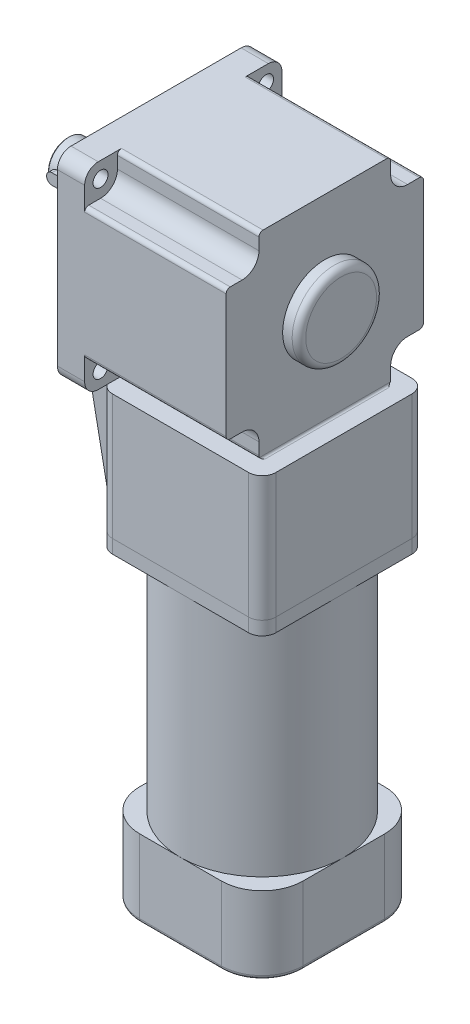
ISO-10303-21;
HEADER;
FILE_DESCRIPTION(('STEP AP214'),'2;1');
FILE_NAME('part.step','',(''),(''),'','','');
FILE_SCHEMA(('AUTOMOTIVE_DESIGN { 1 0 10303 214 1 1 1 1 }'));
ENDSEC;
DATA;
#1=APPLICATION_CONTEXT('core data for automotive mechanical design processes');
#2=APPLICATION_PROTOCOL_DEFINITION('international standard','automotive_design',2000,#1);
#3=PRODUCT_CONTEXT('',#1,'mechanical');
#4=PRODUCT('Part','Part','',(#3));
#5=PRODUCT_RELATED_PRODUCT_CATEGORY('part','',(#4));
#6=PRODUCT_DEFINITION_FORMATION('','',#4);
#7=PRODUCT_DEFINITION_CONTEXT('part definition',#1,'design');
#8=PRODUCT_DEFINITION('design','',#6,#7);
#9=PRODUCT_DEFINITION_SHAPE('','',#8);
#10=(LENGTH_UNIT() NAMED_UNIT(*) SI_UNIT(.MILLI.,.METRE.));
#11=(NAMED_UNIT(*) PLANE_ANGLE_UNIT() SI_UNIT($,.RADIAN.));
#12=(NAMED_UNIT(*) SI_UNIT($,.STERADIAN.) SOLID_ANGLE_UNIT());
#13=UNCERTAINTY_MEASURE_WITH_UNIT(LENGTH_MEASURE(1.E-05),#10,'distance_accuracy_value','');
#14=(GEOMETRIC_REPRESENTATION_CONTEXT(3) GLOBAL_UNCERTAINTY_ASSIGNED_CONTEXT((#13)) GLOBAL_UNIT_ASSIGNED_CONTEXT((#10,
#11,#12)) REPRESENTATION_CONTEXT('',''));
#15=CARTESIAN_POINT('',(0.,0.,0.));
#16=DIRECTION('',(0.,0.,1.));
#17=DIRECTION('',(1.,0.,0.));
#18=AXIS2_PLACEMENT_3D('',#15,#16,#17);
#19=CARTESIAN_POINT('',(78.,-342.5,0.));
#20=DIRECTION('',(0.,1.,0.));
#21=DIRECTION('',(0.,0.,1.));
#22=AXIS2_PLACEMENT_3D('',#19,#20,#21);
#23=CYLINDRICAL_SURFACE('',#22,60.);
#24=CARTESIAN_POINT('',(78.,-342.5,0.));
#25=DIRECTION('',(0.,-1.,0.));
#26=DIRECTION('',(0.,0.,-1.));
#27=AXIS2_PLACEMENT_3D('',#24,#25,#26);
#28=CIRCLE('',#27,60.);
#29=CARTESIAN_POINT('',(78.,-342.5,-60.));
#30=VERTEX_POINT('',#29);
#31=CARTESIAN_POINT('',(138.,-342.5,0.));
#32=VERTEX_POINT('',#31);
#33=EDGE_CURVE('E208',#30,#32,#28,.T.);
#34=ORIENTED_EDGE('',*,*,#33,.F.);
#35=CARTESIAN_POINT('',(18.,-342.5,0.));
#36=VERTEX_POINT('',#35);
#37=EDGE_CURVE('E212',#36,#30,#28,.T.);
#38=ORIENTED_EDGE('',*,*,#37,.F.);
#39=CARTESIAN_POINT('',(78.,-342.5,60.));
#40=VERTEX_POINT('',#39);
#41=EDGE_CURVE('E325',#40,#36,#28,.T.);
#42=ORIENTED_EDGE('',*,*,#41,.F.);
#43=EDGE_CURVE('E163',#32,#40,#28,.T.);
#44=ORIENTED_EDGE('',*,*,#43,.F.);
#45=EDGE_LOOP('',(#34,#38,#42,#44));
#46=FACE_BOUND('',#45,.T.);
#47=CARTESIAN_POINT('',(78.,-174.5,0.));
#48=DIRECTION('',(0.,-1.,0.));
#49=DIRECTION('',(0.,0.,-1.));
#50=AXIS2_PLACEMENT_3D('',#47,#48,#49);
#51=CIRCLE('',#50,60.);
#52=CARTESIAN_POINT('',(78.,-174.5,-60.));
#53=VERTEX_POINT('',#52);
#54=EDGE_CURVE('E154',#53,#53,#51,.T.);
#55=ORIENTED_EDGE('',*,*,#54,.T.);
#56=EDGE_LOOP('',(#55));
#57=FACE_BOUND('',#56,.T.);
#58=ADVANCED_FACE('F46',(#46,#57),#23,.T.);
#59=CARTESIAN_POINT('',(78.,-174.5,0.));
#60=DIRECTION('',(0.,-1.,0.));
#61=DIRECTION('',(0.,0.,-1.));
#62=AXIS2_PLACEMENT_3D('',#59,#60,#61);
#63=PLANE('',#62);
#64=ORIENTED_EDGE('',*,*,#54,.F.);
#65=EDGE_LOOP('',(#64));
#66=FACE_BOUND('',#65,.T.);
#67=ADVANCED_FACE('F343',(#66),#63,.F.);
#68=CARTESIAN_POINT('',(108.,-342.5,30.));
#69=DIRECTION('',(0.,1.,0.));
#70=DIRECTION('',(0.,0.,1.));
#71=AXIS2_PLACEMENT_3D('',#68,#69,#70);
#72=PLANE('',#71);
#73=DIRECTION('',(1.,0.,0.));
#74=VECTOR('',#73,1.);
#75=CARTESIAN_POINT('',(48.0000000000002,-342.5,-60.));
#76=LINE('',#75,#74);
#77=CARTESIAN_POINT('',(108.,-342.5,-60.));
#78=VERTEX_POINT('',#77);
#79=EDGE_CURVE('E185',#30,#78,#76,.T.);
#80=ORIENTED_EDGE('',*,*,#79,.F.);
#81=ORIENTED_EDGE('',*,*,#33,.T.);
#82=DIRECTION('',(0.,0.,1.));
#83=VECTOR('',#82,1.);
#84=CARTESIAN_POINT('',(138.,-342.5,-29.9999999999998));
#85=LINE('',#84,#83);
#86=CARTESIAN_POINT('',(138.,-342.5,-29.9999999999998));
#87=VERTEX_POINT('',#86);
#88=EDGE_CURVE('E193',#87,#32,#85,.T.);
#89=ORIENTED_EDGE('',*,*,#88,.F.);
#90=CARTESIAN_POINT('',(108.,-342.5,-30.));
#91=DIRECTION('',(0.,-1.,0.));
#92=DIRECTION('',(0.,0.,-1.));
#93=AXIS2_PLACEMENT_3D('',#90,#91,#92);
#94=CIRCLE('',#93,30.);
#95=EDGE_CURVE('E189',#78,#87,#94,.T.);
#96=ORIENTED_EDGE('',*,*,#95,.F.);
#97=EDGE_LOOP('',(#80,#81,#89,#96));
#98=FACE_BOUND('',#97,.T.);
#99=ADVANCED_FACE('F327',(#98),#72,.T.);
#100=CARTESIAN_POINT('',(138.,-342.5,29.9999999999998));
#101=VERTEX_POINT('',#100);
#102=EDGE_CURVE('E192',#32,#101,#85,.T.);
#103=ORIENTED_EDGE('',*,*,#102,.F.);
#104=ORIENTED_EDGE('',*,*,#43,.T.);
#105=DIRECTION('',(-1.,0.,0.));
#106=VECTOR('',#105,1.);
#107=CARTESIAN_POINT('',(48.0000000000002,-342.5,60.));
#108=LINE('',#107,#106);
#109=CARTESIAN_POINT('',(108.,-342.5,60.));
#110=VERTEX_POINT('',#109);
#111=EDGE_CURVE('E150',#110,#40,#108,.T.);
#112=ORIENTED_EDGE('',*,*,#111,.F.);
#113=CARTESIAN_POINT('',(108.,-342.5,30.));
#114=DIRECTION('',(0.,-1.,0.));
#115=DIRECTION('',(0.,0.,1.));
#116=AXIS2_PLACEMENT_3D('',#113,#114,#115);
#117=CIRCLE('',#116,30.);
#118=EDGE_CURVE('E162',#101,#110,#117,.T.);
#119=ORIENTED_EDGE('',*,*,#118,.F.);
#120=EDGE_LOOP('',(#103,#104,#112,#119));
#121=FACE_BOUND('',#120,.T.);
#122=ADVANCED_FACE('F161',(#121),#72,.T.);
#123=CARTESIAN_POINT('',(48.0000000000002,-342.5,60.));
#124=VERTEX_POINT('',#123);
#125=EDGE_CURVE('E166',#40,#124,#108,.T.);
#126=ORIENTED_EDGE('',*,*,#125,.F.);
#127=ORIENTED_EDGE('',*,*,#41,.T.);
#128=DIRECTION('',(0.,0.,-1.));
#129=VECTOR('',#128,1.);
#130=CARTESIAN_POINT('',(18.,-342.5,-29.9999999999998));
#131=LINE('',#130,#129);
#132=CARTESIAN_POINT('',(18.,-342.5,29.9999999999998));
#133=VERTEX_POINT('',#132);
#134=EDGE_CURVE('E179',#133,#36,#131,.T.);
#135=ORIENTED_EDGE('',*,*,#134,.F.);
#136=CARTESIAN_POINT('',(48.,-342.5,30.));
#137=DIRECTION('',(0.,-1.,0.));
#138=DIRECTION('',(0.,0.,1.));
#139=AXIS2_PLACEMENT_3D('',#136,#137,#138);
#140=CIRCLE('',#139,30.);
#141=EDGE_CURVE('E165',#124,#133,#140,.T.);
#142=ORIENTED_EDGE('',*,*,#141,.F.);
#143=EDGE_LOOP('',(#126,#127,#135,#142));
#144=FACE_BOUND('',#143,.T.);
#145=ADVANCED_FACE('F331',(#144),#72,.T.);
#146=CARTESIAN_POINT('',(108.,-399.5,30.));
#147=DIRECTION('',(0.,1.,0.));
#148=DIRECTION('',(0.,0.,1.));
#149=AXIS2_PLACEMENT_3D('',#146,#147,#148);
#150=CYLINDRICAL_SURFACE('',#149,30.);
#151=DIRECTION('',(0.,1.,0.));
#152=VECTOR('',#151,1.);
#153=CARTESIAN_POINT('',(108.,-399.5,60.));
#154=LINE('',#153,#152);
#155=CARTESIAN_POINT('',(108.,-396.5,60.));
#156=VERTEX_POINT('',#155);
#157=EDGE_CURVE('E146',#156,#110,#154,.T.);
#158=ORIENTED_EDGE('',*,*,#157,.F.);
#159=CARTESIAN_POINT('',(108.,-396.5,30.));
#160=DIRECTION('',(0.,1.,0.));
#161=DIRECTION('',(0.,0.,1.));
#162=AXIS2_PLACEMENT_3D('',#159,#160,#161);
#163=CIRCLE('',#162,30.);
#164=CARTESIAN_POINT('',(138.,-396.5,29.9999999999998));
#165=VERTEX_POINT('',#164);
#166=EDGE_CURVE('E12',#156,#165,#163,.T.);
#167=ORIENTED_EDGE('',*,*,#166,.T.);
#168=DIRECTION('',(0.,1.,0.));
#169=VECTOR('',#168,1.);
#170=CARTESIAN_POINT('',(138.,-399.5,29.9999999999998));
#171=LINE('',#170,#169);
#172=EDGE_CURVE('E170',#165,#101,#171,.T.);
#173=ORIENTED_EDGE('',*,*,#172,.T.);
#174=ORIENTED_EDGE('',*,*,#118,.T.);
#175=EDGE_LOOP('',(#158,#167,#173,#174));
#176=FACE_BOUND('',#175,.T.);
#177=ADVANCED_FACE('F168',(#176),#150,.T.);
#178=CARTESIAN_POINT('',(48.0000000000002,-399.5,60.));
#179=DIRECTION('',(0.,0.,-1.));
#180=DIRECTION('',(-1.,0.,0.));
#181=AXIS2_PLACEMENT_3D('',#178,#179,#180);
#182=PLANE('',#181);
#183=DIRECTION('',(0.,1.,0.));
#184=VECTOR('',#183,1.);
#185=CARTESIAN_POINT('',(48.0000000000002,-399.5,60.));
#186=LINE('',#185,#184);
#187=CARTESIAN_POINT('',(48.0000000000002,-396.5,60.));
#188=VERTEX_POINT('',#187);
#189=EDGE_CURVE('E155',#188,#124,#186,.T.);
#190=ORIENTED_EDGE('',*,*,#189,.F.);
#191=DIRECTION('',(-1.,0.,0.));
#192=VECTOR('',#191,1.);
#193=CARTESIAN_POINT('',(48.0000000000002,-396.5,60.));
#194=LINE('',#193,#192);
#195=EDGE_CURVE('E55',#188,#156,#194,.F.);
#196=ORIENTED_EDGE('',*,*,#195,.T.);
#197=ORIENTED_EDGE('',*,*,#157,.T.);
#198=ORIENTED_EDGE('',*,*,#111,.T.);
#199=ORIENTED_EDGE('',*,*,#125,.T.);
#200=EDGE_LOOP('',(#190,#196,#197,#198,#199));
#201=FACE_BOUND('',#200,.T.);
#202=ADVANCED_FACE('F148',(#201),#182,.F.);
#203=CARTESIAN_POINT('',(48.,-399.5,30.));
#204=DIRECTION('',(0.,1.,0.));
#205=DIRECTION('',(0.,0.,1.));
#206=AXIS2_PLACEMENT_3D('',#203,#204,#205);
#207=CYLINDRICAL_SURFACE('',#206,30.);
#208=DIRECTION('',(0.,1.,0.));
#209=VECTOR('',#208,1.);
#210=CARTESIAN_POINT('',(18.,-399.5,29.9999999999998));
#211=LINE('',#210,#209);
#212=CARTESIAN_POINT('',(18.,-396.5,29.9999999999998));
#213=VERTEX_POINT('',#212);
#214=EDGE_CURVE('E205',#213,#133,#211,.T.);
#215=ORIENTED_EDGE('',*,*,#214,.F.);
#216=CARTESIAN_POINT('',(48.,-396.5,30.));
#217=DIRECTION('',(0.,1.,0.));
#218=DIRECTION('',(0.,0.,1.));
#219=AXIS2_PLACEMENT_3D('',#216,#217,#218);
#220=CIRCLE('',#219,30.);
#221=EDGE_CURVE('E70',#213,#188,#220,.T.);
#222=ORIENTED_EDGE('',*,*,#221,.T.);
#223=ORIENTED_EDGE('',*,*,#189,.T.);
#224=ORIENTED_EDGE('',*,*,#141,.T.);
#225=EDGE_LOOP('',(#215,#222,#223,#224));
#226=FACE_BOUND('',#225,.T.);
#227=ADVANCED_FACE('F333',(#226),#207,.T.);
#228=CARTESIAN_POINT('',(18.,-399.5,-29.9999999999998));
#229=DIRECTION('',(1.,0.,0.));
#230=DIRECTION('',(0.,0.,-1.));
#231=AXIS2_PLACEMENT_3D('',#228,#229,#230);
#232=PLANE('',#231);
#233=DIRECTION('',(0.,1.,0.));
#234=VECTOR('',#233,1.);
#235=CARTESIAN_POINT('',(18.,-399.5,-29.9999999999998));
#236=LINE('',#235,#234);
#237=CARTESIAN_POINT('',(18.,-396.5,-29.9999999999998));
#238=VERTEX_POINT('',#237);
#239=CARTESIAN_POINT('',(18.,-342.5,-29.9999999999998));
#240=VERTEX_POINT('',#239);
#241=EDGE_CURVE('E203',#238,#240,#236,.T.);
#242=ORIENTED_EDGE('',*,*,#241,.F.);
#243=DIRECTION('',(0.,0.,-1.));
#244=VECTOR('',#243,1.);
#245=CARTESIAN_POINT('',(18.,-396.5,-29.9999999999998));
#246=LINE('',#245,#244);
#247=EDGE_CURVE('E240',#238,#213,#246,.F.);
#248=ORIENTED_EDGE('',*,*,#247,.T.);
#249=ORIENTED_EDGE('',*,*,#214,.T.);
#250=ORIENTED_EDGE('',*,*,#134,.T.);
#251=EDGE_CURVE('E178',#36,#240,#131,.T.);
#252=ORIENTED_EDGE('',*,*,#251,.T.);
#253=EDGE_LOOP('',(#242,#248,#249,#250,#252));
#254=FACE_BOUND('',#253,.T.);
#255=ADVANCED_FACE('F315',(#254),#232,.F.);
#256=CARTESIAN_POINT('',(48.,-399.5,-30.));
#257=DIRECTION('',(0.,1.,0.));
#258=DIRECTION('',(0.,0.,1.));
#259=AXIS2_PLACEMENT_3D('',#256,#257,#258);
#260=CYLINDRICAL_SURFACE('',#259,30.);
#261=DIRECTION('',(0.,1.,0.));
#262=VECTOR('',#261,1.);
#263=CARTESIAN_POINT('',(48.0000000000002,-399.5,-60.));
#264=LINE('',#263,#262);
#265=CARTESIAN_POINT('',(48.0000000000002,-396.5,-60.));
#266=VERTEX_POINT('',#265);
#267=CARTESIAN_POINT('',(48.0000000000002,-342.5,-60.));
#268=VERTEX_POINT('',#267);
#269=EDGE_CURVE('E201',#266,#268,#264,.T.);
#270=ORIENTED_EDGE('',*,*,#269,.F.);
#271=CARTESIAN_POINT('',(48.,-396.5,-30.));
#272=DIRECTION('',(0.,1.,0.));
#273=DIRECTION('',(0.,0.,1.));
#274=AXIS2_PLACEMENT_3D('',#271,#272,#273);
#275=CIRCLE('',#274,30.);
#276=EDGE_CURVE('E238',#266,#238,#275,.T.);
#277=ORIENTED_EDGE('',*,*,#276,.T.);
#278=ORIENTED_EDGE('',*,*,#241,.T.);
#279=CARTESIAN_POINT('',(48.,-342.5,-30.));
#280=DIRECTION('',(0.,-1.,0.));
#281=DIRECTION('',(0.,0.,1.));
#282=AXIS2_PLACEMENT_3D('',#279,#280,#281);
#283=CIRCLE('',#282,30.);
#284=EDGE_CURVE('E182',#240,#268,#283,.T.);
#285=ORIENTED_EDGE('',*,*,#284,.T.);
#286=EDGE_LOOP('',(#270,#277,#278,#285));
#287=FACE_BOUND('',#286,.T.);
#288=ADVANCED_FACE('F312',(#287),#260,.T.);
#289=CARTESIAN_POINT('',(48.0000000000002,-399.5,-60.));
#290=DIRECTION('',(0.,0.,1.));
#291=DIRECTION('',(1.,0.,0.));
#292=AXIS2_PLACEMENT_3D('',#289,#290,#291);
#293=PLANE('',#292);
#294=DIRECTION('',(0.,1.,0.));
#295=VECTOR('',#294,1.);
#296=CARTESIAN_POINT('',(108.,-399.5,-60.));
#297=LINE('',#296,#295);
#298=CARTESIAN_POINT('',(108.,-396.5,-60.));
#299=VERTEX_POINT('',#298);
#300=EDGE_CURVE('E199',#299,#78,#297,.T.);
#301=ORIENTED_EDGE('',*,*,#300,.F.);
#302=DIRECTION('',(1.,0.,0.));
#303=VECTOR('',#302,1.);
#304=CARTESIAN_POINT('',(48.0000000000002,-396.5,-60.));
#305=LINE('',#304,#303);
#306=EDGE_CURVE('E236',#299,#266,#305,.F.);
#307=ORIENTED_EDGE('',*,*,#306,.T.);
#308=ORIENTED_EDGE('',*,*,#269,.T.);
#309=EDGE_CURVE('E186',#268,#30,#76,.T.);
#310=ORIENTED_EDGE('',*,*,#309,.T.);
#311=ORIENTED_EDGE('',*,*,#79,.T.);
#312=EDGE_LOOP('',(#301,#307,#308,#310,#311));
#313=FACE_BOUND('',#312,.T.);
#314=ADVANCED_FACE('F300',(#313),#293,.F.);
#315=CARTESIAN_POINT('',(108.,-399.5,-30.));
#316=DIRECTION('',(0.,1.,0.));
#317=DIRECTION('',(0.,0.,1.));
#318=AXIS2_PLACEMENT_3D('',#315,#316,#317);
#319=CYLINDRICAL_SURFACE('',#318,30.);
#320=DIRECTION('',(0.,1.,0.));
#321=VECTOR('',#320,1.);
#322=CARTESIAN_POINT('',(138.,-399.5,-29.9999999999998));
#323=LINE('',#322,#321);
#324=CARTESIAN_POINT('',(138.,-396.5,-29.9999999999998));
#325=VERTEX_POINT('',#324);
#326=EDGE_CURVE('E197',#325,#87,#323,.T.);
#327=ORIENTED_EDGE('',*,*,#326,.F.);
#328=CARTESIAN_POINT('',(108.,-396.5,-30.));
#329=DIRECTION('',(0.,1.,0.));
#330=DIRECTION('',(0.,0.,1.));
#331=AXIS2_PLACEMENT_3D('',#328,#329,#330);
#332=CIRCLE('',#331,30.);
#333=EDGE_CURVE('E234',#325,#299,#332,.T.);
#334=ORIENTED_EDGE('',*,*,#333,.T.);
#335=ORIENTED_EDGE('',*,*,#300,.T.);
#336=ORIENTED_EDGE('',*,*,#95,.T.);
#337=EDGE_LOOP('',(#327,#334,#335,#336));
#338=FACE_BOUND('',#337,.T.);
#339=ADVANCED_FACE('F296',(#338),#319,.T.);
#340=CARTESIAN_POINT('',(138.,-399.5,-29.9999999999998));
#341=DIRECTION('',(-1.,0.,0.));
#342=DIRECTION('',(0.,0.,1.));
#343=AXIS2_PLACEMENT_3D('',#340,#341,#342);
#344=PLANE('',#343);
#345=ORIENTED_EDGE('',*,*,#172,.F.);
#346=DIRECTION('',(0.,0.,1.));
#347=VECTOR('',#346,1.);
#348=CARTESIAN_POINT('',(138.,-396.5,-29.9999999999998));
#349=LINE('',#348,#347);
#350=EDGE_CURVE('E231',#165,#325,#349,.F.);
#351=ORIENTED_EDGE('',*,*,#350,.T.);
#352=ORIENTED_EDGE('',*,*,#326,.T.);
#353=ORIENTED_EDGE('',*,*,#88,.T.);
#354=ORIENTED_EDGE('',*,*,#102,.T.);
#355=EDGE_LOOP('',(#345,#351,#352,#353,#354));
#356=FACE_BOUND('',#355,.T.);
#357=ADVANCED_FACE('F283',(#356),#344,.F.);
#358=CARTESIAN_POINT('',(108.,-399.5,30.));
#359=DIRECTION('',(0.,1.,0.));
#360=DIRECTION('',(0.,0.,1.));
#361=AXIS2_PLACEMENT_3D('',#358,#359,#360);
#362=PLANE('',#361);
#363=CARTESIAN_POINT('',(108.,-399.5,-30.));
#364=DIRECTION('',(0.,1.,0.));
#365=DIRECTION('',(0.,0.,1.));
#366=AXIS2_PLACEMENT_3D('',#363,#364,#365);
#367=CIRCLE('',#366,27.);
#368=CARTESIAN_POINT('',(108.,-399.5,-57.));
#369=VERTEX_POINT('',#368);
#370=CARTESIAN_POINT('',(135.,-399.5,-29.9999999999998));
#371=VERTEX_POINT('',#370);
#372=EDGE_CURVE('E226',#369,#371,#367,.F.);
#373=ORIENTED_EDGE('',*,*,#372,.T.);
#374=DIRECTION('',(0.,0.,1.));
#375=VECTOR('',#374,1.);
#376=CARTESIAN_POINT('',(135.,-399.5,30.));
#377=LINE('',#376,#375);
#378=CARTESIAN_POINT('',(135.,-399.5,29.9999999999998));
#379=VERTEX_POINT('',#378);
#380=EDGE_CURVE('E228',#371,#379,#377,.T.);
#381=ORIENTED_EDGE('',*,*,#380,.T.);
#382=CARTESIAN_POINT('',(108.,-399.5,30.));
#383=DIRECTION('',(0.,1.,0.));
#384=DIRECTION('',(0.,0.,1.));
#385=AXIS2_PLACEMENT_3D('',#382,#383,#384);
#386=CIRCLE('',#385,27.);
#387=CARTESIAN_POINT('',(108.,-399.5,57.));
#388=VERTEX_POINT('',#387);
#389=EDGE_CURVE('E211',#379,#388,#386,.F.);
#390=ORIENTED_EDGE('',*,*,#389,.T.);
#391=DIRECTION('',(-1.,0.,0.));
#392=VECTOR('',#391,1.);
#393=CARTESIAN_POINT('',(108.,-399.5,57.));
#394=LINE('',#393,#392);
#395=CARTESIAN_POINT('',(48.0000000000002,-399.5,57.));
#396=VERTEX_POINT('',#395);
#397=EDGE_CURVE('E216',#388,#396,#394,.T.);
#398=ORIENTED_EDGE('',*,*,#397,.T.);
#399=CARTESIAN_POINT('',(48.,-399.5,30.));
#400=DIRECTION('',(0.,1.,0.));
#401=DIRECTION('',(0.,0.,1.));
#402=AXIS2_PLACEMENT_3D('',#399,#400,#401);
#403=CIRCLE('',#402,27.);
#404=CARTESIAN_POINT('',(21.,-399.5,29.9999999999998));
#405=VERTEX_POINT('',#404);
#406=EDGE_CURVE('E218',#396,#405,#403,.F.);
#407=ORIENTED_EDGE('',*,*,#406,.T.);
#408=DIRECTION('',(0.,0.,-1.));
#409=VECTOR('',#408,1.);
#410=CARTESIAN_POINT('',(21.,-399.5,30.));
#411=LINE('',#410,#409);
#412=CARTESIAN_POINT('',(21.,-399.5,-29.9999999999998));
#413=VERTEX_POINT('',#412);
#414=EDGE_CURVE('E220',#405,#413,#411,.T.);
#415=ORIENTED_EDGE('',*,*,#414,.T.);
#416=CARTESIAN_POINT('',(48.,-399.5,-30.));
#417=DIRECTION('',(0.,1.,0.));
#418=DIRECTION('',(0.,0.,1.));
#419=AXIS2_PLACEMENT_3D('',#416,#417,#418);
#420=CIRCLE('',#419,27.);
#421=CARTESIAN_POINT('',(48.0000000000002,-399.5,-57.));
#422=VERTEX_POINT('',#421);
#423=EDGE_CURVE('E222',#413,#422,#420,.F.);
#424=ORIENTED_EDGE('',*,*,#423,.T.);
#425=DIRECTION('',(1.,0.,0.));
#426=VECTOR('',#425,1.);
#427=CARTESIAN_POINT('',(108.,-399.5,-57.));
#428=LINE('',#427,#426);
#429=EDGE_CURVE('E224',#422,#369,#428,.T.);
#430=ORIENTED_EDGE('',*,*,#429,.T.);
#431=EDGE_LOOP('',(#373,#381,#390,#398,#407,#415,#424,#430));
#432=FACE_BOUND('',#431,.T.);
#433=ADVANCED_FACE('F271',(#432),#362,.F.);
#434=ORIENTED_EDGE('',*,*,#251,.F.);
#435=ORIENTED_EDGE('',*,*,#37,.T.);
#436=ORIENTED_EDGE('',*,*,#309,.F.);
#437=ORIENTED_EDGE('',*,*,#284,.F.);
#438=EDGE_LOOP('',(#434,#435,#436,#437));
#439=FACE_BOUND('',#438,.T.);
#440=ADVANCED_FACE('F322',(#439),#72,.T.);
#441=CARTESIAN_POINT('',(21.,-396.5,30.));
#442=DIRECTION('',(0.,0.,-1.));
#443=DIRECTION('',(-1.,0.,0.));
#444=AXIS2_PLACEMENT_3D('',#441,#442,#443);
#445=CYLINDRICAL_SURFACE('',#444,3.);
#446=CARTESIAN_POINT('',(21.,-396.5,29.9999999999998));
#447=DIRECTION('',(0.,0.,1.));
#448=DIRECTION('',(1.,0.,0.));
#449=AXIS2_PLACEMENT_3D('',#446,#447,#448);
#450=CIRCLE('',#449,3.);
#451=EDGE_CURVE('E174',#213,#405,#450,.T.);
#452=ORIENTED_EDGE('',*,*,#451,.F.);
#453=ORIENTED_EDGE('',*,*,#247,.F.);
#454=CARTESIAN_POINT('',(21.,-396.5,-29.9999999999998));
#455=DIRECTION('',(0.,0.,-1.));
#456=DIRECTION('',(-1.,0.,0.));
#457=AXIS2_PLACEMENT_3D('',#454,#455,#456);
#458=CIRCLE('',#457,3.);
#459=EDGE_CURVE('E50',#413,#238,#458,.T.);
#460=ORIENTED_EDGE('',*,*,#459,.F.);
#461=ORIENTED_EDGE('',*,*,#414,.F.);
#462=EDGE_LOOP('',(#452,#453,#460,#461));
#463=FACE_BOUND('',#462,.T.);
#464=ADVANCED_FACE('F48',(#463),#445,.T.);
#465=CARTESIAN_POINT('',(48.,-396.5,-30.));
#466=DIRECTION('',(0.,1.,0.));
#467=DIRECTION('',(0.,0.,1.));
#468=AXIS2_PLACEMENT_3D('',#465,#466,#467);
#469=TOROIDAL_SURFACE('',#468,27.,3.);
#470=ORIENTED_EDGE('',*,*,#459,.T.);
#471=ORIENTED_EDGE('',*,*,#276,.F.);
#472=CARTESIAN_POINT('',(48.0000000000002,-396.5,-57.));
#473=DIRECTION('',(1.,0.,0.));
#474=DIRECTION('',(0.,0.,-1.));
#475=AXIS2_PLACEMENT_3D('',#472,#473,#474);
#476=CIRCLE('',#475,3.);
#477=EDGE_CURVE('E257',#422,#266,#476,.T.);
#478=ORIENTED_EDGE('',*,*,#477,.F.);
#479=ORIENTED_EDGE('',*,*,#423,.F.);
#480=EDGE_LOOP('',(#470,#471,#478,#479));
#481=FACE_BOUND('',#480,.T.);
#482=ADVANCED_FACE('F309',(#481),#469,.T.);
#483=CARTESIAN_POINT('',(48.,-396.5,30.));
#484=DIRECTION('',(0.,1.,0.));
#485=DIRECTION('',(0.,0.,1.));
#486=AXIS2_PLACEMENT_3D('',#483,#484,#485);
#487=TOROIDAL_SURFACE('',#486,27.,3.);
#488=ORIENTED_EDGE('',*,*,#451,.T.);
#489=ORIENTED_EDGE('',*,*,#406,.F.);
#490=CARTESIAN_POINT('',(48.0000000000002,-396.5,57.));
#491=DIRECTION('',(1.,0.,0.));
#492=DIRECTION('',(0.,0.,-1.));
#493=AXIS2_PLACEMENT_3D('',#490,#491,#492);
#494=CIRCLE('',#493,3.);
#495=EDGE_CURVE('E254',#188,#396,#494,.T.);
#496=ORIENTED_EDGE('',*,*,#495,.F.);
#497=ORIENTED_EDGE('',*,*,#221,.F.);
#498=EDGE_LOOP('',(#488,#489,#496,#497));
#499=FACE_BOUND('',#498,.T.);
#500=ADVANCED_FACE('F263',(#499),#487,.T.);
#501=CARTESIAN_POINT('',(108.,-396.5,-57.));
#502=DIRECTION('',(1.,0.,0.));
#503=DIRECTION('',(0.,0.,-1.));
#504=AXIS2_PLACEMENT_3D('',#501,#502,#503);
#505=CYLINDRICAL_SURFACE('',#504,3.);
#506=ORIENTED_EDGE('',*,*,#477,.T.);
#507=ORIENTED_EDGE('',*,*,#306,.F.);
#508=CARTESIAN_POINT('',(108.,-396.5,-57.));
#509=DIRECTION('',(1.,0.,0.));
#510=DIRECTION('',(0.,0.,-1.));
#511=AXIS2_PLACEMENT_3D('',#508,#509,#510);
#512=CIRCLE('',#511,3.);
#513=EDGE_CURVE('E251',#369,#299,#512,.T.);
#514=ORIENTED_EDGE('',*,*,#513,.F.);
#515=ORIENTED_EDGE('',*,*,#429,.F.);
#516=EDGE_LOOP('',(#506,#507,#514,#515));
#517=FACE_BOUND('',#516,.T.);
#518=ADVANCED_FACE('F305',(#517),#505,.T.);
#519=CARTESIAN_POINT('',(108.,-396.5,57.));
#520=DIRECTION('',(-1.,0.,0.));
#521=DIRECTION('',(0.,0.,1.));
#522=AXIS2_PLACEMENT_3D('',#519,#520,#521);
#523=CYLINDRICAL_SURFACE('',#522,3.);
#524=ORIENTED_EDGE('',*,*,#495,.T.);
#525=ORIENTED_EDGE('',*,*,#397,.F.);
#526=CARTESIAN_POINT('',(108.,-396.5,57.));
#527=DIRECTION('',(1.,0.,0.));
#528=DIRECTION('',(0.,0.,-1.));
#529=AXIS2_PLACEMENT_3D('',#526,#527,#528);
#530=CIRCLE('',#529,3.);
#531=EDGE_CURVE('E248',#156,#388,#530,.T.);
#532=ORIENTED_EDGE('',*,*,#531,.F.);
#533=ORIENTED_EDGE('',*,*,#195,.F.);
#534=EDGE_LOOP('',(#524,#525,#532,#533));
#535=FACE_BOUND('',#534,.T.);
#536=ADVANCED_FACE('F276',(#535),#523,.T.);
#537=CARTESIAN_POINT('',(108.,-396.5,-30.));
#538=DIRECTION('',(0.,1.,0.));
#539=DIRECTION('',(0.,0.,1.));
#540=AXIS2_PLACEMENT_3D('',#537,#538,#539);
#541=TOROIDAL_SURFACE('',#540,27.,3.);
#542=ORIENTED_EDGE('',*,*,#513,.T.);
#543=ORIENTED_EDGE('',*,*,#333,.F.);
#544=CARTESIAN_POINT('',(135.,-396.5,-29.9999999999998));
#545=DIRECTION('',(0.,0.,1.));
#546=DIRECTION('',(1.,0.,0.));
#547=AXIS2_PLACEMENT_3D('',#544,#545,#546);
#548=CIRCLE('',#547,3.);
#549=EDGE_CURVE('E246',#371,#325,#548,.T.);
#550=ORIENTED_EDGE('',*,*,#549,.F.);
#551=ORIENTED_EDGE('',*,*,#372,.F.);
#552=EDGE_LOOP('',(#542,#543,#550,#551));
#553=FACE_BOUND('',#552,.T.);
#554=ADVANCED_FACE('F292',(#553),#541,.T.);
#555=CARTESIAN_POINT('',(108.,-396.5,30.));
#556=DIRECTION('',(0.,1.,0.));
#557=DIRECTION('',(0.,0.,1.));
#558=AXIS2_PLACEMENT_3D('',#555,#556,#557);
#559=TOROIDAL_SURFACE('',#558,27.,3.);
#560=ORIENTED_EDGE('',*,*,#531,.T.);
#561=ORIENTED_EDGE('',*,*,#389,.F.);
#562=CARTESIAN_POINT('',(135.,-396.5,29.9999999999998));
#563=DIRECTION('',(0.,0.,-1.));
#564=DIRECTION('',(-1.,0.,0.));
#565=AXIS2_PLACEMENT_3D('',#562,#563,#564);
#566=CIRCLE('',#565,3.);
#567=EDGE_CURVE('E244',#165,#379,#566,.T.);
#568=ORIENTED_EDGE('',*,*,#567,.F.);
#569=ORIENTED_EDGE('',*,*,#166,.F.);
#570=EDGE_LOOP('',(#560,#561,#568,#569));
#571=FACE_BOUND('',#570,.T.);
#572=ADVANCED_FACE('F279',(#571),#559,.T.);
#573=CARTESIAN_POINT('',(135.,-396.5,30.));
#574=DIRECTION('',(0.,0.,1.));
#575=DIRECTION('',(1.,0.,0.));
#576=AXIS2_PLACEMENT_3D('',#573,#574,#575);
#577=CYLINDRICAL_SURFACE('',#576,3.);
#578=ORIENTED_EDGE('',*,*,#549,.T.);
#579=ORIENTED_EDGE('',*,*,#350,.F.);
#580=ORIENTED_EDGE('',*,*,#567,.T.);
#581=ORIENTED_EDGE('',*,*,#380,.F.);
#582=EDGE_LOOP('',(#578,#579,#580,#581));
#583=FACE_BOUND('',#582,.T.);
#584=ADVANCED_FACE('F286',(#583),#577,.T.);
#585=CLOSED_SHELL('',(#58,#67,#99,#122,#145,#177,#202,#227,#255,#288,#314,#339,#357,#433,#440,
#464,#482,#500,#518,#536,#554,#572,#584));
#586=MANIFOLD_SOLID_BREP('B2',#585);
#587=CARTESIAN_POINT('',(128.,-174.5,-50.));
#588=DIRECTION('',(0.,1.,0.));
#589=DIRECTION('',(0.,0.,1.));
#590=AXIS2_PLACEMENT_3D('',#587,#588,#589);
#591=CYLINDRICAL_SURFACE('',#590,10.);
#592=CARTESIAN_POINT('',(128.,-164.5,-50.));
#593=DIRECTION('',(0.,-1.,0.));
#594=DIRECTION('',(0.,0.,-1.));
#595=AXIS2_PLACEMENT_3D('',#592,#593,#594);
#596=CIRCLE('',#595,10.);
#597=CARTESIAN_POINT('',(128.,-164.5,-60.));
#598=VERTEX_POINT('',#597);
#599=CARTESIAN_POINT('',(138.,-164.5,-50.));
#600=VERTEX_POINT('',#599);
#601=EDGE_CURVE('E625',#598,#600,#596,.T.);
#602=ORIENTED_EDGE('',*,*,#601,.T.);
#603=DIRECTION('',(0.,1.,0.));
#604=VECTOR('',#603,1.);
#605=CARTESIAN_POINT('',(138.,-174.5,-50.));
#606=LINE('',#605,#604);
#607=CARTESIAN_POINT('',(138.,-174.5,-50.));
#608=VERTEX_POINT('',#607);
#609=EDGE_CURVE('E44',#608,#600,#606,.T.);
#610=ORIENTED_EDGE('',*,*,#609,.F.);
#611=CARTESIAN_POINT('',(128.,-174.5,-50.));
#612=DIRECTION('',(0.,-1.,0.));
#613=DIRECTION('',(0.,0.,-1.));
#614=AXIS2_PLACEMENT_3D('',#611,#612,#613);
#615=CIRCLE('',#614,10.);
#616=CARTESIAN_POINT('',(128.,-174.5,-60.));
#617=VERTEX_POINT('',#616);
#618=EDGE_CURVE('E639',#617,#608,#615,.T.);
#619=ORIENTED_EDGE('',*,*,#618,.F.);
#620=DIRECTION('',(0.,1.,0.));
#621=VECTOR('',#620,1.);
#622=CARTESIAN_POINT('',(128.,-174.5,-60.));
#623=LINE('',#622,#621);
#624=EDGE_CURVE('E621',#617,#598,#623,.T.);
#625=ORIENTED_EDGE('',*,*,#624,.T.);
#626=EDGE_LOOP('',(#602,#610,#619,#625));
#627=FACE_BOUND('',#626,.T.);
#628=ADVANCED_FACE('F529',(#627),#591,.T.);
#629=CARTESIAN_POINT('',(138.,-174.5,-50.));
#630=DIRECTION('',(-1.,0.,0.));
#631=DIRECTION('',(0.,0.,1.));
#632=AXIS2_PLACEMENT_3D('',#629,#630,#631);
#633=PLANE('',#632);
#634=DIRECTION('',(0.,0.,1.));
#635=VECTOR('',#634,1.);
#636=CARTESIAN_POINT('',(138.,-164.5,-50.));
#637=LINE('',#636,#635);
#638=CARTESIAN_POINT('',(138.,-164.5,49.9999999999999));
#639=VERTEX_POINT('',#638);
#640=EDGE_CURVE('E628',#600,#639,#637,.T.);
#641=ORIENTED_EDGE('',*,*,#640,.T.);
#642=DIRECTION('',(0.,1.,0.));
#643=VECTOR('',#642,1.);
#644=CARTESIAN_POINT('',(138.,-174.5,49.9999999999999));
#645=LINE('',#644,#643);
#646=CARTESIAN_POINT('',(138.,-174.5,49.9999999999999));
#647=VERTEX_POINT('',#646);
#648=EDGE_CURVE('E537',#647,#639,#645,.T.);
#649=ORIENTED_EDGE('',*,*,#648,.F.);
#650=DIRECTION('',(0.,0.,1.));
#651=VECTOR('',#650,1.);
#652=CARTESIAN_POINT('',(138.,-174.5,-50.));
#653=LINE('',#652,#651);
#654=EDGE_CURVE('E588',#608,#647,#653,.T.);
#655=ORIENTED_EDGE('',*,*,#654,.F.);
#656=ORIENTED_EDGE('',*,*,#609,.T.);
#657=EDGE_LOOP('',(#641,#649,#655,#656));
#658=FACE_BOUND('',#657,.T.);
#659=ADVANCED_FACE('F674',(#658),#633,.F.);
#660=CARTESIAN_POINT('',(128.,-174.5,50.));
#661=DIRECTION('',(0.,1.,0.));
#662=DIRECTION('',(0.,0.,1.));
#663=AXIS2_PLACEMENT_3D('',#660,#661,#662);
#664=CYLINDRICAL_SURFACE('',#663,10.);
#665=CARTESIAN_POINT('',(128.,-164.5,50.));
#666=DIRECTION('',(0.,-1.,0.));
#667=DIRECTION('',(0.,0.,1.));
#668=AXIS2_PLACEMENT_3D('',#665,#666,#667);
#669=CIRCLE('',#668,10.);
#670=CARTESIAN_POINT('',(128.,-164.5,60.));
#671=VERTEX_POINT('',#670);
#672=EDGE_CURVE('E630',#639,#671,#669,.T.);
#673=ORIENTED_EDGE('',*,*,#672,.T.);
#674=DIRECTION('',(0.,1.,0.));
#675=VECTOR('',#674,1.);
#676=CARTESIAN_POINT('',(128.,-174.5,60.));
#677=LINE('',#676,#675);
#678=CARTESIAN_POINT('',(128.,-174.5,60.));
#679=VERTEX_POINT('',#678);
#680=EDGE_CURVE('E646',#679,#671,#677,.T.);
#681=ORIENTED_EDGE('',*,*,#680,.F.);
#682=CARTESIAN_POINT('',(128.,-174.5,50.));
#683=DIRECTION('',(0.,-1.,0.));
#684=DIRECTION('',(0.,0.,1.));
#685=AXIS2_PLACEMENT_3D('',#682,#683,#684);
#686=CIRCLE('',#685,10.);
#687=EDGE_CURVE('E654',#647,#679,#686,.T.);
#688=ORIENTED_EDGE('',*,*,#687,.F.);
#689=ORIENTED_EDGE('',*,*,#648,.T.);
#690=EDGE_LOOP('',(#673,#681,#688,#689));
#691=FACE_BOUND('',#690,.T.);
#692=ADVANCED_FACE('F652',(#691),#664,.T.);
#693=CARTESIAN_POINT('',(28.0000000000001,-174.5,60.));
#694=DIRECTION('',(0.,0.,-1.));
#695=DIRECTION('',(-1.,0.,0.));
#696=AXIS2_PLACEMENT_3D('',#693,#694,#695);
#697=PLANE('',#696);
#698=DIRECTION('',(-1.,0.,0.));
#699=VECTOR('',#698,1.);
#700=CARTESIAN_POINT('',(28.0000000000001,-164.5,60.));
#701=LINE('',#700,#699);
#702=CARTESIAN_POINT('',(28.0000000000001,-164.5,60.));
#703=VERTEX_POINT('',#702);
#704=EDGE_CURVE('E632',#671,#703,#701,.T.);
#705=ORIENTED_EDGE('',*,*,#704,.T.);
#706=DIRECTION('',(0.,1.,0.));
#707=VECTOR('',#706,1.);
#708=CARTESIAN_POINT('',(28.0000000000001,-174.5,60.));
#709=LINE('',#708,#707);
#710=CARTESIAN_POINT('',(28.0000000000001,-174.5,60.));
#711=VERTEX_POINT('',#710);
#712=EDGE_CURVE('E643',#711,#703,#709,.T.);
#713=ORIENTED_EDGE('',*,*,#712,.F.);
#714=DIRECTION('',(-1.,0.,0.));
#715=VECTOR('',#714,1.);
#716=CARTESIAN_POINT('',(28.0000000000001,-174.5,60.));
#717=LINE('',#716,#715);
#718=EDGE_CURVE('E666',#679,#711,#717,.T.);
#719=ORIENTED_EDGE('',*,*,#718,.F.);
#720=ORIENTED_EDGE('',*,*,#680,.T.);
#721=EDGE_LOOP('',(#705,#713,#719,#720));
#722=FACE_BOUND('',#721,.T.);
#723=ADVANCED_FACE('F662',(#722),#697,.F.);
#724=CARTESIAN_POINT('',(28.,-174.5,50.));
#725=DIRECTION('',(0.,1.,0.));
#726=DIRECTION('',(0.,0.,1.));
#727=AXIS2_PLACEMENT_3D('',#724,#725,#726);
#728=CYLINDRICAL_SURFACE('',#727,10.);
#729=CARTESIAN_POINT('',(28.,-164.5,50.));
#730=DIRECTION('',(0.,-1.,0.));
#731=DIRECTION('',(0.,0.,1.));
#732=AXIS2_PLACEMENT_3D('',#729,#730,#731);
#733=CIRCLE('',#732,10.);
#734=CARTESIAN_POINT('',(18.,-164.5,49.9999999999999));
#735=VERTEX_POINT('',#734);
#736=EDGE_CURVE('E634',#703,#735,#733,.T.);
#737=ORIENTED_EDGE('',*,*,#736,.T.);
#738=DIRECTION('',(0.,1.,0.));
#739=VECTOR('',#738,1.);
#740=CARTESIAN_POINT('',(18.,-174.5,49.9999999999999));
#741=LINE('',#740,#739);
#742=CARTESIAN_POINT('',(18.,-174.5,49.9999999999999));
#743=VERTEX_POINT('',#742);
#744=EDGE_CURVE('E616',#743,#735,#741,.T.);
#745=ORIENTED_EDGE('',*,*,#744,.F.);
#746=CARTESIAN_POINT('',(28.,-174.5,50.));
#747=DIRECTION('',(0.,-1.,0.));
#748=DIRECTION('',(0.,0.,1.));
#749=AXIS2_PLACEMENT_3D('',#746,#747,#748);
#750=CIRCLE('',#749,10.);
#751=EDGE_CURVE('E607',#711,#743,#750,.T.);
#752=ORIENTED_EDGE('',*,*,#751,.F.);
#753=ORIENTED_EDGE('',*,*,#712,.T.);
#754=EDGE_LOOP('',(#737,#745,#752,#753));
#755=FACE_BOUND('',#754,.T.);
#756=ADVANCED_FACE('F665',(#755),#728,.T.);
#757=CARTESIAN_POINT('',(18.,-174.5,-50.));
#758=DIRECTION('',(1.,0.,0.));
#759=DIRECTION('',(0.,0.,-1.));
#760=AXIS2_PLACEMENT_3D('',#757,#758,#759);
#761=PLANE('',#760);
#762=DIRECTION('',(0.,0.,-1.));
#763=VECTOR('',#762,1.);
#764=CARTESIAN_POINT('',(18.,-164.5,-50.));
#765=LINE('',#764,#763);
#766=CARTESIAN_POINT('',(18.,-164.5,-50.));
#767=VERTEX_POINT('',#766);
#768=EDGE_CURVE('E615',#735,#767,#765,.T.);
#769=ORIENTED_EDGE('',*,*,#768,.T.);
#770=DIRECTION('',(0.,1.,0.));
#771=VECTOR('',#770,1.);
#772=CARTESIAN_POINT('',(18.,-174.5,-50.));
#773=LINE('',#772,#771);
#774=CARTESIAN_POINT('',(18.,-174.5,-50.));
#775=VERTEX_POINT('',#774);
#776=EDGE_CURVE('E612',#775,#767,#773,.T.);
#777=ORIENTED_EDGE('',*,*,#776,.F.);
#778=DIRECTION('',(0.,0.,-1.));
#779=VECTOR('',#778,1.);
#780=CARTESIAN_POINT('',(18.,-174.5,-50.));
#781=LINE('',#780,#779);
#782=EDGE_CURVE('E601',#743,#775,#781,.T.);
#783=ORIENTED_EDGE('',*,*,#782,.F.);
#784=ORIENTED_EDGE('',*,*,#744,.T.);
#785=EDGE_LOOP('',(#769,#777,#783,#784));
#786=FACE_BOUND('',#785,.T.);
#787=ADVANCED_FACE('F613',(#786),#761,.F.);
#788=CARTESIAN_POINT('',(28.,-174.5,-50.));
#789=DIRECTION('',(0.,1.,0.));
#790=DIRECTION('',(0.,0.,1.));
#791=AXIS2_PLACEMENT_3D('',#788,#789,#790);
#792=CYLINDRICAL_SURFACE('',#791,10.);
#793=CARTESIAN_POINT('',(28.,-164.5,-50.));
#794=DIRECTION('',(0.,-1.,0.));
#795=DIRECTION('',(0.,0.,1.));
#796=AXIS2_PLACEMENT_3D('',#793,#794,#795);
#797=CIRCLE('',#796,10.);
#798=CARTESIAN_POINT('',(28.0000000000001,-164.5,-60.));
#799=VERTEX_POINT('',#798);
#800=EDGE_CURVE('E574',#767,#799,#797,.T.);
#801=ORIENTED_EDGE('',*,*,#800,.T.);
#802=DIRECTION('',(0.,1.,0.));
#803=VECTOR('',#802,1.);
#804=CARTESIAN_POINT('',(28.0000000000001,-174.5,-60.));
#805=LINE('',#804,#803);
#806=CARTESIAN_POINT('',(28.0000000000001,-174.5,-60.));
#807=VERTEX_POINT('',#806);
#808=EDGE_CURVE('E617',#807,#799,#805,.T.);
#809=ORIENTED_EDGE('',*,*,#808,.F.);
#810=CARTESIAN_POINT('',(28.,-174.5,-50.));
#811=DIRECTION('',(0.,-1.,0.));
#812=DIRECTION('',(0.,0.,1.));
#813=AXIS2_PLACEMENT_3D('',#810,#811,#812);
#814=CIRCLE('',#813,10.);
#815=EDGE_CURVE('E605',#775,#807,#814,.T.);
#816=ORIENTED_EDGE('',*,*,#815,.F.);
#817=ORIENTED_EDGE('',*,*,#776,.T.);
#818=EDGE_LOOP('',(#801,#809,#816,#817));
#819=FACE_BOUND('',#818,.T.);
#820=ADVANCED_FACE('F619',(#819),#792,.T.);
#821=CARTESIAN_POINT('',(28.0000000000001,-174.5,-60.));
#822=DIRECTION('',(0.,0.,1.));
#823=DIRECTION('',(1.,0.,0.));
#824=AXIS2_PLACEMENT_3D('',#821,#822,#823);
#825=PLANE('',#824);
#826=DIRECTION('',(1.,0.,0.));
#827=VECTOR('',#826,1.);
#828=CARTESIAN_POINT('',(28.0000000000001,-164.5,-60.));
#829=LINE('',#828,#827);
#830=EDGE_CURVE('E580',#799,#598,#829,.T.);
#831=ORIENTED_EDGE('',*,*,#830,.T.);
#832=ORIENTED_EDGE('',*,*,#624,.F.);
#833=DIRECTION('',(1.,0.,0.));
#834=VECTOR('',#833,1.);
#835=CARTESIAN_POINT('',(28.0000000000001,-174.5,-60.));
#836=LINE('',#835,#834);
#837=EDGE_CURVE('E545',#807,#617,#836,.T.);
#838=ORIENTED_EDGE('',*,*,#837,.F.);
#839=ORIENTED_EDGE('',*,*,#808,.T.);
#840=EDGE_LOOP('',(#831,#832,#838,#839));
#841=FACE_BOUND('',#840,.T.);
#842=ADVANCED_FACE('F690',(#841),#825,.F.);
#843=CARTESIAN_POINT('',(128.,-174.5,-50.));
#844=DIRECTION('',(0.,-1.,0.));
#845=DIRECTION('',(0.,0.,-1.));
#846=AXIS2_PLACEMENT_3D('',#843,#844,#845);
#847=PLANE('',#846);
#848=ORIENTED_EDGE('',*,*,#618,.T.);
#849=ORIENTED_EDGE('',*,*,#654,.T.);
#850=ORIENTED_EDGE('',*,*,#687,.T.);
#851=ORIENTED_EDGE('',*,*,#718,.T.);
#852=ORIENTED_EDGE('',*,*,#751,.T.);
#853=ORIENTED_EDGE('',*,*,#782,.T.);
#854=ORIENTED_EDGE('',*,*,#815,.T.);
#855=ORIENTED_EDGE('',*,*,#837,.T.);
#856=EDGE_LOOP('',(#848,#849,#850,#851,#852,#853,#854,#855));
#857=FACE_BOUND('',#856,.T.);
#858=ADVANCED_FACE('F603',(#857),#847,.T.);
#859=CARTESIAN_POINT('',(128.,-164.5,-50.));
#860=DIRECTION('',(0.,-1.,0.));
#861=DIRECTION('',(0.,0.,-1.));
#862=AXIS2_PLACEMENT_3D('',#859,#860,#861);
#863=PLANE('',#862);
#864=ORIENTED_EDGE('',*,*,#601,.F.);
#865=ORIENTED_EDGE('',*,*,#830,.F.);
#866=ORIENTED_EDGE('',*,*,#800,.F.);
#867=ORIENTED_EDGE('',*,*,#768,.F.);
#868=ORIENTED_EDGE('',*,*,#736,.F.);
#869=ORIENTED_EDGE('',*,*,#704,.F.);
#870=ORIENTED_EDGE('',*,*,#672,.F.);
#871=ORIENTED_EDGE('',*,*,#640,.F.);
#872=EDGE_LOOP('',(#864,#865,#866,#867,#868,#869,#870,#871));
#873=FACE_BOUND('',#872,.T.);
#874=ADVANCED_FACE('F658',(#873),#863,.F.);
#875=CLOSED_SHELL('',(#628,#659,#692,#723,#756,#787,#820,#842,#858,#874));
#876=MANIFOLD_SOLID_BREP('B6',#875);
#877=CARTESIAN_POINT('',(-58.5,0.,18.));
#878=DIRECTION('',(0.,0.,-1.));
#879=DIRECTION('',(-1.,0.,0.));
#880=AXIS2_PLACEMENT_3D('',#877,#878,#879);
#881=CYLINDRICAL_SURFACE('',#880,4.);
#882=CARTESIAN_POINT('',(-58.5,0.,10.));
#883=DIRECTION('',(0.,0.,1.));
#884=DIRECTION('',(1.,0.,0.));
#885=AXIS2_PLACEMENT_3D('',#882,#883,#884);
#886=CIRCLE('',#885,4.);
#887=CARTESIAN_POINT('',(-58.5,4.,10.));
#888=VERTEX_POINT('',#887);
#889=CARTESIAN_POINT('',(-58.5,-4.,10.));
#890=VERTEX_POINT('',#889);
#891=EDGE_CURVE('E830',#888,#890,#886,.T.);
#892=ORIENTED_EDGE('',*,*,#891,.T.);
#893=DIRECTION('',(0.,0.,-1.));
#894=VECTOR('',#893,1.);
#895=CARTESIAN_POINT('',(-58.5,-4.,18.));
#896=LINE('',#895,#894);
#897=CARTESIAN_POINT('',(-58.5,-4.,18.));
#898=VERTEX_POINT('',#897);
#899=EDGE_CURVE('E527',#898,#890,#896,.T.);
#900=ORIENTED_EDGE('',*,*,#899,.F.);
#901=CARTESIAN_POINT('',(-58.5,0.,18.));
#902=DIRECTION('',(0.,0.,1.));
#903=DIRECTION('',(1.,0.,0.));
#904=AXIS2_PLACEMENT_3D('',#901,#902,#903);
#905=CIRCLE('',#904,4.);
#906=CARTESIAN_POINT('',(-58.5,4.,18.));
#907=VERTEX_POINT('',#906);
#908=EDGE_CURVE('E818',#907,#898,#905,.T.);
#909=ORIENTED_EDGE('',*,*,#908,.F.);
#910=DIRECTION('',(0.,0.,-1.));
#911=VECTOR('',#910,1.);
#912=CARTESIAN_POINT('',(-58.5,4.,18.));
#913=LINE('',#912,#911);
#914=EDGE_CURVE('E826',#907,#888,#913,.T.);
#915=ORIENTED_EDGE('',*,*,#914,.T.);
#916=EDGE_LOOP('',(#892,#900,#909,#915));
#917=FACE_BOUND('',#916,.T.);
#918=ADVANCED_FACE('F767',(#917),#881,.T.);
#919=CARTESIAN_POINT('',(-21.5,-4.,18.));
#920=DIRECTION('',(0.,1.,0.));
#921=DIRECTION('',(-1.,0.,0.));
#922=AXIS2_PLACEMENT_3D('',#919,#920,#921);
#923=PLANE('',#922);
#924=DIRECTION('',(1.,0.,0.));
#925=VECTOR('',#924,1.);
#926=CARTESIAN_POINT('',(-21.5,-4.,10.));
#927=LINE('',#926,#925);
#928=CARTESIAN_POINT('',(-21.5,-4.,10.));
#929=VERTEX_POINT('',#928);
#930=EDGE_CURVE('E822',#890,#929,#927,.T.);
#931=ORIENTED_EDGE('',*,*,#930,.T.);
#932=DIRECTION('',(0.,0.,-1.));
#933=VECTOR('',#932,1.);
#934=CARTESIAN_POINT('',(-21.5,-4.,18.));
#935=LINE('',#934,#933);
#936=CARTESIAN_POINT('',(-21.5,-4.,18.));
#937=VERTEX_POINT('',#936);
#938=EDGE_CURVE('E775',#937,#929,#935,.T.);
#939=ORIENTED_EDGE('',*,*,#938,.F.);
#940=DIRECTION('',(1.,0.,0.));
#941=VECTOR('',#940,1.);
#942=CARTESIAN_POINT('',(-21.5,-4.,18.));
#943=LINE('',#942,#941);
#944=EDGE_CURVE('E813',#898,#937,#943,.T.);
#945=ORIENTED_EDGE('',*,*,#944,.F.);
#946=ORIENTED_EDGE('',*,*,#899,.T.);
#947=EDGE_LOOP('',(#931,#939,#945,#946));
#948=FACE_BOUND('',#947,.T.);
#949=ADVANCED_FACE('F821',(#948),#923,.F.);
#950=CARTESIAN_POINT('',(-21.5,0.,18.));
#951=DIRECTION('',(0.,0.,-1.));
#952=DIRECTION('',(-1.,0.,0.));
#953=AXIS2_PLACEMENT_3D('',#950,#951,#952);
#954=CYLINDRICAL_SURFACE('',#953,4.);
#955=CARTESIAN_POINT('',(-21.5,0.,10.));
#956=DIRECTION('',(0.,0.,1.));
#957=DIRECTION('',(1.,0.,0.));
#958=AXIS2_PLACEMENT_3D('',#955,#956,#957);
#959=CIRCLE('',#958,4.);
#960=CARTESIAN_POINT('',(-21.5,4.,10.));
#961=VERTEX_POINT('',#960);
#962=EDGE_CURVE('E800',#929,#961,#959,.T.);
#963=ORIENTED_EDGE('',*,*,#962,.T.);
#964=DIRECTION('',(0.,0.,-1.));
#965=VECTOR('',#964,1.);
#966=CARTESIAN_POINT('',(-21.5,4.,18.));
#967=LINE('',#966,#965);
#968=CARTESIAN_POINT('',(-21.5,4.,18.));
#969=VERTEX_POINT('',#968);
#970=EDGE_CURVE('E823',#969,#961,#967,.T.);
#971=ORIENTED_EDGE('',*,*,#970,.F.);
#972=CARTESIAN_POINT('',(-21.5,0.,18.));
#973=DIRECTION('',(0.,0.,1.));
#974=DIRECTION('',(1.,0.,0.));
#975=AXIS2_PLACEMENT_3D('',#972,#973,#974);
#976=CIRCLE('',#975,4.);
#977=EDGE_CURVE('E816',#937,#969,#976,.T.);
#978=ORIENTED_EDGE('',*,*,#977,.F.);
#979=ORIENTED_EDGE('',*,*,#938,.T.);
#980=EDGE_LOOP('',(#963,#971,#978,#979));
#981=FACE_BOUND('',#980,.T.);
#982=ADVANCED_FACE('F824',(#981),#954,.T.);
#983=CARTESIAN_POINT('',(-58.5,4.,18.));
#984=DIRECTION('',(0.,-1.,0.));
#985=DIRECTION('',(1.,0.,0.));
#986=AXIS2_PLACEMENT_3D('',#983,#984,#985);
#987=PLANE('',#986);
#988=DIRECTION('',(-1.,0.,0.));
#989=VECTOR('',#988,1.);
#990=CARTESIAN_POINT('',(-58.5,4.,10.));
#991=LINE('',#990,#989);
#992=EDGE_CURVE('E806',#961,#888,#991,.T.);
#993=ORIENTED_EDGE('',*,*,#992,.T.);
#994=ORIENTED_EDGE('',*,*,#914,.F.);
#995=DIRECTION('',(-1.,0.,0.));
#996=VECTOR('',#995,1.);
#997=CARTESIAN_POINT('',(-58.5,4.,18.));
#998=LINE('',#997,#996);
#999=EDGE_CURVE('E783',#969,#907,#998,.T.);
#1000=ORIENTED_EDGE('',*,*,#999,.F.);
#1001=ORIENTED_EDGE('',*,*,#970,.T.);
#1002=EDGE_LOOP('',(#993,#994,#1000,#1001));
#1003=FACE_BOUND('',#1002,.T.);
#1004=ADVANCED_FACE('F837',(#1003),#987,.F.);
#1005=CARTESIAN_POINT('',(-58.5,0.,18.));
#1006=DIRECTION('',(0.,0.,1.));
#1007=DIRECTION('',(1.,0.,0.));
#1008=AXIS2_PLACEMENT_3D('',#1005,#1006,#1007);
#1009=PLANE('',#1008);
#1010=ORIENTED_EDGE('',*,*,#908,.T.);
#1011=ORIENTED_EDGE('',*,*,#944,.T.);
#1012=ORIENTED_EDGE('',*,*,#977,.T.);
#1013=ORIENTED_EDGE('',*,*,#999,.T.);
#1014=EDGE_LOOP('',(#1010,#1011,#1012,#1013));
#1015=FACE_BOUND('',#1014,.T.);
#1016=ADVANCED_FACE('F814',(#1015),#1009,.T.);
#1017=CARTESIAN_POINT('',(-58.5,0.,10.));
#1018=DIRECTION('',(0.,0.,1.));
#1019=DIRECTION('',(1.,0.,0.));
#1020=AXIS2_PLACEMENT_3D('',#1017,#1018,#1019);
#1021=PLANE('',#1020);
#1022=ORIENTED_EDGE('',*,*,#891,.F.);
#1023=ORIENTED_EDGE('',*,*,#992,.F.);
#1024=ORIENTED_EDGE('',*,*,#962,.F.);
#1025=ORIENTED_EDGE('',*,*,#930,.F.);
#1026=EDGE_LOOP('',(#1022,#1023,#1024,#1025));
#1027=FACE_BOUND('',#1026,.T.);
#1028=ADVANCED_FACE('F840',(#1027),#1021,.F.);
#1029=CLOSED_SHELL('',(#918,#949,#982,#1004,#1016,#1028));
#1030=MANIFOLD_SOLID_BREP('B38',#1029);
#1031=CARTESIAN_POINT('',(-15.,0.,0.));
#1032=DIRECTION('',(-1.,0.,0.));
#1033=DIRECTION('',(0.,0.,1.));
#1034=AXIS2_PLACEMENT_3D('',#1031,#1032,#1033);
#1035=PLANE('',#1034);
#1036=CARTESIAN_POINT('',(-15.,0.,0.));
#1037=DIRECTION('',(-1.,0.,0.));
#1038=DIRECTION('',(0.,0.,1.));
#1039=AXIS2_PLACEMENT_3D('',#1036,#1037,#1038);
#1040=CIRCLE('',#1039,16.5);
#1041=CARTESIAN_POINT('',(-15.,0.,16.5));
#1042=VERTEX_POINT('',#1041);
#1043=EDGE_CURVE('E983',#1042,#1042,#1040,.F.);
#1044=ORIENTED_EDGE('',*,*,#1043,.T.);
#1045=EDGE_LOOP('',(#1044));
#1046=FACE_BOUND('',#1045,.T.);
#1047=CARTESIAN_POINT('',(-15.,0.,0.));
#1048=DIRECTION('',(-1.,0.,0.));
#1049=DIRECTION('',(0.,0.,1.));
#1050=AXIS2_PLACEMENT_3D('',#1047,#1048,#1049);
#1051=CIRCLE('',#1050,21.);
#1052=CARTESIAN_POINT('',(-15.,0.,21.));
#1053=VERTEX_POINT('',#1052);
#1054=EDGE_CURVE('E977',#1053,#1053,#1051,.T.);
#1055=ORIENTED_EDGE('',*,*,#1054,.T.);
#1056=EDGE_LOOP('',(#1055));
#1057=FACE_BOUND('',#1056,.T.);
#1058=ADVANCED_FACE('F900',(#1046,#1057),#1035,.T.);
#1059=CARTESIAN_POINT('',(-15.,0.,0.));
#1060=DIRECTION('',(1.,0.,0.));
#1061=DIRECTION('',(0.,0.,-1.));
#1062=AXIS2_PLACEMENT_3D('',#1059,#1060,#1061);
#1063=CYLINDRICAL_SURFACE('',#1062,22.5);
#1064=CARTESIAN_POINT('',(-13.5,0.,0.));
#1065=DIRECTION('',(-1.,0.,0.));
#1066=DIRECTION('',(0.,0.,1.));
#1067=AXIS2_PLACEMENT_3D('',#1064,#1065,#1066);
#1068=CIRCLE('',#1067,22.5);
#1069=CARTESIAN_POINT('',(-13.5,0.,22.5));
#1070=VERTEX_POINT('',#1069);
#1071=EDGE_CURVE('E980',#1070,#1070,#1068,.F.);
#1072=ORIENTED_EDGE('',*,*,#1071,.T.);
#1073=EDGE_LOOP('',(#1072));
#1074=FACE_BOUND('',#1073,.T.);
#1075=CARTESIAN_POINT('',(-3.,0.,0.));
#1076=DIRECTION('',(-1.,0.,0.));
#1077=DIRECTION('',(0.,0.,1.));
#1078=AXIS2_PLACEMENT_3D('',#1075,#1076,#1077);
#1079=CIRCLE('',#1078,22.5);
#1080=CARTESIAN_POINT('',(-3.,0.,22.5));
#1081=VERTEX_POINT('',#1080);
#1082=EDGE_CURVE('E974',#1081,#1081,#1079,.T.);
#1083=ORIENTED_EDGE('',*,*,#1082,.T.);
#1084=EDGE_LOOP('',(#1083));
#1085=FACE_BOUND('',#1084,.T.);
#1086=ADVANCED_FACE('F1024',(#1074,#1085),#1063,.T.);
#1087=CARTESIAN_POINT('',(-3.,0.,0.));
#1088=DIRECTION('',(-1.,0.,0.));
#1089=DIRECTION('',(0.,0.,1.));
#1090=AXIS2_PLACEMENT_3D('',#1087,#1088,#1089);
#1091=PLANE('',#1090);
#1092=ORIENTED_EDGE('',*,*,#1082,.F.);
#1093=EDGE_LOOP('',(#1092));
#1094=FACE_BOUND('',#1093,.T.);
#1095=ADVANCED_FACE('F1029',(#1094),#1091,.F.);
#1096=CARTESIAN_POINT('',(-13.5,0.,0.));
#1097=DIRECTION('',(-1.,0.,0.));
#1098=DIRECTION('',(0.,0.,1.));
#1099=AXIS2_PLACEMENT_3D('',#1096,#1097,#1098);
#1100=TOROIDAL_SURFACE('',#1099,21.,1.5);
#1101=ORIENTED_EDGE('',*,*,#1071,.F.);
#1102=EDGE_LOOP('',(#1101));
#1103=FACE_BOUND('',#1102,.T.);
#1104=ORIENTED_EDGE('',*,*,#1054,.F.);
#1105=EDGE_LOOP('',(#1104));
#1106=FACE_BOUND('',#1105,.T.);
#1107=ADVANCED_FACE('F1035',(#1103,#1106),#1100,.T.);
#1108=CARTESIAN_POINT('',(-16.5,0.,0.));
#1109=DIRECTION('',(-1.,0.,0.));
#1110=DIRECTION('',(0.,0.,1.));
#1111=AXIS2_PLACEMENT_3D('',#1108,#1109,#1110);
#1112=TOROIDAL_SURFACE('',#1111,16.5,1.5);
#1113=ORIENTED_EDGE('',*,*,#1043,.F.);
#1114=EDGE_LOOP('',(#1113));
#1115=FACE_BOUND('',#1114,.T.);
#1116=CARTESIAN_POINT('',(-16.5,0.,0.));
#1117=DIRECTION('',(-1.,0.,0.));
#1118=DIRECTION('',(0.,0.,1.));
#1119=AXIS2_PLACEMENT_3D('',#1116,#1117,#1118);
#1120=CIRCLE('',#1119,15.);
#1121=CARTESIAN_POINT('',(-16.5,0.,15.));
#1122=VERTEX_POINT('',#1121);
#1123=EDGE_CURVE('E968',#1122,#1122,#1120,.T.);
#1124=ORIENTED_EDGE('',*,*,#1123,.F.);
#1125=EDGE_LOOP('',(#1124));
#1126=FACE_BOUND('',#1125,.T.);
#1127=ADVANCED_FACE('F1020',(#1115,#1126),#1112,.F.);
#1128=CARTESIAN_POINT('',(-65.,0.,0.));
#1129=DIRECTION('',(1.,0.,0.));
#1130=DIRECTION('',(0.,0.,-1.));
#1131=AXIS2_PLACEMENT_3D('',#1128,#1129,#1130);
#1132=CYLINDRICAL_SURFACE('',#1131,15.);
#1133=CARTESIAN_POINT('',(-64.,0.,0.));
#1134=DIRECTION('',(-1.,0.,0.));
#1135=DIRECTION('',(0.,0.,1.));
#1136=AXIS2_PLACEMENT_3D('',#1133,#1134,#1135);
#1137=CIRCLE('',#1136,15.);
#1138=CARTESIAN_POINT('',(-64.,0.,15.));
#1139=VERTEX_POINT('',#1138);
#1140=EDGE_CURVE('E765',#1139,#1139,#1137,.F.);
#1141=ORIENTED_EDGE('',*,*,#1140,.T.);
#1142=EDGE_LOOP('',(#1141));
#1143=FACE_BOUND('',#1142,.T.);
#1144=DIRECTION('',(1.,0.,0.));
#1145=VECTOR('',#1144,1.);
#1146=CARTESIAN_POINT('',(-65.,4.,14.456832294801));
#1147=LINE('',#1146,#1145);
#1148=CARTESIAN_POINT('',(-58.5,4.,14.456832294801));
#1149=VERTEX_POINT('',#1148);
#1150=CARTESIAN_POINT('',(-21.5,4.,14.456832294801));
#1151=VERTEX_POINT('',#1150);
#1152=EDGE_CURVE('E923',#1149,#1151,#1147,.T.);
#1153=ORIENTED_EDGE('',*,*,#1152,.T.);
#1154=CARTESIAN_POINT('',(-21.5,4.,14.456832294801));
#1155=CARTESIAN_POINT('',(-21.3896417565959,4.00001309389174,14.4568189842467));
#1156=CARTESIAN_POINT('',(-21.2792914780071,3.99543311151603,14.4580956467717));
#1157=CARTESIAN_POINT('',(-21.0594213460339,3.97718874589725,14.4631301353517));
#1158=CARTESIAN_POINT('',(-20.9499013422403,3.96352604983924,14.4668875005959));
#1159=CARTESIAN_POINT('',(-20.732698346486,3.92725695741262,14.4767740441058));
#1160=CARTESIAN_POINT('',(-20.6250119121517,3.90466984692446,14.482898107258));
#1161=CARTESIAN_POINT('',(-20.4120251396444,3.85076543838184,14.4973231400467));
#1162=CARTESIAN_POINT('',(-20.3067248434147,3.81944798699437,14.5056241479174));
#1163=CARTESIAN_POINT('',(-19.9955365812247,3.71275643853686,14.5334412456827));
#1164=CARTESIAN_POINT('',(-19.7941250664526,3.62460332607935,14.5558829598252));
#1165=CARTESIAN_POINT('',(-19.4089792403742,3.4169578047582,14.6060171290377));
#1166=CARTESIAN_POINT('',(-19.2252507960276,3.29745504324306,14.6337113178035));
#1167=CARTESIAN_POINT('',(-18.8760294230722,3.02730320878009,14.6920016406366));
#1168=CARTESIAN_POINT('',(-18.7110381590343,2.87601544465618,14.7226489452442));
#1169=CARTESIAN_POINT('',(-18.4084424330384,2.54795832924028,14.7829523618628));
#1170=CARTESIAN_POINT('',(-18.2708424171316,2.37118484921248,14.8126083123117));
#1171=CARTESIAN_POINT('',(-18.0248278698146,1.99367199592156,14.8681604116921));
#1172=CARTESIAN_POINT('',(-17.9169160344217,1.79259414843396,14.8939887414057));
#1173=CARTESIAN_POINT('',(-17.7366271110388,1.3743557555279,14.9383834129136));
#1174=CARTESIAN_POINT('',(-17.6642423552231,1.15719869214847,14.9569513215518));
#1175=CARTESIAN_POINT('',(-17.5586901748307,0.718234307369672,14.9843709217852));
#1176=CARTESIAN_POINT('',(-17.5246627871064,0.496647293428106,14.9934353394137));
#1177=CARTESIAN_POINT('',(-17.494085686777,0.0507319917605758,15.0015705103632));
#1178=CARTESIAN_POINT('',(-17.4975305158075,-0.173595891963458,15.0006427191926));
#1179=CARTESIAN_POINT('',(-17.5411956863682,-0.612629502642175,14.9890534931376));
#1180=CARTESIAN_POINT('',(-17.5804861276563,-0.827435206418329,14.9786381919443));
#1181=CARTESIAN_POINT('',(-17.6932251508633,-1.24728467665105,14.9495347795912));
#1182=CARTESIAN_POINT('',(-17.7666753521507,-1.45232797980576,14.9308462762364));
#1183=CARTESIAN_POINT('',(-17.9463599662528,-1.84920963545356,14.8869312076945));
#1184=CARTESIAN_POINT('',(-18.0529133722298,-2.04089626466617,14.8616414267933));
#1185=CARTESIAN_POINT('',(-18.2955427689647,-2.40398441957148,14.8072486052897));
#1186=CARTESIAN_POINT('',(-18.4316239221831,-2.57538239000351,14.7781448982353));
#1187=CARTESIAN_POINT('',(-18.7343279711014,-2.89854935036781,14.7182294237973));
#1188=CARTESIAN_POINT('',(-18.9017580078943,-3.04955722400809,14.6873926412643));
#1189=CARTESIAN_POINT('',(-19.2600428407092,-3.32161448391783,14.6282716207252));
#1190=CARTESIAN_POINT('',(-19.4509040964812,-3.44265558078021,14.5999880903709));
#1191=CARTESIAN_POINT('',(-19.7513532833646,-3.59932937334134,14.5618587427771));
#1192=CARTESIAN_POINT('',(-19.854288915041,-3.64754371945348,14.5498268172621));
#1193=CARTESIAN_POINT('',(-20.0640463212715,-3.73509417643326,14.5275984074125));
#1194=CARTESIAN_POINT('',(-20.1708665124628,-3.77443385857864,14.5174011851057));
#1195=CARTESIAN_POINT('',(-20.3875194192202,-3.843867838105,14.4991713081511));
#1196=CARTESIAN_POINT('',(-20.497348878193,-3.87397173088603,14.4911364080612));
#1197=CARTESIAN_POINT('',(-20.719275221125,-3.92471856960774,14.4774747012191));
#1198=CARTESIAN_POINT('',(-20.83137102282,-3.9453659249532,14.4718467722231));
#1199=CARTESIAN_POINT('',(-21.036251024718,-3.97411378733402,14.4639761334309));
#1200=CARTESIAN_POINT('',(-21.1287964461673,-3.98382319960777,14.4613012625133));
#1201=CARTESIAN_POINT('',(-21.3142253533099,-3.99676420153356,14.4577275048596));
#1202=CARTESIAN_POINT('',(-21.4071080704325,-4.00000603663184,14.4568258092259));
#1203=CARTESIAN_POINT('',(-21.5,-4.,14.456832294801));
#1204=B_SPLINE_CURVE_WITH_KNOTS('',3,(#1154,#1155,#1156,#1157,#1158,#1159,#1160,#1161,#1162,
#1163,#1164,#1165,#1166,#1167,#1168,#1169,#1170,#1171,#1172,#1173,#1174,#1175,#1176,#1177,#1178,
#1179,#1180,#1181,#1182,#1183,#1184,#1185,#1186,#1187,#1188,#1189,#1190,#1191,#1192,#1193,#1194,
#1195,#1196,#1197,#1198,#1199,#1200,#1201,#1202,#1203),.UNSPECIFIED.,.F.,.F.,(4,2,2,2,2,2,2,2,2,
2,2,2,2,2,2,2,2,2,2,2,2,2,2,2,4),(0.,0.330958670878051,0.661855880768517,0.992041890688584,
1.32223370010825,1.98190700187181,2.64179842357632,3.3164963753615,3.99130375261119,
4.67691814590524,5.36238449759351,6.03215661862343,6.7018311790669,7.35461236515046,
8.00742449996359,8.66673340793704,9.32615767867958,10.0057598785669,10.6855498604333,
11.0281077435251,11.3705275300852,11.7125903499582,12.0544935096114,12.3335333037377,
12.6121307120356),.UNSPECIFIED.);
#1205=CARTESIAN_POINT('',(-21.5,-4.,14.456832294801));
#1206=VERTEX_POINT('',#1205);
#1207=EDGE_CURVE('E986',#1151,#1206,#1204,.T.);
#1208=ORIENTED_EDGE('',*,*,#1207,.T.);
#1209=DIRECTION('',(1.,0.,0.));
#1210=VECTOR('',#1209,1.);
#1211=CARTESIAN_POINT('',(-65.,-4.,14.456832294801));
#1212=LINE('',#1211,#1210);
#1213=CARTESIAN_POINT('',(-58.5,-4.,14.456832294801));
#1214=VERTEX_POINT('',#1213);
#1215=EDGE_CURVE('E1103',#1206,#1214,#1212,.F.);
#1216=ORIENTED_EDGE('',*,*,#1215,.T.);
#1217=CARTESIAN_POINT('',(-58.5,-4.,14.456832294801));
#1218=CARTESIAN_POINT('',(-58.6103582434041,-4.00001309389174,14.4568189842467));
#1219=CARTESIAN_POINT('',(-58.7207085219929,-3.99543311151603,14.4580956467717));
#1220=CARTESIAN_POINT('',(-58.9405786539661,-3.97718874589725,14.4631301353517));
#1221=CARTESIAN_POINT('',(-59.0500986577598,-3.96352604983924,14.4668875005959));
#1222=CARTESIAN_POINT('',(-59.267301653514,-3.92725695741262,14.4767740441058));
#1223=CARTESIAN_POINT('',(-59.3749880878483,-3.90466984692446,14.482898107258));
#1224=CARTESIAN_POINT('',(-59.5879748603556,-3.85076543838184,14.4973231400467));
#1225=CARTESIAN_POINT('',(-59.6932751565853,-3.81944798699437,14.5056241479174));
#1226=CARTESIAN_POINT('',(-60.0044634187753,-3.71275643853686,14.5334412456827));
#1227=CARTESIAN_POINT('',(-60.2058749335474,-3.62460332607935,14.5558829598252));
#1228=CARTESIAN_POINT('',(-60.5910207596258,-3.4169578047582,14.6060171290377));
#1229=CARTESIAN_POINT('',(-60.7747492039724,-3.29745504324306,14.6337113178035));
#1230=CARTESIAN_POINT('',(-61.1239705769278,-3.02730320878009,14.6920016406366));
#1231=CARTESIAN_POINT('',(-61.2889618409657,-2.87601544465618,14.7226489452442));
#1232=CARTESIAN_POINT('',(-61.5915575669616,-2.54795832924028,14.7829523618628));
#1233=CARTESIAN_POINT('',(-61.7291575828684,-2.37118484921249,14.8126083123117));
#1234=CARTESIAN_POINT('',(-61.9751721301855,-1.99367199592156,14.8681604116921));
#1235=CARTESIAN_POINT('',(-62.0830839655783,-1.79259414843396,14.8939887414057));
#1236=CARTESIAN_POINT('',(-62.2633728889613,-1.37435575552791,14.9383834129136));
#1237=CARTESIAN_POINT('',(-62.3357576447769,-1.15719869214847,14.9569513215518));
#1238=CARTESIAN_POINT('',(-62.4413098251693,-0.718234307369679,14.9843709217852));
#1239=CARTESIAN_POINT('',(-62.4753372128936,-0.496647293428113,14.9934353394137));
#1240=CARTESIAN_POINT('',(-62.505914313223,-0.0507319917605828,15.0015705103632));
#1241=CARTESIAN_POINT('',(-62.5024694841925,0.173595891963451,15.0006427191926));
#1242=CARTESIAN_POINT('',(-62.4588043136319,0.612629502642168,14.9890534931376));
#1243=CARTESIAN_POINT('',(-62.4195138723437,0.827435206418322,14.9786381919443));
#1244=CARTESIAN_POINT('',(-62.3067748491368,1.24728467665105,14.9495347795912));
#1245=CARTESIAN_POINT('',(-62.2333246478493,1.45232797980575,14.9308462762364));
#1246=CARTESIAN_POINT('',(-62.0536400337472,1.84920963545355,14.8869312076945));
#1247=CARTESIAN_POINT('',(-61.9470866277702,2.04089626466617,14.8616414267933));
#1248=CARTESIAN_POINT('',(-61.7044572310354,2.40398441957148,14.8072486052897));
#1249=CARTESIAN_POINT('',(-61.5683760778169,2.5753823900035,14.7781448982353));
#1250=CARTESIAN_POINT('',(-61.2656720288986,2.8985493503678,14.7182294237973));
#1251=CARTESIAN_POINT('',(-61.0982419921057,3.04955722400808,14.6873926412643));
#1252=CARTESIAN_POINT('',(-60.7399571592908,3.32161448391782,14.6282716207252));
#1253=CARTESIAN_POINT('',(-60.5490959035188,3.4426555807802,14.5999880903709));
#1254=CARTESIAN_POINT('',(-60.2486467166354,3.59932937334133,14.5618587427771));
#1255=CARTESIAN_POINT('',(-60.145711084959,3.64754371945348,14.5498268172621));
#1256=CARTESIAN_POINT('',(-59.9359536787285,3.73509417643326,14.5275984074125));
#1257=CARTESIAN_POINT('',(-59.8291334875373,3.77443385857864,14.5174011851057));
#1258=CARTESIAN_POINT('',(-59.6124805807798,3.843867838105,14.4991713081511));
#1259=CARTESIAN_POINT('',(-59.502651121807,3.87397173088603,14.4911364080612));
#1260=CARTESIAN_POINT('',(-59.2807247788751,3.92471856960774,14.4774747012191));
#1261=CARTESIAN_POINT('',(-59.16862897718,3.9453659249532,14.4718467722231));
#1262=CARTESIAN_POINT('',(-58.963748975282,3.97411378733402,14.4639761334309));
#1263=CARTESIAN_POINT('',(-58.8712035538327,3.98382319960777,14.4613012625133));
#1264=CARTESIAN_POINT('',(-58.6857746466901,3.99676420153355,14.4577275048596));
#1265=CARTESIAN_POINT('',(-58.5928919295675,4.00000603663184,14.4568258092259));
#1266=CARTESIAN_POINT('',(-58.5,4.,14.456832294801));
#1267=B_SPLINE_CURVE_WITH_KNOTS('',3,(#1217,#1218,#1219,#1220,#1221,#1222,#1223,#1224,#1225,
#1226,#1227,#1228,#1229,#1230,#1231,#1232,#1233,#1234,#1235,#1236,#1237,#1238,#1239,#1240,#1241,
#1242,#1243,#1244,#1245,#1246,#1247,#1248,#1249,#1250,#1251,#1252,#1253,#1254,#1255,#1256,#1257,
#1258,#1259,#1260,#1261,#1262,#1263,#1264,#1265,#1266),.UNSPECIFIED.,.F.,.F.,(4,2,2,2,2,2,2,2,2,
2,2,2,2,2,2,2,2,2,2,2,2,2,2,2,4),(0.,0.330958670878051,0.66185588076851,0.992041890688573,
1.32223370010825,1.98190700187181,2.64179842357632,3.3164963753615,3.99130375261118,
4.67691814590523,5.3623844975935,6.03215661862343,6.70183117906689,7.35461236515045,
8.00742449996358,8.66673340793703,9.32615767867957,10.0057598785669,10.6855498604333,
11.0281077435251,11.3705275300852,11.7125903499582,12.0544935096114,12.3335333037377,
12.6121307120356),.UNSPECIFIED.);
#1268=EDGE_CURVE('E915',#1214,#1149,#1267,.T.);
#1269=ORIENTED_EDGE('',*,*,#1268,.T.);
#1270=EDGE_LOOP('',(#1153,#1208,#1216,#1269));
#1271=FACE_BOUND('',#1270,.T.);
#1272=ORIENTED_EDGE('',*,*,#1123,.T.);
#1273=EDGE_LOOP('',(#1272));
#1274=FACE_BOUND('',#1273,.T.);
#1275=ADVANCED_FACE('F999',(#1143,#1271,#1274),#1132,.T.);
#1276=CARTESIAN_POINT('',(-65.,0.,0.));
#1277=DIRECTION('',(-1.,0.,0.));
#1278=DIRECTION('',(0.,0.,1.));
#1279=AXIS2_PLACEMENT_3D('',#1276,#1277,#1278);
#1280=PLANE('',#1279);
#1281=CARTESIAN_POINT('',(-65.,0.,0.));
#1282=DIRECTION('',(-1.,0.,0.));
#1283=DIRECTION('',(0.,0.,1.));
#1284=AXIS2_PLACEMENT_3D('',#1281,#1282,#1283);
#1285=CIRCLE('',#1284,14.);
#1286=CARTESIAN_POINT('',(-65.,0.,14.));
#1287=VERTEX_POINT('',#1286);
#1288=EDGE_CURVE('E908',#1287,#1287,#1285,.T.);
#1289=ORIENTED_EDGE('',*,*,#1288,.T.);
#1290=EDGE_LOOP('',(#1289));
#1291=FACE_BOUND('',#1290,.T.);
#1292=ADVANCED_FACE('F1014',(#1291),#1280,.T.);
#1293=CARTESIAN_POINT('',(-58.5,0.,10.));
#1294=DIRECTION('',(0.,0.,1.));
#1295=DIRECTION('',(1.,0.,0.));
#1296=AXIS2_PLACEMENT_3D('',#1293,#1294,#1295);
#1297=CYLINDRICAL_SURFACE('',#1296,4.);
#1298=DIRECTION('',(0.,0.,1.));
#1299=VECTOR('',#1298,1.);
#1300=CARTESIAN_POINT('',(-58.5,-4.,10.));
#1301=LINE('',#1300,#1299);
#1302=CARTESIAN_POINT('',(-58.5,-4.,10.));
#1303=VERTEX_POINT('',#1302);
#1304=EDGE_CURVE('E940',#1303,#1214,#1301,.T.);
#1305=ORIENTED_EDGE('',*,*,#1304,.F.);
#1306=CARTESIAN_POINT('',(-58.5,0.,10.));
#1307=DIRECTION('',(0.,0.,1.));
#1308=DIRECTION('',(1.,0.,0.));
#1309=AXIS2_PLACEMENT_3D('',#1306,#1307,#1308);
#1310=CIRCLE('',#1309,4.);
#1311=CARTESIAN_POINT('',(-58.5,4.,10.));
#1312=VERTEX_POINT('',#1311);
#1313=EDGE_CURVE('E944',#1312,#1303,#1310,.T.);
#1314=ORIENTED_EDGE('',*,*,#1313,.F.);
#1315=DIRECTION('',(0.,0.,1.));
#1316=VECTOR('',#1315,1.);
#1317=CARTESIAN_POINT('',(-58.5,4.,10.));
#1318=LINE('',#1317,#1316);
#1319=EDGE_CURVE('E966',#1312,#1149,#1318,.T.);
#1320=ORIENTED_EDGE('',*,*,#1319,.T.);
#1321=ORIENTED_EDGE('',*,*,#1268,.F.);
#1322=EDGE_LOOP('',(#1305,#1314,#1320,#1321));
#1323=FACE_BOUND('',#1322,.T.);
#1324=ADVANCED_FACE('F942',(#1323),#1297,.F.);
#1325=CARTESIAN_POINT('',(-58.5,4.,10.));
#1326=DIRECTION('',(0.,1.,0.));
#1327=DIRECTION('',(-1.,0.,0.));
#1328=AXIS2_PLACEMENT_3D('',#1325,#1326,#1327);
#1329=PLANE('',#1328);
#1330=ORIENTED_EDGE('',*,*,#1319,.F.);
#1331=DIRECTION('',(-1.,0.,0.));
#1332=VECTOR('',#1331,1.);
#1333=CARTESIAN_POINT('',(-58.5,4.,10.));
#1334=LINE('',#1333,#1332);
#1335=CARTESIAN_POINT('',(-21.5,4.,10.));
#1336=VERTEX_POINT('',#1335);
#1337=EDGE_CURVE('E949',#1336,#1312,#1334,.T.);
#1338=ORIENTED_EDGE('',*,*,#1337,.F.);
#1339=DIRECTION('',(0.,0.,1.));
#1340=VECTOR('',#1339,1.);
#1341=CARTESIAN_POINT('',(-21.5,4.,10.));
#1342=LINE('',#1341,#1340);
#1343=EDGE_CURVE('E969',#1336,#1151,#1342,.T.);
#1344=ORIENTED_EDGE('',*,*,#1343,.T.);
#1345=ORIENTED_EDGE('',*,*,#1152,.F.);
#1346=EDGE_LOOP('',(#1330,#1338,#1344,#1345));
#1347=FACE_BOUND('',#1346,.T.);
#1348=ADVANCED_FACE('F1008',(#1347),#1329,.F.);
#1349=CARTESIAN_POINT('',(-21.5,0.,10.));
#1350=DIRECTION('',(0.,0.,1.));
#1351=DIRECTION('',(1.,0.,0.));
#1352=AXIS2_PLACEMENT_3D('',#1349,#1350,#1351);
#1353=CYLINDRICAL_SURFACE('',#1352,4.);
#1354=ORIENTED_EDGE('',*,*,#1343,.F.);
#1355=CARTESIAN_POINT('',(-21.5,0.,10.));
#1356=DIRECTION('',(0.,0.,1.));
#1357=DIRECTION('',(1.,0.,0.));
#1358=AXIS2_PLACEMENT_3D('',#1355,#1356,#1357);
#1359=CIRCLE('',#1358,4.);
#1360=CARTESIAN_POINT('',(-21.5,-4.,10.));
#1361=VERTEX_POINT('',#1360);
#1362=EDGE_CURVE('E958',#1361,#1336,#1359,.T.);
#1363=ORIENTED_EDGE('',*,*,#1362,.F.);
#1364=DIRECTION('',(0.,0.,1.));
#1365=VECTOR('',#1364,1.);
#1366=CARTESIAN_POINT('',(-21.5,-4.,10.));
#1367=LINE('',#1366,#1365);
#1368=EDGE_CURVE('E948',#1361,#1206,#1367,.T.);
#1369=ORIENTED_EDGE('',*,*,#1368,.T.);
#1370=ORIENTED_EDGE('',*,*,#1207,.F.);
#1371=EDGE_LOOP('',(#1354,#1363,#1369,#1370));
#1372=FACE_BOUND('',#1371,.T.);
#1373=ADVANCED_FACE('F1003',(#1372),#1353,.F.);
#1374=CARTESIAN_POINT('',(-21.5,-4.,10.));
#1375=DIRECTION('',(0.,-1.,0.));
#1376=DIRECTION('',(1.,0.,0.));
#1377=AXIS2_PLACEMENT_3D('',#1374,#1375,#1376);
#1378=PLANE('',#1377);
#1379=ORIENTED_EDGE('',*,*,#1368,.F.);
#1380=DIRECTION('',(1.,0.,0.));
#1381=VECTOR('',#1380,1.);
#1382=CARTESIAN_POINT('',(-21.5,-4.,10.));
#1383=LINE('',#1382,#1381);
#1384=EDGE_CURVE('E952',#1303,#1361,#1383,.T.);
#1385=ORIENTED_EDGE('',*,*,#1384,.F.);
#1386=ORIENTED_EDGE('',*,*,#1304,.T.);
#1387=ORIENTED_EDGE('',*,*,#1215,.F.);
#1388=EDGE_LOOP('',(#1379,#1385,#1386,#1387));
#1389=FACE_BOUND('',#1388,.T.);
#1390=ADVANCED_FACE('F953',(#1389),#1378,.F.);
#1391=CARTESIAN_POINT('',(-58.5,0.,10.));
#1392=DIRECTION('',(0.,0.,1.));
#1393=DIRECTION('',(1.,0.,0.));
#1394=AXIS2_PLACEMENT_3D('',#1391,#1392,#1393);
#1395=PLANE('',#1394);
#1396=ORIENTED_EDGE('',*,*,#1313,.T.);
#1397=ORIENTED_EDGE('',*,*,#1384,.T.);
#1398=ORIENTED_EDGE('',*,*,#1362,.T.);
#1399=ORIENTED_EDGE('',*,*,#1337,.T.);
#1400=EDGE_LOOP('',(#1396,#1397,#1398,#1399));
#1401=FACE_BOUND('',#1400,.T.);
#1402=ADVANCED_FACE('F960',(#1401),#1395,.T.);
#1403=CARTESIAN_POINT('',(-65.,0.,0.));
#1404=DIRECTION('',(1.,0.,0.));
#1405=DIRECTION('',(0.,0.,-1.));
#1406=AXIS2_PLACEMENT_3D('',#1403,#1404,#1405);
#1407=CONICAL_SURFACE('',#1406,14.,0.78539816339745);
#1408=ORIENTED_EDGE('',*,*,#1140,.F.);
#1409=EDGE_LOOP('',(#1408));
#1410=FACE_BOUND('',#1409,.T.);
#1411=ORIENTED_EDGE('',*,*,#1288,.F.);
#1412=EDGE_LOOP('',(#1411));
#1413=FACE_BOUND('',#1412,.T.);
#1414=ADVANCED_FACE('F902',(#1410,#1413),#1407,.T.);
#1415=CLOSED_SHELL('',(#1058,#1086,#1095,#1107,#1127,#1275,#1292,#1324,#1348,#1373,#1390,#1402,#1414));
#1416=MANIFOLD_SOLID_BREP('B521',#1415);
#1417=CARTESIAN_POINT('',(124.,62.5,-62.5));
#1418=DIRECTION('',(-1.,0.,0.));
#1419=DIRECTION('',(0.,0.,1.));
#1420=AXIS2_PLACEMENT_3D('',#1417,#1418,#1419);
#1421=PLANE('',#1420);
#1422=CARTESIAN_POINT('',(124.,-69.5,45.3958369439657));
#1423=DIRECTION('',(-1.,0.,0.));
#1424=DIRECTION('',(0.,0.,-1.));
#1425=AXIS2_PLACEMENT_3D('',#1422,#1423,#1424);
#1426=CIRCLE('',#1425,3.);
#1427=CARTESIAN_POINT('',(124.,-71.,47.9939131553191));
#1428=VERTEX_POINT('',#1427);
#1429=CARTESIAN_POINT('',(124.,-69.5,48.3958369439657));
#1430=VERTEX_POINT('',#1429);
#1431=EDGE_CURVE('E1758',#1428,#1430,#1426,.T.);
#1432=ORIENTED_EDGE('',*,*,#1431,.F.);
#1433=DIRECTION('',(0.,0.,-1.));
#1434=VECTOR('',#1433,1.);
#1435=CARTESIAN_POINT('',(124.,-71.,-62.5));
#1436=LINE('',#1435,#1434);
#1437=CARTESIAN_POINT('',(124.,-71.,-47.993913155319));
#1438=VERTEX_POINT('',#1437);
#1439=EDGE_CURVE('E1942',#1428,#1438,#1436,.T.);
#1440=ORIENTED_EDGE('',*,*,#1439,.T.);
#1441=CARTESIAN_POINT('',(124.,-69.5,-45.3958369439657));
#1442=DIRECTION('',(-1.,0.,0.));
#1443=DIRECTION('',(0.,0.,-1.));
#1444=AXIS2_PLACEMENT_3D('',#1441,#1442,#1443);
#1445=CIRCLE('',#1444,3.);
#1446=CARTESIAN_POINT('',(124.,-69.5,-48.3958369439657));
#1447=VERTEX_POINT('',#1446);
#1448=EDGE_CURVE('E1708',#1447,#1438,#1445,.T.);
#1449=ORIENTED_EDGE('',*,*,#1448,.F.);
#1450=DIRECTION('',(0.,-1.,0.));
#1451=VECTOR('',#1450,1.);
#1452=CARTESIAN_POINT('',(124.,-69.5,-48.3958369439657));
#1453=LINE('',#1452,#1451);
#1454=CARTESIAN_POINT('',(124.,-60.8,-48.3958369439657));
#1455=VERTEX_POINT('',#1454);
#1456=EDGE_CURVE('E1705',#1455,#1447,#1453,.T.);
#1457=ORIENTED_EDGE('',*,*,#1456,.F.);
#1458=CARTESIAN_POINT('',(124.,-60.8,-60.8));
#1459=DIRECTION('',(1.,0.,0.));
#1460=DIRECTION('',(0.,0.,-1.));
#1461=AXIS2_PLACEMENT_3D('',#1458,#1459,#1460);
#1462=CIRCLE('',#1461,12.4041630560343);
#1463=CARTESIAN_POINT('',(124.,-48.3958369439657,-60.8));
#1464=VERTEX_POINT('',#1463);
#1465=EDGE_CURVE('E1666',#1464,#1455,#1462,.T.);
#1466=ORIENTED_EDGE('',*,*,#1465,.F.);
#1467=DIRECTION('',(0.,0.,1.));
#1468=VECTOR('',#1467,1.);
#1469=CARTESIAN_POINT('',(124.,-48.3958369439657,-60.8));
#1470=LINE('',#1469,#1468);
#1471=CARTESIAN_POINT('',(124.,-48.3958369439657,-69.5));
#1472=VERTEX_POINT('',#1471);
#1473=EDGE_CURVE('E1682',#1472,#1464,#1470,.T.);
#1474=ORIENTED_EDGE('',*,*,#1473,.F.);
#1475=CARTESIAN_POINT('',(124.,-45.3958369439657,-69.5));
#1476=DIRECTION('',(-1.,0.,0.));
#1477=DIRECTION('',(0.,0.,-1.));
#1478=AXIS2_PLACEMENT_3D('',#1475,#1476,#1477);
#1479=CIRCLE('',#1478,3.);
#1480=CARTESIAN_POINT('',(124.,-45.3958369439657,-72.5));
#1481=VERTEX_POINT('',#1480);
#1482=EDGE_CURVE('E1711',#1481,#1472,#1479,.T.);
#1483=ORIENTED_EDGE('',*,*,#1482,.F.);
#1484=DIRECTION('',(0.,1.,0.));
#1485=VECTOR('',#1484,1.);
#1486=CARTESIAN_POINT('',(124.,-62.4999999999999,-72.5));
#1487=LINE('',#1486,#1485);
#1488=CARTESIAN_POINT('',(124.,45.3958369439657,-72.5));
#1489=VERTEX_POINT('',#1488);
#1490=EDGE_CURVE('E1833',#1481,#1489,#1487,.T.);
#1491=ORIENTED_EDGE('',*,*,#1490,.T.);
#1492=CARTESIAN_POINT('',(124.,45.3958369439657,-69.5));
#1493=DIRECTION('',(-1.,0.,0.));
#1494=DIRECTION('',(0.,0.,-1.));
#1495=AXIS2_PLACEMENT_3D('',#1492,#1493,#1494);
#1496=CIRCLE('',#1495,3.);
#1497=CARTESIAN_POINT('',(124.,48.3958369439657,-69.5));
#1498=VERTEX_POINT('',#1497);
#1499=EDGE_CURVE('E1657',#1498,#1489,#1496,.T.);
#1500=ORIENTED_EDGE('',*,*,#1499,.F.);
#1501=DIRECTION('',(0.,0.,-1.));
#1502=VECTOR('',#1501,1.);
#1503=CARTESIAN_POINT('',(124.,48.3958369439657,-69.5));
#1504=LINE('',#1503,#1502);
#1505=CARTESIAN_POINT('',(124.,48.3958369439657,-60.8));
#1506=VERTEX_POINT('',#1505);
#1507=EDGE_CURVE('E1654',#1506,#1498,#1504,.T.);
#1508=ORIENTED_EDGE('',*,*,#1507,.F.);
#1509=CARTESIAN_POINT('',(124.,60.8,-60.8));
#1510=DIRECTION('',(1.,0.,0.));
#1511=DIRECTION('',(0.,0.,-1.));
#1512=AXIS2_PLACEMENT_3D('',#1509,#1510,#1511);
#1513=CIRCLE('',#1512,12.4041630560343);
#1514=CARTESIAN_POINT('',(124.,60.8,-48.3958369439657));
#1515=VERTEX_POINT('',#1514);
#1516=EDGE_CURVE('E1626',#1515,#1506,#1513,.T.);
#1517=ORIENTED_EDGE('',*,*,#1516,.F.);
#1518=DIRECTION('',(0.,-1.,0.));
#1519=VECTOR('',#1518,1.);
#1520=CARTESIAN_POINT('',(124.,60.8,-48.3958369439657));
#1521=LINE('',#1520,#1519);
#1522=CARTESIAN_POINT('',(124.,69.5,-48.3958369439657));
#1523=VERTEX_POINT('',#1522);
#1524=EDGE_CURVE('E1633',#1523,#1515,#1521,.T.);
#1525=ORIENTED_EDGE('',*,*,#1524,.F.);
#1526=CARTESIAN_POINT('',(124.,69.5,-45.3958369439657));
#1527=DIRECTION('',(-1.,0.,0.));
#1528=DIRECTION('',(0.,0.,-1.));
#1529=AXIS2_PLACEMENT_3D('',#1526,#1527,#1528);
#1530=CIRCLE('',#1529,3.);
#1531=CARTESIAN_POINT('',(124.,72.5,-45.3958369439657));
#1532=VERTEX_POINT('',#1531);
#1533=EDGE_CURVE('E1659',#1532,#1523,#1530,.T.);
#1534=ORIENTED_EDGE('',*,*,#1533,.F.);
#1535=DIRECTION('',(0.,0.,1.));
#1536=VECTOR('',#1535,1.);
#1537=CARTESIAN_POINT('',(124.,72.5,62.4999999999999));
#1538=LINE('',#1537,#1536);
#1539=CARTESIAN_POINT('',(124.,72.5,45.3958369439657));
#1540=VERTEX_POINT('',#1539);
#1541=EDGE_CURVE('E1827',#1532,#1540,#1538,.T.);
#1542=ORIENTED_EDGE('',*,*,#1541,.T.);
#1543=CARTESIAN_POINT('',(124.,69.5,45.3958369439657));
#1544=DIRECTION('',(-1.,0.,0.));
#1545=DIRECTION('',(0.,0.,-1.));
#1546=AXIS2_PLACEMENT_3D('',#1543,#1544,#1545);
#1547=CIRCLE('',#1546,3.);
#1548=CARTESIAN_POINT('',(124.,69.5,48.3958369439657));
#1549=VERTEX_POINT('',#1548);
#1550=EDGE_CURVE('E1764',#1549,#1540,#1547,.T.);
#1551=ORIENTED_EDGE('',*,*,#1550,.F.);
#1552=DIRECTION('',(0.,1.,0.));
#1553=VECTOR('',#1552,1.);
#1554=CARTESIAN_POINT('',(124.,69.5,48.3958369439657));
#1555=LINE('',#1554,#1553);
#1556=CARTESIAN_POINT('',(124.,60.8,48.3958369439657));
#1557=VERTEX_POINT('',#1556);
#1558=EDGE_CURVE('E1781',#1557,#1549,#1555,.T.);
#1559=ORIENTED_EDGE('',*,*,#1558,.F.);
#1560=CARTESIAN_POINT('',(124.,60.8,60.8));
#1561=DIRECTION('',(1.,0.,0.));
#1562=DIRECTION('',(0.,0.,-1.));
#1563=AXIS2_PLACEMENT_3D('',#1560,#1561,#1562);
#1564=CIRCLE('',#1563,12.4041630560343);
#1565=CARTESIAN_POINT('',(124.,48.3958369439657,60.8));
#1566=VERTEX_POINT('',#1565);
#1567=EDGE_CURVE('E1809',#1566,#1557,#1564,.T.);
#1568=ORIENTED_EDGE('',*,*,#1567,.F.);
#1569=DIRECTION('',(0.,0.,-1.));
#1570=VECTOR('',#1569,1.);
#1571=CARTESIAN_POINT('',(124.,48.3958369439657,60.8));
#1572=LINE('',#1571,#1570);
#1573=CARTESIAN_POINT('',(124.,48.3958369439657,69.5));
#1574=VERTEX_POINT('',#1573);
#1575=EDGE_CURVE('E1806',#1574,#1566,#1572,.T.);
#1576=ORIENTED_EDGE('',*,*,#1575,.F.);
#1577=CARTESIAN_POINT('',(124.,45.3958369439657,69.5));
#1578=DIRECTION('',(-1.,0.,0.));
#1579=DIRECTION('',(0.,0.,-1.));
#1580=AXIS2_PLACEMENT_3D('',#1577,#1578,#1579);
#1581=CIRCLE('',#1580,3.);
#1582=CARTESIAN_POINT('',(124.,45.3958369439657,72.5));
#1583=VERTEX_POINT('',#1582);
#1584=EDGE_CURVE('E1803',#1583,#1574,#1581,.T.);
#1585=ORIENTED_EDGE('',*,*,#1584,.F.);
#1586=DIRECTION('',(0.,-1.,0.));
#1587=VECTOR('',#1586,1.);
#1588=CARTESIAN_POINT('',(124.,-62.4999999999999,72.5));
#1589=LINE('',#1588,#1587);
#1590=CARTESIAN_POINT('',(124.,-45.3958369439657,72.5));
#1591=VERTEX_POINT('',#1590);
#1592=EDGE_CURVE('E1829',#1583,#1591,#1589,.T.);
#1593=ORIENTED_EDGE('',*,*,#1592,.T.);
#1594=CARTESIAN_POINT('',(124.,-45.3958369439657,69.5));
#1595=DIRECTION('',(-1.,0.,0.));
#1596=DIRECTION('',(0.,0.,-1.));
#1597=AXIS2_PLACEMENT_3D('',#1594,#1595,#1596);
#1598=CIRCLE('',#1597,3.);
#1599=CARTESIAN_POINT('',(124.,-48.3958369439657,69.5));
#1600=VERTEX_POINT('',#1599);
#1601=EDGE_CURVE('E1756',#1600,#1591,#1598,.T.);
#1602=ORIENTED_EDGE('',*,*,#1601,.F.);
#1603=DIRECTION('',(0.,0.,1.));
#1604=VECTOR('',#1603,1.);
#1605=CARTESIAN_POINT('',(124.,-48.3958369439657,69.5));
#1606=LINE('',#1605,#1604);
#1607=CARTESIAN_POINT('',(124.,-48.3958369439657,60.8));
#1608=VERTEX_POINT('',#1607);
#1609=EDGE_CURVE('E1753',#1608,#1600,#1606,.T.);
#1610=ORIENTED_EDGE('',*,*,#1609,.F.);
#1611=CARTESIAN_POINT('',(124.,-60.8,60.8));
#1612=DIRECTION('',(1.,0.,0.));
#1613=DIRECTION('',(0.,0.,-1.));
#1614=AXIS2_PLACEMENT_3D('',#1611,#1612,#1613);
#1615=CIRCLE('',#1614,12.4041630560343);
#1616=CARTESIAN_POINT('',(124.,-60.8,48.3958369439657));
#1617=VERTEX_POINT('',#1616);
#1618=EDGE_CURVE('E1718',#1617,#1608,#1615,.T.);
#1619=ORIENTED_EDGE('',*,*,#1618,.F.);
#1620=DIRECTION('',(0.,1.,0.));
#1621=VECTOR('',#1620,1.);
#1622=CARTESIAN_POINT('',(124.,-60.8,48.3958369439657));
#1623=LINE('',#1622,#1621);
#1624=EDGE_CURVE('E1732',#1430,#1617,#1623,.T.);
#1625=ORIENTED_EDGE('',*,*,#1624,.F.);
#1626=EDGE_LOOP('',(#1432,#1440,#1449,#1457,#1466,#1474,#1483,#1491,#1500,#1508,#1517,#1525,
#1534,#1542,#1551,#1559,#1568,#1576,#1585,#1593,#1602,#1610,#1619,#1625));
#1627=FACE_BOUND('',#1626,.T.);
#1628=CARTESIAN_POINT('',(124.,0.,0.));
#1629=DIRECTION('',(-1.,0.,0.));
#1630=DIRECTION('',(0.,0.,1.));
#1631=AXIS2_PLACEMENT_3D('',#1628,#1629,#1630);
#1632=CIRCLE('',#1631,31.);
#1633=CARTESIAN_POINT('',(124.,0.,31.));
#1634=VERTEX_POINT('',#1633);
#1635=EDGE_CURVE('E2534',#1634,#1634,#1632,.F.);
#1636=ORIENTED_EDGE('',*,*,#1635,.F.);
#1637=EDGE_LOOP('',(#1636));
#1638=FACE_BOUND('',#1637,.T.);
#1639=ADVANCED_FACE('F1139',(#1627,#1638),#1421,.F.);
#1640=CARTESIAN_POINT('',(124.,-72.5,62.4999999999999));
#1641=DIRECTION('',(0.,1.,0.));
#1642=DIRECTION('',(0.,0.,1.));
#1643=AXIS2_PLACEMENT_3D('',#1640,#1641,#1642);
#1644=PLANE('',#1643);
#1645=DIRECTION('',(-1.,0.,0.));
#1646=VECTOR('',#1645,1.);
#1647=CARTESIAN_POINT('',(18.,-72.5,-50.));
#1648=LINE('',#1647,#1646);
#1649=CARTESIAN_POINT('',(18.,-72.5,-50.));
#1650=VERTEX_POINT('',#1649);
#1651=CARTESIAN_POINT('',(0.,-72.5,-50.));
#1652=VERTEX_POINT('',#1651);
#1653=EDGE_CURVE('E2263',#1650,#1652,#1648,.T.);
#1654=ORIENTED_EDGE('',*,*,#1653,.T.);
#1655=DIRECTION('',(0.,0.,-1.));
#1656=VECTOR('',#1655,1.);
#1657=CARTESIAN_POINT('',(0.,-72.5,62.4999999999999));
#1658=LINE('',#1657,#1656);
#1659=CARTESIAN_POINT('',(0.,-72.5,-62.4999999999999));
#1660=VERTEX_POINT('',#1659);
#1661=EDGE_CURVE('E1851',#1652,#1660,#1658,.T.);
#1662=ORIENTED_EDGE('',*,*,#1661,.T.);
#1663=DIRECTION('',(-1.,0.,0.));
#1664=VECTOR('',#1663,1.);
#1665=CARTESIAN_POINT('',(124.,-72.5,-62.4999999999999));
#1666=LINE('',#1665,#1664);
#1667=CARTESIAN_POINT('',(20.,-72.5,-62.4999999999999));
#1668=VERTEX_POINT('',#1667);
#1669=EDGE_CURVE('E1863',#1668,#1660,#1666,.T.);
#1670=ORIENTED_EDGE('',*,*,#1669,.F.);
#1671=DIRECTION('',(0.,0.,-1.));
#1672=VECTOR('',#1671,1.);
#1673=CARTESIAN_POINT('',(20.,-72.5,-62.4999999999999));
#1674=LINE('',#1673,#1672);
#1675=CARTESIAN_POINT('',(20.,-72.5,-56.0000000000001));
#1676=VERTEX_POINT('',#1675);
#1677=EDGE_CURVE('E1688',#1676,#1668,#1674,.T.);
#1678=ORIENTED_EDGE('',*,*,#1677,.F.);
#1679=CARTESIAN_POINT('',(28.,-72.5,-50.));
#1680=DIRECTION('',(0.,-1.,0.));
#1681=DIRECTION('',(0.,0.,1.));
#1682=AXIS2_PLACEMENT_3D('',#1679,#1680,#1681);
#1683=CIRCLE('',#1682,10.);
#1684=EDGE_CURVE('E2227',#1650,#1676,#1683,.T.);
#1685=ORIENTED_EDGE('',*,*,#1684,.F.);
#1686=EDGE_LOOP('',(#1654,#1662,#1670,#1678,#1685));
#1687=FACE_BOUND('',#1686,.T.);
#1688=ADVANCED_FACE('F2055',(#1687),#1644,.F.);
#1689=CARTESIAN_POINT('',(0.,-72.5,35.));
#1690=VERTEX_POINT('',#1689);
#1691=CARTESIAN_POINT('',(0.,-72.5,-35.));
#1692=VERTEX_POINT('',#1691);
#1693=EDGE_CURVE('E1524',#1690,#1692,#1658,.T.);
#1694=ORIENTED_EDGE('',*,*,#1693,.T.);
#1695=DIRECTION('',(-1.,0.,0.));
#1696=VECTOR('',#1695,1.);
#1697=CARTESIAN_POINT('',(18.,-72.5,-35.));
#1698=LINE('',#1697,#1696);
#1699=CARTESIAN_POINT('',(18.,-72.5,-35.));
#1700=VERTEX_POINT('',#1699);
#1701=EDGE_CURVE('E1507',#1700,#1692,#1698,.T.);
#1702=ORIENTED_EDGE('',*,*,#1701,.F.);
#1703=DIRECTION('',(0.,0.,-1.));
#1704=VECTOR('',#1703,1.);
#1705=CARTESIAN_POINT('',(18.,-72.5,-50.));
#1706=LINE('',#1705,#1704);
#1707=CARTESIAN_POINT('',(18.,-72.5,35.));
#1708=VERTEX_POINT('',#1707);
#1709=EDGE_CURVE('E1522',#1708,#1700,#1706,.T.);
#1710=ORIENTED_EDGE('',*,*,#1709,.F.);
#1711=DIRECTION('',(-1.,0.,0.));
#1712=VECTOR('',#1711,1.);
#1713=CARTESIAN_POINT('',(18.,-72.5,35.));
#1714=LINE('',#1713,#1712);
#1715=EDGE_CURVE('E2254',#1708,#1690,#1714,.T.);
#1716=ORIENTED_EDGE('',*,*,#1715,.T.);
#1717=EDGE_LOOP('',(#1694,#1702,#1710,#1716));
#1718=FACE_BOUND('',#1717,.T.);
#1719=ADVANCED_FACE('F1520',(#1718),#1644,.F.);
#1720=CARTESIAN_POINT('',(18.,-164.5,-50.));
#1721=DIRECTION('',(1.,0.,0.));
#1722=DIRECTION('',(0.,0.,-1.));
#1723=AXIS2_PLACEMENT_3D('',#1720,#1721,#1722);
#1724=PLANE('',#1723);
#1725=ORIENTED_EDGE('',*,*,#1709,.T.);
#1726=DIRECTION('',(0.,1.,0.));
#1727=VECTOR('',#1726,1.);
#1728=CARTESIAN_POINT('',(18.,-164.5,-35.));
#1729=LINE('',#1728,#1727);
#1730=CARTESIAN_POINT('',(18.,-164.5,-35.));
#1731=VERTEX_POINT('',#1730);
#1732=EDGE_CURVE('E1504',#1731,#1700,#1729,.T.);
#1733=ORIENTED_EDGE('',*,*,#1732,.F.);
#1734=DIRECTION('',(0.,0.,-1.));
#1735=VECTOR('',#1734,1.);
#1736=CARTESIAN_POINT('',(18.,-164.5,-50.));
#1737=LINE('',#1736,#1735);
#1738=CARTESIAN_POINT('',(18.,-164.5,35.));
#1739=VERTEX_POINT('',#1738);
#1740=EDGE_CURVE('E2232',#1739,#1731,#1737,.T.);
#1741=ORIENTED_EDGE('',*,*,#1740,.F.);
#1742=DIRECTION('',(0.,1.,0.));
#1743=VECTOR('',#1742,1.);
#1744=CARTESIAN_POINT('',(18.,-164.5,35.));
#1745=LINE('',#1744,#1743);
#1746=EDGE_CURVE('E1528',#1739,#1708,#1745,.T.);
#1747=ORIENTED_EDGE('',*,*,#1746,.T.);
#1748=EDGE_LOOP('',(#1725,#1733,#1741,#1747));
#1749=FACE_BOUND('',#1748,.T.);
#1750=ADVANCED_FACE('F1527',(#1749),#1724,.F.);
#1751=CARTESIAN_POINT('',(0.,-72.5,62.4999999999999));
#1752=VERTEX_POINT('',#1751);
#1753=CARTESIAN_POINT('',(0.,-72.5,50.));
#1754=VERTEX_POINT('',#1753);
#1755=EDGE_CURVE('E1852',#1752,#1754,#1658,.T.);
#1756=ORIENTED_EDGE('',*,*,#1755,.T.);
#1757=DIRECTION('',(-1.,0.,0.));
#1758=VECTOR('',#1757,1.);
#1759=CARTESIAN_POINT('',(18.,-72.5,50.));
#1760=LINE('',#1759,#1758);
#1761=CARTESIAN_POINT('',(18.,-72.5,50.));
#1762=VERTEX_POINT('',#1761);
#1763=EDGE_CURVE('E2215',#1762,#1754,#1760,.T.);
#1764=ORIENTED_EDGE('',*,*,#1763,.F.);
#1765=CARTESIAN_POINT('',(28.,-72.5,50.));
#1766=DIRECTION('',(0.,-1.,0.));
#1767=DIRECTION('',(0.,0.,1.));
#1768=AXIS2_PLACEMENT_3D('',#1765,#1766,#1767);
#1769=CIRCLE('',#1768,10.);
#1770=CARTESIAN_POINT('',(20.,-72.5,56.0000000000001));
#1771=VERTEX_POINT('',#1770);
#1772=EDGE_CURVE('E1536',#1771,#1762,#1769,.T.);
#1773=ORIENTED_EDGE('',*,*,#1772,.F.);
#1774=DIRECTION('',(0.,0.,-1.));
#1775=VECTOR('',#1774,1.);
#1776=CARTESIAN_POINT('',(20.,-72.5,45.3958369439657));
#1777=LINE('',#1776,#1775);
#1778=CARTESIAN_POINT('',(20.,-72.5,62.4999999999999));
#1779=VERTEX_POINT('',#1778);
#1780=EDGE_CURVE('E1742',#1779,#1771,#1777,.T.);
#1781=ORIENTED_EDGE('',*,*,#1780,.F.);
#1782=DIRECTION('',(-1.,0.,0.));
#1783=VECTOR('',#1782,1.);
#1784=CARTESIAN_POINT('',(124.,-72.5,62.4999999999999));
#1785=LINE('',#1784,#1783);
#1786=EDGE_CURVE('E1866',#1779,#1752,#1785,.T.);
#1787=ORIENTED_EDGE('',*,*,#1786,.T.);
#1788=EDGE_LOOP('',(#1756,#1764,#1773,#1781,#1787));
#1789=FACE_BOUND('',#1788,.T.);
#1790=ADVANCED_FACE('F2051',(#1789),#1644,.F.);
#1791=CARTESIAN_POINT('',(1.,58.,37.8258236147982));
#1792=DIRECTION('',(1.,0.,0.));
#1793=DIRECTION('',(0.,0.,-1.));
#1794=AXIS2_PLACEMENT_3D('',#1791,#1792,#1793);
#1795=PLANE('',#1794);
#1796=DIRECTION('',(0.,0.,-1.));
#1797=VECTOR('',#1796,1.);
#1798=CARTESIAN_POINT('',(1.,67.,-37.8258236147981));
#1799=LINE('',#1798,#1797);
#1800=CARTESIAN_POINT('',(1.,67.,37.8258236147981));
#1801=VERTEX_POINT('',#1800);
#1802=CARTESIAN_POINT('',(1.,67.,-37.8258236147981));
#1803=VERTEX_POINT('',#1802);
#1804=EDGE_CURVE('E1896',#1801,#1803,#1799,.T.);
#1805=ORIENTED_EDGE('',*,*,#1804,.T.);
#1806=CARTESIAN_POINT('',(1.,58.,-37.8258236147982));
#1807=DIRECTION('',(1.,0.,0.));
#1808=DIRECTION('',(0.,0.,-1.));
#1809=AXIS2_PLACEMENT_3D('',#1806,#1807,#1808);
#1810=CIRCLE('',#1809,9.);
#1811=CARTESIAN_POINT('',(1.,60.8836349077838,-46.3513529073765));
#1812=VERTEX_POINT('',#1811);
#1813=EDGE_CURVE('E1898',#1803,#1812,#1810,.F.);
#1814=ORIENTED_EDGE('',*,*,#1813,.T.);
#1815=DIRECTION('',(0.,-0.947281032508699,-0.320403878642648));
#1816=VECTOR('',#1815,1.);
#1817=CARTESIAN_POINT('',(1.,2.88363490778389,-65.9689999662));
#1818=LINE('',#1817,#1816);
#1819=CARTESIAN_POINT('',(1.,2.88363490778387,-65.9689999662));
#1820=VERTEX_POINT('',#1819);
#1821=EDGE_CURVE('E1876',#1812,#1820,#1818,.T.);
#1822=ORIENTED_EDGE('',*,*,#1821,.T.);
#1823=CARTESIAN_POINT('',(1.,0.,-57.4434706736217));
#1824=DIRECTION('',(1.,0.,0.));
#1825=DIRECTION('',(0.,0.,-1.));
#1826=AXIS2_PLACEMENT_3D('',#1823,#1824,#1825);
#1827=CIRCLE('',#1826,8.99999999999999);
#1828=CARTESIAN_POINT('',(1.,-2.88363490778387,-65.9689999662));
#1829=VERTEX_POINT('',#1828);
#1830=EDGE_CURVE('E1878',#1820,#1829,#1827,.F.);
#1831=ORIENTED_EDGE('',*,*,#1830,.T.);
#1832=DIRECTION('',(0.,-0.947281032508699,0.320403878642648));
#1833=VECTOR('',#1832,1.);
#1834=CARTESIAN_POINT('',(1.,-60.8836349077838,-46.3513529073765));
#1835=LINE('',#1834,#1833);
#1836=CARTESIAN_POINT('',(1.,-60.8836349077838,-46.3513529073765));
#1837=VERTEX_POINT('',#1836);
#1838=EDGE_CURVE('E1880',#1829,#1837,#1835,.T.);
#1839=ORIENTED_EDGE('',*,*,#1838,.T.);
#1840=CARTESIAN_POINT('',(1.,-58.,-37.8258236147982));
#1841=DIRECTION('',(1.,0.,0.));
#1842=DIRECTION('',(0.,0.,-1.));
#1843=AXIS2_PLACEMENT_3D('',#1840,#1841,#1842);
#1844=CIRCLE('',#1843,9.);
#1845=CARTESIAN_POINT('',(1.,-67.,-37.8258236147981));
#1846=VERTEX_POINT('',#1845);
#1847=EDGE_CURVE('E1882',#1837,#1846,#1844,.F.);
#1848=ORIENTED_EDGE('',*,*,#1847,.T.);
#1849=DIRECTION('',(0.,0.,1.));
#1850=VECTOR('',#1849,1.);
#1851=CARTESIAN_POINT('',(1.,-67.,37.8258236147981));
#1852=LINE('',#1851,#1850);
#1853=CARTESIAN_POINT('',(1.,-67.,37.8258236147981));
#1854=VERTEX_POINT('',#1853);
#1855=EDGE_CURVE('E1884',#1846,#1854,#1852,.T.);
#1856=ORIENTED_EDGE('',*,*,#1855,.T.);
#1857=CARTESIAN_POINT('',(1.,-58.,37.8258236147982));
#1858=DIRECTION('',(1.,0.,0.));
#1859=DIRECTION('',(0.,0.,-1.));
#1860=AXIS2_PLACEMENT_3D('',#1857,#1858,#1859);
#1861=CIRCLE('',#1860,9.);
#1862=CARTESIAN_POINT('',(1.,-60.8836349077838,46.3513529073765));
#1863=VERTEX_POINT('',#1862);
#1864=EDGE_CURVE('E1886',#1854,#1863,#1861,.F.);
#1865=ORIENTED_EDGE('',*,*,#1864,.T.);
#1866=DIRECTION('',(0.,0.947281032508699,0.320403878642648));
#1867=VECTOR('',#1866,1.);
#1868=CARTESIAN_POINT('',(1.,-2.88363490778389,65.9689999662));
#1869=LINE('',#1868,#1867);
#1870=CARTESIAN_POINT('',(1.,-2.88363490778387,65.9689999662));
#1871=VERTEX_POINT('',#1870);
#1872=EDGE_CURVE('E1888',#1863,#1871,#1869,.T.);
#1873=ORIENTED_EDGE('',*,*,#1872,.T.);
#1874=CARTESIAN_POINT('',(1.,0.,57.4434706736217));
#1875=DIRECTION('',(1.,0.,0.));
#1876=DIRECTION('',(0.,0.,-1.));
#1877=AXIS2_PLACEMENT_3D('',#1874,#1875,#1876);
#1878=CIRCLE('',#1877,9.);
#1879=CARTESIAN_POINT('',(1.,2.88363490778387,65.9689999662));
#1880=VERTEX_POINT('',#1879);
#1881=EDGE_CURVE('E1890',#1871,#1880,#1878,.F.);
#1882=ORIENTED_EDGE('',*,*,#1881,.T.);
#1883=DIRECTION('',(0.,0.947281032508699,-0.320403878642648));
#1884=VECTOR('',#1883,1.);
#1885=CARTESIAN_POINT('',(1.,60.8836349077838,46.3513529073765));
#1886=LINE('',#1885,#1884);
#1887=CARTESIAN_POINT('',(1.,60.8836349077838,46.3513529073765));
#1888=VERTEX_POINT('',#1887);
#1889=EDGE_CURVE('E1892',#1880,#1888,#1886,.T.);
#1890=ORIENTED_EDGE('',*,*,#1889,.T.);
#1891=CARTESIAN_POINT('',(1.,58.,37.8258236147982));
#1892=DIRECTION('',(1.,0.,0.));
#1893=DIRECTION('',(0.,0.,-1.));
#1894=AXIS2_PLACEMENT_3D('',#1891,#1892,#1893);
#1895=CIRCLE('',#1894,9.);
#1896=EDGE_CURVE('E1894',#1888,#1801,#1895,.F.);
#1897=ORIENTED_EDGE('',*,*,#1896,.T.);
#1898=EDGE_LOOP('',(#1805,#1814,#1822,#1831,#1839,#1848,#1856,#1865,#1873,#1882,#1890,#1897));
#1899=FACE_BOUND('',#1898,.T.);
#1900=CARTESIAN_POINT('',(1.,0.,0.));
#1901=DIRECTION('',(1.,0.,0.));
#1902=DIRECTION('',(0.,0.,-1.));
#1903=AXIS2_PLACEMENT_3D('',#1900,#1901,#1902);
#1904=CIRCLE('',#1903,27.5);
#1905=CARTESIAN_POINT('',(1.,0.,-27.5));
#1906=VERTEX_POINT('',#1905);
#1907=EDGE_CURVE('E1901',#1906,#1906,#1904,.F.);
#1908=ORIENTED_EDGE('',*,*,#1907,.F.);
#1909=EDGE_LOOP('',(#1908));
#1910=FACE_BOUND('',#1909,.T.);
#1911=ADVANCED_FACE('F2031',(#1899,#1910),#1795,.F.);
#1912=CARTESIAN_POINT('',(124.,62.5,-62.5));
#1913=DIRECTION('',(-1.,0.,0.));
#1914=DIRECTION('',(0.,0.,1.));
#1915=AXIS2_PLACEMENT_3D('',#1912,#1913,#1914);
#1916=CYLINDRICAL_SURFACE('',#1915,9.99999999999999);
#1917=CARTESIAN_POINT('',(20.,62.5,-62.5));
#1918=DIRECTION('',(1.,0.,0.));
#1919=DIRECTION('',(0.,0.,-1.));
#1920=AXIS2_PLACEMENT_3D('',#1917,#1918,#1919);
#1921=CIRCLE('',#1920,9.99999999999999);
#1922=CARTESIAN_POINT('',(20.,62.4999999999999,-72.5));
#1923=VERTEX_POINT('',#1922);
#1924=CARTESIAN_POINT('',(20.,72.5,-62.4999999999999));
#1925=VERTEX_POINT('',#1924);
#1926=EDGE_CURVE('E1641',#1923,#1925,#1921,.T.);
#1927=ORIENTED_EDGE('',*,*,#1926,.F.);
#1928=DIRECTION('',(-1.,0.,0.));
#1929=VECTOR('',#1928,1.);
#1930=CARTESIAN_POINT('',(124.,62.4999999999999,-72.5));
#1931=LINE('',#1930,#1929);
#1932=CARTESIAN_POINT('',(0.,62.4999999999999,-72.5));
#1933=VERTEX_POINT('',#1932);
#1934=EDGE_CURVE('E1836',#1923,#1933,#1931,.T.);
#1935=ORIENTED_EDGE('',*,*,#1934,.T.);
#1936=CARTESIAN_POINT('',(0.,62.5,-62.5));
#1937=DIRECTION('',(1.,0.,0.));
#1938=DIRECTION('',(0.,0.,1.));
#1939=AXIS2_PLACEMENT_3D('',#1936,#1937,#1938);
#1940=CIRCLE('',#1939,9.99999999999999);
#1941=CARTESIAN_POINT('',(0.,72.5,-62.4999999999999));
#1942=VERTEX_POINT('',#1941);
#1943=EDGE_CURVE('E1816',#1933,#1942,#1940,.T.);
#1944=ORIENTED_EDGE('',*,*,#1943,.T.);
#1945=DIRECTION('',(-1.,0.,0.));
#1946=VECTOR('',#1945,1.);
#1947=CARTESIAN_POINT('',(124.,72.5,-62.4999999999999));
#1948=LINE('',#1947,#1946);
#1949=EDGE_CURVE('E1874',#1925,#1942,#1948,.T.);
#1950=ORIENTED_EDGE('',*,*,#1949,.F.);
#1951=EDGE_LOOP('',(#1927,#1935,#1944,#1950));
#1952=FACE_BOUND('',#1951,.T.);
#1953=ADVANCED_FACE('F2027',(#1952),#1916,.T.);
#1954=CARTESIAN_POINT('',(124.,-62.4999999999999,-72.5));
#1955=DIRECTION('',(0.,0.,1.));
#1956=DIRECTION('',(1.,0.,0.));
#1957=AXIS2_PLACEMENT_3D('',#1954,#1955,#1956);
#1958=PLANE('',#1957);
#1959=DIRECTION('',(1.,0.,0.));
#1960=VECTOR('',#1959,1.);
#1961=CARTESIAN_POINT('',(20.,45.3958369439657,-72.5));
#1962=LINE('',#1961,#1960);
#1963=CARTESIAN_POINT('',(20.,45.3958369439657,-72.5));
#1964=VERTEX_POINT('',#1963);
#1965=EDGE_CURVE('E1671',#1964,#1489,#1962,.T.);
#1966=ORIENTED_EDGE('',*,*,#1965,.T.);
#1967=ORIENTED_EDGE('',*,*,#1490,.F.);
#1968=DIRECTION('',(1.,0.,0.));
#1969=VECTOR('',#1968,1.);
#1970=CARTESIAN_POINT('',(20.,-45.3958369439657,-72.5));
#1971=LINE('',#1970,#1969);
#1972=CARTESIAN_POINT('',(20.,-45.3958369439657,-72.5));
#1973=VERTEX_POINT('',#1972);
#1974=EDGE_CURVE('E1721',#1973,#1481,#1971,.T.);
#1975=ORIENTED_EDGE('',*,*,#1974,.F.);
#1976=DIRECTION('',(0.,1.,0.));
#1977=VECTOR('',#1976,1.);
#1978=CARTESIAN_POINT('',(20.,-45.3958369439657,-72.5));
#1979=LINE('',#1978,#1977);
#1980=CARTESIAN_POINT('',(20.,-62.4999999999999,-72.5));
#1981=VERTEX_POINT('',#1980);
#1982=EDGE_CURVE('E1694',#1981,#1973,#1979,.T.);
#1983=ORIENTED_EDGE('',*,*,#1982,.F.);
#1984=DIRECTION('',(-1.,0.,0.));
#1985=VECTOR('',#1984,1.);
#1986=CARTESIAN_POINT('',(124.,-62.4999999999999,-72.5));
#1987=LINE('',#1986,#1985);
#1988=CARTESIAN_POINT('',(0.,-62.4999999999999,-72.5));
#1989=VERTEX_POINT('',#1988);
#1990=EDGE_CURVE('E1861',#1981,#1989,#1987,.T.);
#1991=ORIENTED_EDGE('',*,*,#1990,.T.);
#1992=DIRECTION('',(0.,1.,0.));
#1993=VECTOR('',#1992,1.);
#1994=CARTESIAN_POINT('',(0.,-62.4999999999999,-72.5));
#1995=LINE('',#1994,#1993);
#1996=EDGE_CURVE('E1830',#1989,#1933,#1995,.T.);
#1997=ORIENTED_EDGE('',*,*,#1996,.T.);
#1998=ORIENTED_EDGE('',*,*,#1934,.F.);
#1999=DIRECTION('',(0.,1.,0.));
#2000=VECTOR('',#1999,1.);
#2001=CARTESIAN_POINT('',(20.,62.4999999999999,-72.5));
#2002=LINE('',#2001,#2000);
#2003=EDGE_CURVE('E1639',#1964,#1923,#2002,.T.);
#2004=ORIENTED_EDGE('',*,*,#2003,.F.);
#2005=EDGE_LOOP('',(#1966,#1967,#1975,#1983,#1991,#1997,#1998,#2004));
#2006=FACE_BOUND('',#2005,.T.);
#2007=ADVANCED_FACE('F2030',(#2006),#1958,.F.);
#2008=CARTESIAN_POINT('',(124.,-62.5,-62.5));
#2009=DIRECTION('',(-1.,0.,0.));
#2010=DIRECTION('',(0.,0.,1.));
#2011=AXIS2_PLACEMENT_3D('',#2008,#2009,#2010);
#2012=CYLINDRICAL_SURFACE('',#2011,9.99999999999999);
#2013=CARTESIAN_POINT('',(20.,-62.5,-62.5));
#2014=DIRECTION('',(1.,0.,0.));
#2015=DIRECTION('',(0.,0.,-1.));
#2016=AXIS2_PLACEMENT_3D('',#2013,#2014,#2015);
#2017=CIRCLE('',#2016,9.99999999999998);
#2018=EDGE_CURVE('E1692',#1668,#1981,#2017,.T.);
#2019=ORIENTED_EDGE('',*,*,#2018,.F.);
#2020=ORIENTED_EDGE('',*,*,#1669,.T.);
#2021=CARTESIAN_POINT('',(0.,-62.5,-62.5));
#2022=DIRECTION('',(1.,0.,0.));
#2023=DIRECTION('',(0.,0.,-1.));
#2024=AXIS2_PLACEMENT_3D('',#2021,#2022,#2023);
#2025=CIRCLE('',#2024,9.99999999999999);
#2026=EDGE_CURVE('E1855',#1660,#1989,#2025,.T.);
#2027=ORIENTED_EDGE('',*,*,#2026,.T.);
#2028=ORIENTED_EDGE('',*,*,#1990,.F.);
#2029=EDGE_LOOP('',(#2019,#2020,#2027,#2028));
#2030=FACE_BOUND('',#2029,.T.);
#2031=ADVANCED_FACE('F2046',(#2030),#2012,.T.);
#2032=CARTESIAN_POINT('',(124.,-62.4999999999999,72.5));
#2033=DIRECTION('',(0.,0.,-1.));
#2034=DIRECTION('',(-1.,0.,0.));
#2035=AXIS2_PLACEMENT_3D('',#2032,#2033,#2034);
#2036=PLANE('',#2035);
#2037=DIRECTION('',(1.,0.,0.));
#2038=VECTOR('',#2037,1.);
#2039=CARTESIAN_POINT('',(20.,-45.3958369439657,72.5));
#2040=LINE('',#2039,#2038);
#2041=CARTESIAN_POINT('',(20.,-45.3958369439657,72.5));
#2042=VERTEX_POINT('',#2041);
#2043=EDGE_CURVE('E1770',#2042,#1591,#2040,.T.);
#2044=ORIENTED_EDGE('',*,*,#2043,.T.);
#2045=ORIENTED_EDGE('',*,*,#1592,.F.);
#2046=DIRECTION('',(1.,0.,0.));
#2047=VECTOR('',#2046,1.);
#2048=CARTESIAN_POINT('',(20.,45.3958369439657,72.5));
#2049=LINE('',#2048,#2047);
#2050=CARTESIAN_POINT('',(20.,45.3958369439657,72.5));
#2051=VERTEX_POINT('',#2050);
#2052=EDGE_CURVE('E1823',#2051,#1583,#2049,.T.);
#2053=ORIENTED_EDGE('',*,*,#2052,.F.);
#2054=DIRECTION('',(0.,-1.,0.));
#2055=VECTOR('',#2054,1.);
#2056=CARTESIAN_POINT('',(20.,45.3958369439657,72.5));
#2057=LINE('',#2056,#2055);
#2058=CARTESIAN_POINT('',(20.,62.4999999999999,72.5));
#2059=VERTEX_POINT('',#2058);
#2060=EDGE_CURVE('E1785',#2059,#2051,#2057,.T.);
#2061=ORIENTED_EDGE('',*,*,#2060,.F.);
#2062=DIRECTION('',(-1.,0.,0.));
#2063=VECTOR('',#2062,1.);
#2064=CARTESIAN_POINT('',(124.,62.4999999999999,72.5));
#2065=LINE('',#2064,#2063);
#2066=CARTESIAN_POINT('',(0.,62.4999999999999,72.5));
#2067=VERTEX_POINT('',#2066);
#2068=EDGE_CURVE('E1870',#2059,#2067,#2065,.T.);
#2069=ORIENTED_EDGE('',*,*,#2068,.T.);
#2070=DIRECTION('',(0.,-1.,0.));
#2071=VECTOR('',#2070,1.);
#2072=CARTESIAN_POINT('',(0.,-62.4999999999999,72.5));
#2073=LINE('',#2072,#2071);
#2074=CARTESIAN_POINT('',(0.,-62.4999999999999,72.5));
#2075=VERTEX_POINT('',#2074);
#2076=EDGE_CURVE('E1845',#2067,#2075,#2073,.T.);
#2077=ORIENTED_EDGE('',*,*,#2076,.T.);
#2078=DIRECTION('',(-1.,0.,0.));
#2079=VECTOR('',#2078,1.);
#2080=CARTESIAN_POINT('',(124.,-62.4999999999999,72.5));
#2081=LINE('',#2080,#2079);
#2082=CARTESIAN_POINT('',(20.,-62.5,72.5));
#2083=VERTEX_POINT('',#2082);
#2084=EDGE_CURVE('E1868',#2083,#2075,#2081,.T.);
#2085=ORIENTED_EDGE('',*,*,#2084,.F.);
#2086=DIRECTION('',(0.,-1.,0.));
#2087=VECTOR('',#2086,1.);
#2088=CARTESIAN_POINT('',(20.,-62.5,72.5));
#2089=LINE('',#2088,#2087);
#2090=EDGE_CURVE('E1738',#2042,#2083,#2089,.T.);
#2091=ORIENTED_EDGE('',*,*,#2090,.F.);
#2092=EDGE_LOOP('',(#2044,#2045,#2053,#2061,#2069,#2077,#2085,#2091));
#2093=FACE_BOUND('',#2092,.T.);
#2094=ADVANCED_FACE('F2043',(#2093),#2036,.F.);
#2095=CARTESIAN_POINT('',(124.,-62.5,62.5));
#2096=DIRECTION('',(-1.,0.,0.));
#2097=DIRECTION('',(0.,0.,1.));
#2098=AXIS2_PLACEMENT_3D('',#2095,#2096,#2097);
#2099=CYLINDRICAL_SURFACE('',#2098,9.99999999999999);
#2100=CARTESIAN_POINT('',(20.,-62.5,62.5));
#2101=DIRECTION('',(1.,0.,0.));
#2102=DIRECTION('',(0.,0.,-1.));
#2103=AXIS2_PLACEMENT_3D('',#2100,#2101,#2102);
#2104=CIRCLE('',#2103,9.99999999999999);
#2105=EDGE_CURVE('E1740',#2083,#1779,#2104,.T.);
#2106=ORIENTED_EDGE('',*,*,#2105,.F.);
#2107=ORIENTED_EDGE('',*,*,#2084,.T.);
#2108=CARTESIAN_POINT('',(0.,-62.5,62.5));
#2109=DIRECTION('',(1.,0.,0.));
#2110=DIRECTION('',(0.,0.,1.));
#2111=AXIS2_PLACEMENT_3D('',#2108,#2109,#2110);
#2112=CIRCLE('',#2111,9.99999999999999);
#2113=EDGE_CURVE('E1848',#2075,#1752,#2112,.T.);
#2114=ORIENTED_EDGE('',*,*,#2113,.T.);
#2115=ORIENTED_EDGE('',*,*,#1786,.F.);
#2116=EDGE_LOOP('',(#2106,#2107,#2114,#2115));
#2117=FACE_BOUND('',#2116,.T.);
#2118=ADVANCED_FACE('F2037',(#2117),#2099,.T.);
#2119=CARTESIAN_POINT('',(124.,72.5,62.4999999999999));
#2120=DIRECTION('',(0.,-1.,0.));
#2121=DIRECTION('',(0.,0.,-1.));
#2122=AXIS2_PLACEMENT_3D('',#2119,#2120,#2121);
#2123=PLANE('',#2122);
#2124=ORIENTED_EDGE('',*,*,#1541,.F.);
#2125=DIRECTION('',(1.,0.,0.));
#2126=VECTOR('',#2125,1.);
#2127=CARTESIAN_POINT('',(20.,72.5,-45.3958369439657));
#2128=LINE('',#2127,#2126);
#2129=CARTESIAN_POINT('',(20.,72.5,-45.3958369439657));
#2130=VERTEX_POINT('',#2129);
#2131=EDGE_CURVE('E1669',#2130,#1532,#2128,.T.);
#2132=ORIENTED_EDGE('',*,*,#2131,.F.);
#2133=DIRECTION('',(0.,0.,1.));
#2134=VECTOR('',#2133,1.);
#2135=CARTESIAN_POINT('',(20.,72.5,-45.3958369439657));
#2136=LINE('',#2135,#2134);
#2137=EDGE_CURVE('E1643',#1925,#2130,#2136,.T.);
#2138=ORIENTED_EDGE('',*,*,#2137,.F.);
#2139=ORIENTED_EDGE('',*,*,#1949,.T.);
#2140=DIRECTION('',(0.,0.,1.));
#2141=VECTOR('',#2140,1.);
#2142=CARTESIAN_POINT('',(0.,72.5,62.4999999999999));
#2143=LINE('',#2142,#2141);
#2144=CARTESIAN_POINT('',(0.,72.5,62.4999999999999));
#2145=VERTEX_POINT('',#2144);
#2146=EDGE_CURVE('E1839',#1942,#2145,#2143,.T.);
#2147=ORIENTED_EDGE('',*,*,#2146,.T.);
#2148=DIRECTION('',(-1.,0.,0.));
#2149=VECTOR('',#2148,1.);
#2150=CARTESIAN_POINT('',(124.,72.5,62.4999999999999));
#2151=LINE('',#2150,#2149);
#2152=CARTESIAN_POINT('',(20.,72.5,62.4999999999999));
#2153=VERTEX_POINT('',#2152);
#2154=EDGE_CURVE('E1872',#2153,#2145,#2151,.T.);
#2155=ORIENTED_EDGE('',*,*,#2154,.F.);
#2156=DIRECTION('',(0.,0.,1.));
#2157=VECTOR('',#2156,1.);
#2158=CARTESIAN_POINT('',(20.,72.5,62.4999999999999));
#2159=LINE('',#2158,#2157);
#2160=CARTESIAN_POINT('',(20.,72.5,45.3958369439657));
#2161=VERTEX_POINT('',#2160);
#2162=EDGE_CURVE('E1780',#2161,#2153,#2159,.T.);
#2163=ORIENTED_EDGE('',*,*,#2162,.F.);
#2164=DIRECTION('',(1.,0.,0.));
#2165=VECTOR('',#2164,1.);
#2166=CARTESIAN_POINT('',(20.,72.5,45.3958369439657));
#2167=LINE('',#2166,#2165);
#2168=EDGE_CURVE('E1800',#2161,#1540,#2167,.T.);
#2169=ORIENTED_EDGE('',*,*,#2168,.T.);
#2170=EDGE_LOOP('',(#2124,#2132,#2138,#2139,#2147,#2155,#2163,#2169));
#2171=FACE_BOUND('',#2170,.T.);
#2172=ADVANCED_FACE('F2033',(#2171),#2123,.F.);
#2173=CARTESIAN_POINT('',(124.,62.5,62.5));
#2174=DIRECTION('',(-1.,0.,0.));
#2175=DIRECTION('',(0.,0.,1.));
#2176=AXIS2_PLACEMENT_3D('',#2173,#2174,#2175);
#2177=CYLINDRICAL_SURFACE('',#2176,9.99999999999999);
#2178=CARTESIAN_POINT('',(20.,62.5,62.5));
#2179=DIRECTION('',(1.,0.,0.));
#2180=DIRECTION('',(0.,0.,-1.));
#2181=AXIS2_PLACEMENT_3D('',#2178,#2179,#2180);
#2182=CIRCLE('',#2181,9.99999999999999);
#2183=EDGE_CURVE('E1783',#2153,#2059,#2182,.T.);
#2184=ORIENTED_EDGE('',*,*,#2183,.F.);
#2185=ORIENTED_EDGE('',*,*,#2154,.T.);
#2186=CARTESIAN_POINT('',(0.,62.5,62.5));
#2187=DIRECTION('',(1.,0.,0.));
#2188=DIRECTION('',(0.,0.,1.));
#2189=AXIS2_PLACEMENT_3D('',#2186,#2187,#2188);
#2190=CIRCLE('',#2189,9.99999999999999);
#2191=EDGE_CURVE('E1842',#2145,#2067,#2190,.T.);
#2192=ORIENTED_EDGE('',*,*,#2191,.T.);
#2193=ORIENTED_EDGE('',*,*,#2068,.F.);
#2194=EDGE_LOOP('',(#2184,#2185,#2192,#2193));
#2195=FACE_BOUND('',#2194,.T.);
#2196=ADVANCED_FACE('F2036',(#2195),#2177,.T.);
#2197=CARTESIAN_POINT('',(0.,62.5,-62.5));
#2198=DIRECTION('',(-1.,0.,0.));
#2199=DIRECTION('',(0.,0.,1.));
#2200=AXIS2_PLACEMENT_3D('',#2197,#2198,#2199);
#2201=PLANE('',#2200);
#2202=CARTESIAN_POINT('',(0.,58.,37.8258236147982));
#2203=DIRECTION('',(-1.,0.,0.));
#2204=DIRECTION('',(0.,0.,-1.));
#2205=AXIS2_PLACEMENT_3D('',#2202,#2203,#2204);
#2206=CIRCLE('',#2205,10.);
#2207=CARTESIAN_POINT('',(0.,61.2040387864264,47.2986339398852));
#2208=VERTEX_POINT('',#2207);
#2209=CARTESIAN_POINT('',(0.,68.,37.8258236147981));
#2210=VERTEX_POINT('',#2209);
#2211=EDGE_CURVE('E1567',#2208,#2210,#2206,.T.);
#2212=ORIENTED_EDGE('',*,*,#2211,.F.);
#2213=DIRECTION('',(0.,0.947281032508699,-0.320403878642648));
#2214=VECTOR('',#2213,1.);
#2215=CARTESIAN_POINT('',(0.,61.2040387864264,47.2986339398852));
#2216=LINE('',#2215,#2214);
#2217=CARTESIAN_POINT('',(0.,3.20403878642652,66.9162809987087));
#2218=VERTEX_POINT('',#2217);
#2219=EDGE_CURVE('E1601',#2218,#2208,#2216,.T.);
#2220=ORIENTED_EDGE('',*,*,#2219,.F.);
#2221=CARTESIAN_POINT('',(0.,0.,57.4434706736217));
#2222=DIRECTION('',(-1.,0.,0.));
#2223=DIRECTION('',(0.,0.,1.));
#2224=AXIS2_PLACEMENT_3D('',#2221,#2222,#2223);
#2225=CIRCLE('',#2224,10.);
#2226=CARTESIAN_POINT('',(0.,-3.20403878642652,66.9162809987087));
#2227=VERTEX_POINT('',#2226);
#2228=EDGE_CURVE('E1598',#2227,#2218,#2225,.T.);
#2229=ORIENTED_EDGE('',*,*,#2228,.F.);
#2230=DIRECTION('',(0.,0.947281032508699,0.320403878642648));
#2231=VECTOR('',#2230,1.);
#2232=CARTESIAN_POINT('',(0.,-61.2040387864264,47.2986339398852));
#2233=LINE('',#2232,#2231);
#2234=CARTESIAN_POINT('',(0.,-61.2040387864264,47.2986339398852));
#2235=VERTEX_POINT('',#2234);
#2236=EDGE_CURVE('E1595',#2235,#2227,#2233,.T.);
#2237=ORIENTED_EDGE('',*,*,#2236,.F.);
#2238=CARTESIAN_POINT('',(0.,-58.,37.8258236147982));
#2239=DIRECTION('',(-1.,0.,0.));
#2240=DIRECTION('',(0.,0.,1.));
#2241=AXIS2_PLACEMENT_3D('',#2238,#2239,#2240);
#2242=CIRCLE('',#2241,10.);
#2243=CARTESIAN_POINT('',(0.,-68.,37.8258236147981));
#2244=VERTEX_POINT('',#2243);
#2245=EDGE_CURVE('E1592',#2244,#2235,#2242,.T.);
#2246=ORIENTED_EDGE('',*,*,#2245,.F.);
#2247=DIRECTION('',(0.,0.,1.));
#2248=VECTOR('',#2247,1.);
#2249=CARTESIAN_POINT('',(0.,-68.,-37.8258236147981));
#2250=LINE('',#2249,#2248);
#2251=CARTESIAN_POINT('',(0.,-68.,-37.8258236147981));
#2252=VERTEX_POINT('',#2251);
#2253=EDGE_CURVE('E1589',#2252,#2244,#2250,.T.);
#2254=ORIENTED_EDGE('',*,*,#2253,.F.);
#2255=CARTESIAN_POINT('',(0.,-58.,-37.8258236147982));
#2256=DIRECTION('',(-1.,0.,0.));
#2257=DIRECTION('',(0.,0.,1.));
#2258=AXIS2_PLACEMENT_3D('',#2255,#2256,#2257);
#2259=CIRCLE('',#2258,10.);
#2260=CARTESIAN_POINT('',(0.,-61.2040387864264,-47.2986339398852));
#2261=VERTEX_POINT('',#2260);
#2262=EDGE_CURVE('E1586',#2261,#2252,#2259,.T.);
#2263=ORIENTED_EDGE('',*,*,#2262,.F.);
#2264=DIRECTION('',(0.,-0.947281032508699,0.320403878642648));
#2265=VECTOR('',#2264,1.);
#2266=CARTESIAN_POINT('',(0.,-61.2040387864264,-47.2986339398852));
#2267=LINE('',#2266,#2265);
#2268=CARTESIAN_POINT('',(0.,-3.20403878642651,-66.9162809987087));
#2269=VERTEX_POINT('',#2268);
#2270=EDGE_CURVE('E1583',#2269,#2261,#2267,.T.);
#2271=ORIENTED_EDGE('',*,*,#2270,.F.);
#2272=CARTESIAN_POINT('',(0.,0.,-57.4434706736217));
#2273=DIRECTION('',(-1.,0.,0.));
#2274=DIRECTION('',(0.,0.,-1.));
#2275=AXIS2_PLACEMENT_3D('',#2272,#2273,#2274);
#2276=CIRCLE('',#2275,9.99999999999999);
#2277=CARTESIAN_POINT('',(0.,3.20403878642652,-66.9162809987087));
#2278=VERTEX_POINT('',#2277);
#2279=EDGE_CURVE('E1580',#2278,#2269,#2276,.T.);
#2280=ORIENTED_EDGE('',*,*,#2279,.F.);
#2281=DIRECTION('',(0.,-0.947281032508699,-0.320403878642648));
#2282=VECTOR('',#2281,1.);
#2283=CARTESIAN_POINT('',(0.,61.2040387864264,-47.2986339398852));
#2284=LINE('',#2283,#2282);
#2285=CARTESIAN_POINT('',(0.,61.2040387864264,-47.2986339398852));
#2286=VERTEX_POINT('',#2285);
#2287=EDGE_CURVE('E1577',#2286,#2278,#2284,.T.);
#2288=ORIENTED_EDGE('',*,*,#2287,.F.);
#2289=CARTESIAN_POINT('',(0.,58.,-37.8258236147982));
#2290=DIRECTION('',(-1.,0.,0.));
#2291=DIRECTION('',(0.,0.,1.));
#2292=AXIS2_PLACEMENT_3D('',#2289,#2290,#2291);
#2293=CIRCLE('',#2292,10.);
#2294=CARTESIAN_POINT('',(0.,68.,-37.8258236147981));
#2295=VERTEX_POINT('',#2294);
#2296=EDGE_CURVE('E1574',#2295,#2286,#2293,.T.);
#2297=ORIENTED_EDGE('',*,*,#2296,.F.);
#2298=DIRECTION('',(0.,0.,-1.));
#2299=VECTOR('',#2298,1.);
#2300=CARTESIAN_POINT('',(0.,68.,-37.8258236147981));
#2301=LINE('',#2300,#2299);
#2302=EDGE_CURVE('E1570',#2210,#2295,#2301,.T.);
#2303=ORIENTED_EDGE('',*,*,#2302,.F.);
#2304=EDGE_LOOP('',(#2212,#2220,#2229,#2237,#2246,#2254,#2263,#2271,#2280,#2288,#2297,#2303));
#2305=FACE_BOUND('',#2304,.T.);
#2306=CARTESIAN_POINT('',(0.,-60.8,-60.8));
#2307=DIRECTION('',(-1.,0.,0.));
#2308=DIRECTION('',(0.,0.,1.));
#2309=AXIS2_PLACEMENT_3D('',#2306,#2307,#2308);
#2310=CIRCLE('',#2309,5.5);
#2311=CARTESIAN_POINT('',(0.,-60.8,-55.3));
#2312=VERTEX_POINT('',#2311);
#2313=EDGE_CURVE('E1604',#2312,#2312,#2310,.T.);
#2314=ORIENTED_EDGE('',*,*,#2313,.F.);
#2315=EDGE_LOOP('',(#2314));
#2316=FACE_BOUND('',#2315,.T.);
#2317=CARTESIAN_POINT('',(0.,-60.8,60.8));
#2318=DIRECTION('',(-1.,0.,0.));
#2319=DIRECTION('',(0.,0.,1.));
#2320=AXIS2_PLACEMENT_3D('',#2317,#2318,#2319);
#2321=CIRCLE('',#2320,5.5);
#2322=CARTESIAN_POINT('',(0.,-60.8,66.3));
#2323=VERTEX_POINT('',#2322);
#2324=EDGE_CURVE('E1608',#2323,#2323,#2321,.T.);
#2325=ORIENTED_EDGE('',*,*,#2324,.F.);
#2326=EDGE_LOOP('',(#2325));
#2327=FACE_BOUND('',#2326,.T.);
#2328=CARTESIAN_POINT('',(0.,60.8,60.8));
#2329=DIRECTION('',(-1.,0.,0.));
#2330=DIRECTION('',(0.,0.,1.));
#2331=AXIS2_PLACEMENT_3D('',#2328,#2329,#2330);
#2332=CIRCLE('',#2331,5.5);
#2333=CARTESIAN_POINT('',(0.,60.8,66.3));
#2334=VERTEX_POINT('',#2333);
#2335=EDGE_CURVE('E1614',#2334,#2334,#2332,.T.);
#2336=ORIENTED_EDGE('',*,*,#2335,.F.);
#2337=EDGE_LOOP('',(#2336));
#2338=FACE_BOUND('',#2337,.T.);
#2339=CARTESIAN_POINT('',(0.,60.8,-60.8));
#2340=DIRECTION('',(-1.,0.,0.));
#2341=DIRECTION('',(0.,0.,1.));
#2342=AXIS2_PLACEMENT_3D('',#2339,#2340,#2341);
#2343=CIRCLE('',#2342,5.5);
#2344=CARTESIAN_POINT('',(0.,60.8,-55.3));
#2345=VERTEX_POINT('',#2344);
#2346=EDGE_CURVE('E1620',#2345,#2345,#2343,.T.);
#2347=ORIENTED_EDGE('',*,*,#2346,.F.);
#2348=EDGE_LOOP('',(#2347));
#2349=FACE_BOUND('',#2348,.T.);
#2350=ORIENTED_EDGE('',*,*,#1943,.F.);
#2351=ORIENTED_EDGE('',*,*,#1996,.F.);
#2352=ORIENTED_EDGE('',*,*,#2026,.F.);
#2353=ORIENTED_EDGE('',*,*,#1661,.F.);
#2354=DIRECTION('',(0.,0.,-1.));
#2355=VECTOR('',#2354,1.);
#2356=CARTESIAN_POINT('',(0.,-72.5,-35.));
#2357=LINE('',#2356,#2355);
#2358=EDGE_CURVE('E2252',#1692,#1652,#2357,.T.);
#2359=ORIENTED_EDGE('',*,*,#2358,.F.);
#2360=ORIENTED_EDGE('',*,*,#1693,.F.);
#2361=DIRECTION('',(0.,0.,1.));
#2362=VECTOR('',#2361,1.);
#2363=CARTESIAN_POINT('',(0.,-72.5,35.));
#2364=LINE('',#2363,#2362);
#2365=EDGE_CURVE('E2245',#1690,#1754,#2364,.T.);
#2366=ORIENTED_EDGE('',*,*,#2365,.T.);
#2367=ORIENTED_EDGE('',*,*,#1755,.F.);
#2368=ORIENTED_EDGE('',*,*,#2113,.F.);
#2369=ORIENTED_EDGE('',*,*,#2076,.F.);
#2370=ORIENTED_EDGE('',*,*,#2191,.F.);
#2371=ORIENTED_EDGE('',*,*,#2146,.F.);
#2372=EDGE_LOOP('',(#2350,#2351,#2352,#2353,#2359,#2360,#2366,#2367,#2368,#2369,#2370,#2371));
#2373=FACE_BOUND('',#2372,.T.);
#2374=ADVANCED_FACE('F2041',(#2305,#2316,#2327,#2338,#2349,#2373),#2201,.T.);
#2375=CARTESIAN_POINT('',(20.,69.5,45.3958369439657));
#2376=DIRECTION('',(1.,0.,0.));
#2377=DIRECTION('',(0.,0.,-1.));
#2378=AXIS2_PLACEMENT_3D('',#2375,#2376,#2377);
#2379=CYLINDRICAL_SURFACE('',#2378,3.);
#2380=ORIENTED_EDGE('',*,*,#1550,.T.);
#2381=ORIENTED_EDGE('',*,*,#2168,.F.);
#2382=CARTESIAN_POINT('',(20.,69.5,45.3958369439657));
#2383=DIRECTION('',(-1.,0.,0.));
#2384=DIRECTION('',(0.,0.,-1.));
#2385=AXIS2_PLACEMENT_3D('',#2382,#2383,#2384);
#2386=CIRCLE('',#2385,3.);
#2387=CARTESIAN_POINT('',(20.,69.5,48.3958369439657));
#2388=VERTEX_POINT('',#2387);
#2389=EDGE_CURVE('E1777',#2388,#2161,#2386,.T.);
#2390=ORIENTED_EDGE('',*,*,#2389,.F.);
#2391=DIRECTION('',(1.,0.,0.));
#2392=VECTOR('',#2391,1.);
#2393=CARTESIAN_POINT('',(20.,69.5,48.3958369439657));
#2394=LINE('',#2393,#2392);
#2395=EDGE_CURVE('E1814',#2388,#1549,#2394,.T.);
#2396=ORIENTED_EDGE('',*,*,#2395,.T.);
#2397=EDGE_LOOP('',(#2380,#2381,#2390,#2396));
#2398=FACE_BOUND('',#2397,.T.);
#2399=ADVANCED_FACE('F2064',(#2398),#2379,.T.);
#2400=CARTESIAN_POINT('',(20.,69.5,48.3958369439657));
#2401=DIRECTION('',(0.,0.,-1.));
#2402=DIRECTION('',(0.,1.,0.));
#2403=AXIS2_PLACEMENT_3D('',#2400,#2401,#2402);
#2404=PLANE('',#2403);
#2405=ORIENTED_EDGE('',*,*,#1558,.T.);
#2406=ORIENTED_EDGE('',*,*,#2395,.F.);
#2407=DIRECTION('',(0.,1.,0.));
#2408=VECTOR('',#2407,1.);
#2409=CARTESIAN_POINT('',(20.,69.5,48.3958369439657));
#2410=LINE('',#2409,#2408);
#2411=CARTESIAN_POINT('',(20.,60.8,48.3958369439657));
#2412=VERTEX_POINT('',#2411);
#2413=EDGE_CURVE('E1797',#2412,#2388,#2410,.T.);
#2414=ORIENTED_EDGE('',*,*,#2413,.F.);
#2415=DIRECTION('',(1.,0.,0.));
#2416=VECTOR('',#2415,1.);
#2417=CARTESIAN_POINT('',(20.,60.8,48.3958369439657));
#2418=LINE('',#2417,#2416);
#2419=EDGE_CURVE('E1817',#2412,#1557,#2418,.T.);
#2420=ORIENTED_EDGE('',*,*,#2419,.T.);
#2421=EDGE_LOOP('',(#2405,#2406,#2414,#2420));
#2422=FACE_BOUND('',#2421,.T.);
#2423=ADVANCED_FACE('F2071',(#2422),#2404,.F.);
#2424=CARTESIAN_POINT('',(20.,60.8,60.8));
#2425=DIRECTION('',(1.,0.,0.));
#2426=DIRECTION('',(0.,0.,-1.));
#2427=AXIS2_PLACEMENT_3D('',#2424,#2425,#2426);
#2428=CYLINDRICAL_SURFACE('',#2427,12.4041630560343);
#2429=ORIENTED_EDGE('',*,*,#1567,.T.);
#2430=ORIENTED_EDGE('',*,*,#2419,.F.);
#2431=CARTESIAN_POINT('',(20.,60.8,60.8));
#2432=DIRECTION('',(1.,0.,0.));
#2433=DIRECTION('',(0.,0.,-1.));
#2434=AXIS2_PLACEMENT_3D('',#2431,#2432,#2433);
#2435=CIRCLE('',#2434,12.4041630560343);
#2436=CARTESIAN_POINT('',(20.,48.3958369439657,60.8));
#2437=VERTEX_POINT('',#2436);
#2438=EDGE_CURVE('E1794',#2437,#2412,#2435,.T.);
#2439=ORIENTED_EDGE('',*,*,#2438,.F.);
#2440=DIRECTION('',(1.,0.,0.));
#2441=VECTOR('',#2440,1.);
#2442=CARTESIAN_POINT('',(20.,48.3958369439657,60.8));
#2443=LINE('',#2442,#2441);
#2444=EDGE_CURVE('E1819',#2437,#1566,#2443,.T.);
#2445=ORIENTED_EDGE('',*,*,#2444,.T.);
#2446=EDGE_LOOP('',(#2429,#2430,#2439,#2445));
#2447=FACE_BOUND('',#2446,.T.);
#2448=ADVANCED_FACE('F2081',(#2447),#2428,.F.);
#2449=CARTESIAN_POINT('',(20.,48.3958369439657,60.8));
#2450=DIRECTION('',(0.,-1.,0.));
#2451=DIRECTION('',(0.,0.,-1.));
#2452=AXIS2_PLACEMENT_3D('',#2449,#2450,#2451);
#2453=PLANE('',#2452);
#2454=ORIENTED_EDGE('',*,*,#1575,.T.);
#2455=ORIENTED_EDGE('',*,*,#2444,.F.);
#2456=DIRECTION('',(0.,0.,-1.));
#2457=VECTOR('',#2456,1.);
#2458=CARTESIAN_POINT('',(20.,48.3958369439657,60.8));
#2459=LINE('',#2458,#2457);
#2460=CARTESIAN_POINT('',(20.,48.3958369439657,69.5));
#2461=VERTEX_POINT('',#2460);
#2462=EDGE_CURVE('E1791',#2461,#2437,#2459,.T.);
#2463=ORIENTED_EDGE('',*,*,#2462,.F.);
#2464=DIRECTION('',(1.,0.,0.));
#2465=VECTOR('',#2464,1.);
#2466=CARTESIAN_POINT('',(20.,48.3958369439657,69.5));
#2467=LINE('',#2466,#2465);
#2468=EDGE_CURVE('E1821',#2461,#1574,#2467,.T.);
#2469=ORIENTED_EDGE('',*,*,#2468,.T.);
#2470=EDGE_LOOP('',(#2454,#2455,#2463,#2469));
#2471=FACE_BOUND('',#2470,.T.);
#2472=ADVANCED_FACE('F2077',(#2471),#2453,.F.);
#2473=CARTESIAN_POINT('',(20.,45.3958369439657,69.5));
#2474=DIRECTION('',(1.,0.,0.));
#2475=DIRECTION('',(0.,0.,-1.));
#2476=AXIS2_PLACEMENT_3D('',#2473,#2474,#2475);
#2477=CYLINDRICAL_SURFACE('',#2476,3.);
#2478=ORIENTED_EDGE('',*,*,#1584,.T.);
#2479=ORIENTED_EDGE('',*,*,#2468,.F.);
#2480=CARTESIAN_POINT('',(20.,45.3958369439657,69.5));
#2481=DIRECTION('',(-1.,0.,0.));
#2482=DIRECTION('',(0.,0.,-1.));
#2483=AXIS2_PLACEMENT_3D('',#2480,#2481,#2482);
#2484=CIRCLE('',#2483,3.);
#2485=EDGE_CURVE('E1788',#2051,#2461,#2484,.T.);
#2486=ORIENTED_EDGE('',*,*,#2485,.F.);
#2487=ORIENTED_EDGE('',*,*,#2052,.T.);
#2488=EDGE_LOOP('',(#2478,#2479,#2486,#2487));
#2489=FACE_BOUND('',#2488,.T.);
#2490=ADVANCED_FACE('F2073',(#2489),#2477,.T.);
#2491=CARTESIAN_POINT('',(20.,69.5,45.3958369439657));
#2492=DIRECTION('',(1.,0.,0.));
#2493=DIRECTION('',(0.,0.,-1.));
#2494=AXIS2_PLACEMENT_3D('',#2491,#2492,#2493);
#2495=PLANE('',#2494);
#2496=CARTESIAN_POINT('',(20.,60.8,60.8));
#2497=DIRECTION('',(-1.,0.,0.));
#2498=DIRECTION('',(0.,0.,1.));
#2499=AXIS2_PLACEMENT_3D('',#2496,#2497,#2498);
#2500=CIRCLE('',#2499,5.5);
#2501=CARTESIAN_POINT('',(20.,60.8,66.3));
#2502=VERTEX_POINT('',#2501);
#2503=EDGE_CURVE('E1617',#2502,#2502,#2500,.T.);
#2504=ORIENTED_EDGE('',*,*,#2503,.T.);
#2505=EDGE_LOOP('',(#2504));
#2506=FACE_BOUND('',#2505,.T.);
#2507=ORIENTED_EDGE('',*,*,#2389,.T.);
#2508=ORIENTED_EDGE('',*,*,#2162,.T.);
#2509=ORIENTED_EDGE('',*,*,#2183,.T.);
#2510=ORIENTED_EDGE('',*,*,#2060,.T.);
#2511=ORIENTED_EDGE('',*,*,#2485,.T.);
#2512=ORIENTED_EDGE('',*,*,#2462,.T.);
#2513=ORIENTED_EDGE('',*,*,#2438,.T.);
#2514=ORIENTED_EDGE('',*,*,#2413,.T.);
#2515=EDGE_LOOP('',(#2507,#2508,#2509,#2510,#2511,#2512,#2513,#2514));
#2516=FACE_BOUND('',#2515,.T.);
#2517=ADVANCED_FACE('F2076',(#2506,#2516),#2495,.T.);
#2518=CARTESIAN_POINT('',(20.,-60.8,60.8));
#2519=DIRECTION('',(1.,0.,0.));
#2520=DIRECTION('',(0.,0.,-1.));
#2521=AXIS2_PLACEMENT_3D('',#2518,#2519,#2520);
#2522=CYLINDRICAL_SURFACE('',#2521,12.4041630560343);
#2523=ORIENTED_EDGE('',*,*,#1618,.T.);
#2524=DIRECTION('',(1.,0.,0.));
#2525=VECTOR('',#2524,1.);
#2526=CARTESIAN_POINT('',(20.,-48.3958369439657,60.8));
#2527=LINE('',#2526,#2525);
#2528=CARTESIAN_POINT('',(20.,-48.3958369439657,60.8));
#2529=VERTEX_POINT('',#2528);
#2530=EDGE_CURVE('E1751',#2529,#1608,#2527,.T.);
#2531=ORIENTED_EDGE('',*,*,#2530,.F.);
#2532=CARTESIAN_POINT('',(20.,-60.8,60.8));
#2533=DIRECTION('',(1.,0.,0.));
#2534=DIRECTION('',(0.,0.,-1.));
#2535=AXIS2_PLACEMENT_3D('',#2532,#2533,#2534);
#2536=CIRCLE('',#2535,12.4041630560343);
#2537=CARTESIAN_POINT('',(20.,-60.8,48.3958369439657));
#2538=VERTEX_POINT('',#2537);
#2539=EDGE_CURVE('E1728',#2538,#2529,#2536,.T.);
#2540=ORIENTED_EDGE('',*,*,#2539,.F.);
#2541=DIRECTION('',(1.,0.,0.));
#2542=VECTOR('',#2541,1.);
#2543=CARTESIAN_POINT('',(20.,-60.8,48.3958369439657));
#2544=LINE('',#2543,#2542);
#2545=EDGE_CURVE('E1762',#2538,#1617,#2544,.T.);
#2546=ORIENTED_EDGE('',*,*,#2545,.T.);
#2547=EDGE_LOOP('',(#2523,#2531,#2540,#2546));
#2548=FACE_BOUND('',#2547,.T.);
#2549=ADVANCED_FACE('F2091',(#2548),#2522,.F.);
#2550=CARTESIAN_POINT('',(20.,-60.8,48.3958369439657));
#2551=DIRECTION('',(0.,0.,-1.));
#2552=DIRECTION('',(-1.,0.,0.));
#2553=AXIS2_PLACEMENT_3D('',#2550,#2551,#2552);
#2554=PLANE('',#2553);
#2555=ORIENTED_EDGE('',*,*,#1624,.T.);
#2556=ORIENTED_EDGE('',*,*,#2545,.F.);
#2557=DIRECTION('',(0.,1.,0.));
#2558=VECTOR('',#2557,1.);
#2559=CARTESIAN_POINT('',(20.,-60.8,48.3958369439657));
#2560=LINE('',#2559,#2558);
#2561=CARTESIAN_POINT('',(20.,-69.5,48.3958369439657));
#2562=VERTEX_POINT('',#2561);
#2563=EDGE_CURVE('E1748',#2562,#2538,#2560,.T.);
#2564=ORIENTED_EDGE('',*,*,#2563,.F.);
#2565=DIRECTION('',(1.,0.,0.));
#2566=VECTOR('',#2565,1.);
#2567=CARTESIAN_POINT('',(20.,-69.5,48.3958369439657));
#2568=LINE('',#2567,#2566);
#2569=EDGE_CURVE('E1765',#2562,#1430,#2568,.T.);
#2570=ORIENTED_EDGE('',*,*,#2569,.T.);
#2571=EDGE_LOOP('',(#2555,#2556,#2564,#2570));
#2572=FACE_BOUND('',#2571,.T.);
#2573=ADVANCED_FACE('F2095',(#2572),#2554,.F.);
#2574=CARTESIAN_POINT('',(20.,-69.5,45.3958369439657));
#2575=DIRECTION('',(1.,0.,0.));
#2576=DIRECTION('',(0.,0.,-1.));
#2577=AXIS2_PLACEMENT_3D('',#2574,#2575,#2576);
#2578=CYLINDRICAL_SURFACE('',#2577,3.);
#2579=DIRECTION('',(1.,0.,0.));
#2580=VECTOR('',#2579,1.);
#2581=CARTESIAN_POINT('',(20.,-72.5,45.3958369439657));
#2582=LINE('',#2581,#2580);
#2583=CARTESIAN_POINT('',(20.,-72.5,45.3958369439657));
#2584=VERTEX_POINT('',#2583);
#2585=CARTESIAN_POINT('',(125.5,-72.5,45.3958369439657));
#2586=VERTEX_POINT('',#2585);
#2587=EDGE_CURVE('E1768',#2584,#2586,#2582,.T.);
#2588=ORIENTED_EDGE('',*,*,#2587,.T.);
#2589=CARTESIAN_POINT('',(124.,-71.,47.9939131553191));
#2590=CARTESIAN_POINT('',(123.999999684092,-71.0561892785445,47.961495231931));
#2591=CARTESIAN_POINT('',(124.00315478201,-71.1112411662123,47.9272595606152));
#2592=CARTESIAN_POINT('',(124.015020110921,-71.2184845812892,47.8556993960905));
#2593=CARTESIAN_POINT('',(124.023716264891,-71.2706829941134,47.8183829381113));
#2594=CARTESIAN_POINT('',(124.045768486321,-71.3712521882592,47.7415514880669));
#2595=CARTESIAN_POINT('',(124.059061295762,-71.4196645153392,47.7020721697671));
#2596=CARTESIAN_POINT('',(124.089677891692,-71.5132405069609,47.6208551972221));
#2597=CARTESIAN_POINT('',(124.10700464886,-71.5584017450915,47.5791158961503));
#2598=CARTESIAN_POINT('',(124.17134844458,-71.705296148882,47.4348684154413));
#2599=CARTESIAN_POINT('',(124.226377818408,-71.7992318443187,47.3278769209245));
#2600=CARTESIAN_POINT('',(124.349786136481,-71.9685406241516,47.1063712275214));
#2601=CARTESIAN_POINT('',(124.41824389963,-72.0437978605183,46.991815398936));
#2602=CARTESIAN_POINT('',(124.542322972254,-72.1565607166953,46.7928289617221));
#2603=CARTESIAN_POINT('',(124.595723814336,-72.1986416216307,46.7095482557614));
#2604=CARTESIAN_POINT('',(124.705808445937,-72.2742529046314,46.541277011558));
#2605=CARTESIAN_POINT('',(124.762493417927,-72.3077801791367,46.4562858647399));
#2606=CARTESIAN_POINT('',(124.935865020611,-72.3959075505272,46.1998175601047));
#2607=CARTESIAN_POINT('',(125.056124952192,-72.4382746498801,46.0264439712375));
#2608=CARTESIAN_POINT('',(125.282513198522,-72.4879759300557,45.7034364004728));
#2609=CARTESIAN_POINT('',(125.388122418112,-72.4995420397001,45.5540562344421));
#2610=CARTESIAN_POINT('',(125.49578365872,-72.4999955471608,45.4017997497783));
#2611=CARTESIAN_POINT('',(125.497891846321,-72.4999999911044,45.3988183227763));
#2612=CARTESIAN_POINT('',(125.5,-72.5,45.3958369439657));
#2613=B_SPLINE_CURVE_WITH_KNOTS('',3,(#2589,#2590,#2591,#2592,#2593,#2594,#2595,#2596,#2597,
#2598,#2599,#2600,#2601,#2602,#2603,#2604,#2605,#2606,#2607,#2608,#2609,#2610,#2611,#2612),
.UNSPECIFIED.,.F.,.F.,(4,2,2,2,2,2,2,2,2,2,2,4),(0.,0.194388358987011,0.388284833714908,
0.579612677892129,0.771081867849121,1.22638892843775,1.68445304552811,2.00656593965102,
2.32879554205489,2.97169735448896,3.52016091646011,3.5311153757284),.UNSPECIFIED.);
#2614=EDGE_CURVE('E1953',#2586,#1428,#2613,.F.);
#2615=ORIENTED_EDGE('',*,*,#2614,.T.);
#2616=ORIENTED_EDGE('',*,*,#1431,.T.);
#2617=ORIENTED_EDGE('',*,*,#2569,.F.);
#2618=CARTESIAN_POINT('',(20.,-69.5,45.3958369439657));
#2619=DIRECTION('',(-1.,0.,0.));
#2620=DIRECTION('',(0.,0.,-1.));
#2621=AXIS2_PLACEMENT_3D('',#2618,#2619,#2620);
#2622=CIRCLE('',#2621,3.);
#2623=EDGE_CURVE('E1745',#2584,#2562,#2622,.T.);
#2624=ORIENTED_EDGE('',*,*,#2623,.F.);
#2625=EDGE_LOOP('',(#2588,#2615,#2616,#2617,#2624));
#2626=FACE_BOUND('',#2625,.T.);
#2627=ADVANCED_FACE('F2104',(#2626),#2578,.T.);
#2628=CARTESIAN_POINT('',(20.,-45.3958369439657,69.5));
#2629=DIRECTION('',(1.,0.,0.));
#2630=DIRECTION('',(0.,0.,-1.));
#2631=AXIS2_PLACEMENT_3D('',#2628,#2629,#2630);
#2632=CYLINDRICAL_SURFACE('',#2631,3.);
#2633=ORIENTED_EDGE('',*,*,#1601,.T.);
#2634=ORIENTED_EDGE('',*,*,#2043,.F.);
#2635=CARTESIAN_POINT('',(20.,-45.3958369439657,69.5));
#2636=DIRECTION('',(-1.,0.,0.));
#2637=DIRECTION('',(0.,0.,-1.));
#2638=AXIS2_PLACEMENT_3D('',#2635,#2636,#2637);
#2639=CIRCLE('',#2638,3.);
#2640=CARTESIAN_POINT('',(20.,-48.3958369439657,69.5));
#2641=VERTEX_POINT('',#2640);
#2642=EDGE_CURVE('E1735',#2641,#2042,#2639,.T.);
#2643=ORIENTED_EDGE('',*,*,#2642,.F.);
#2644=DIRECTION('',(1.,0.,0.));
#2645=VECTOR('',#2644,1.);
#2646=CARTESIAN_POINT('',(20.,-48.3958369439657,69.5));
#2647=LINE('',#2646,#2645);
#2648=EDGE_CURVE('E1773',#2641,#1600,#2647,.T.);
#2649=ORIENTED_EDGE('',*,*,#2648,.T.);
#2650=EDGE_LOOP('',(#2633,#2634,#2643,#2649));
#2651=FACE_BOUND('',#2650,.T.);
#2652=ADVANCED_FACE('F2101',(#2651),#2632,.T.);
#2653=CARTESIAN_POINT('',(20.,-48.3958369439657,69.5));
#2654=DIRECTION('',(0.,1.,0.));
#2655=DIRECTION('',(0.,0.,1.));
#2656=AXIS2_PLACEMENT_3D('',#2653,#2654,#2655);
#2657=PLANE('',#2656);
#2658=ORIENTED_EDGE('',*,*,#1609,.T.);
#2659=ORIENTED_EDGE('',*,*,#2648,.F.);
#2660=DIRECTION('',(0.,0.,1.));
#2661=VECTOR('',#2660,1.);
#2662=CARTESIAN_POINT('',(20.,-48.3958369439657,69.5));
#2663=LINE('',#2662,#2661);
#2664=EDGE_CURVE('E1731',#2529,#2641,#2663,.T.);
#2665=ORIENTED_EDGE('',*,*,#2664,.F.);
#2666=ORIENTED_EDGE('',*,*,#2530,.T.);
#2667=EDGE_LOOP('',(#2658,#2659,#2665,#2666));
#2668=FACE_BOUND('',#2667,.T.);
#2669=ADVANCED_FACE('F2097',(#2668),#2657,.F.);
#2670=CARTESIAN_POINT('',(20.,-60.8,60.8));
#2671=DIRECTION('',(1.,0.,0.));
#2672=DIRECTION('',(0.,0.,-1.));
#2673=AXIS2_PLACEMENT_3D('',#2670,#2671,#2672);
#2674=PLANE('',#2673);
#2675=CARTESIAN_POINT('',(20.,-60.8,60.8));
#2676=DIRECTION('',(-1.,0.,0.));
#2677=DIRECTION('',(0.,0.,1.));
#2678=AXIS2_PLACEMENT_3D('',#2675,#2676,#2677);
#2679=CIRCLE('',#2678,5.5);
#2680=CARTESIAN_POINT('',(20.,-60.8,66.3));
#2681=VERTEX_POINT('',#2680);
#2682=EDGE_CURVE('E1611',#2681,#2681,#2679,.T.);
#2683=ORIENTED_EDGE('',*,*,#2682,.T.);
#2684=EDGE_LOOP('',(#2683));
#2685=FACE_BOUND('',#2684,.T.);
#2686=ORIENTED_EDGE('',*,*,#2539,.T.);
#2687=ORIENTED_EDGE('',*,*,#2664,.T.);
#2688=ORIENTED_EDGE('',*,*,#2642,.T.);
#2689=ORIENTED_EDGE('',*,*,#2090,.T.);
#2690=ORIENTED_EDGE('',*,*,#2105,.T.);
#2691=ORIENTED_EDGE('',*,*,#1780,.T.);
#2692=DIRECTION('',(0.,0.,1.));
#2693=VECTOR('',#2692,1.);
#2694=CARTESIAN_POINT('',(20.,-72.5,60.8));
#2695=LINE('',#2694,#2693);
#2696=EDGE_CURVE('E1564',#2584,#1771,#2695,.T.);
#2697=ORIENTED_EDGE('',*,*,#2696,.F.);
#2698=ORIENTED_EDGE('',*,*,#2623,.T.);
#2699=ORIENTED_EDGE('',*,*,#2563,.T.);
#2700=EDGE_LOOP('',(#2686,#2687,#2688,#2689,#2690,#2691,#2697,#2698,#2699));
#2701=FACE_BOUND('',#2700,.T.);
#2702=ADVANCED_FACE('F2100',(#2685,#2701),#2674,.T.);
#2703=CARTESIAN_POINT('',(20.,-60.8,-60.8));
#2704=DIRECTION('',(1.,0.,0.));
#2705=DIRECTION('',(0.,0.,-1.));
#2706=AXIS2_PLACEMENT_3D('',#2703,#2704,#2705);
#2707=CYLINDRICAL_SURFACE('',#2706,12.4041630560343);
#2708=ORIENTED_EDGE('',*,*,#1465,.T.);
#2709=DIRECTION('',(1.,0.,0.));
#2710=VECTOR('',#2709,1.);
#2711=CARTESIAN_POINT('',(20.,-60.8,-48.3958369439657));
#2712=LINE('',#2711,#2710);
#2713=CARTESIAN_POINT('',(20.,-60.8,-48.3958369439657));
#2714=VERTEX_POINT('',#2713);
#2715=EDGE_CURVE('E1703',#2714,#1455,#2712,.T.);
#2716=ORIENTED_EDGE('',*,*,#2715,.F.);
#2717=CARTESIAN_POINT('',(20.,-60.8,-60.8));
#2718=DIRECTION('',(1.,0.,0.));
#2719=DIRECTION('',(0.,0.,-1.));
#2720=AXIS2_PLACEMENT_3D('',#2717,#2718,#2719);
#2721=CIRCLE('',#2720,12.4041630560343);
#2722=CARTESIAN_POINT('',(20.,-48.3958369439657,-60.8));
#2723=VERTEX_POINT('',#2722);
#2724=EDGE_CURVE('E1678',#2723,#2714,#2721,.T.);
#2725=ORIENTED_EDGE('',*,*,#2724,.F.);
#2726=DIRECTION('',(1.,0.,0.));
#2727=VECTOR('',#2726,1.);
#2728=CARTESIAN_POINT('',(20.,-48.3958369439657,-60.8));
#2729=LINE('',#2728,#2727);
#2730=EDGE_CURVE('E1716',#2723,#1464,#2729,.T.);
#2731=ORIENTED_EDGE('',*,*,#2730,.T.);
#2732=EDGE_LOOP('',(#2708,#2716,#2725,#2731));
#2733=FACE_BOUND('',#2732,.T.);
#2734=ADVANCED_FACE('F2115',(#2733),#2707,.F.);
#2735=CARTESIAN_POINT('',(20.,-48.3958369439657,-60.8));
#2736=DIRECTION('',(0.,1.,0.));
#2737=DIRECTION('',(0.,0.,1.));
#2738=AXIS2_PLACEMENT_3D('',#2735,#2736,#2737);
#2739=PLANE('',#2738);
#2740=ORIENTED_EDGE('',*,*,#1473,.T.);
#2741=ORIENTED_EDGE('',*,*,#2730,.F.);
#2742=DIRECTION('',(0.,0.,1.));
#2743=VECTOR('',#2742,1.);
#2744=CARTESIAN_POINT('',(20.,-48.3958369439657,-60.8));
#2745=LINE('',#2744,#2743);
#2746=CARTESIAN_POINT('',(20.,-48.3958369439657,-69.5));
#2747=VERTEX_POINT('',#2746);
#2748=EDGE_CURVE('E1700',#2747,#2723,#2745,.T.);
#2749=ORIENTED_EDGE('',*,*,#2748,.F.);
#2750=DIRECTION('',(1.,0.,0.));
#2751=VECTOR('',#2750,1.);
#2752=CARTESIAN_POINT('',(20.,-48.3958369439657,-69.5));
#2753=LINE('',#2752,#2751);
#2754=EDGE_CURVE('E1719',#2747,#1472,#2753,.T.);
#2755=ORIENTED_EDGE('',*,*,#2754,.T.);
#2756=EDGE_LOOP('',(#2740,#2741,#2749,#2755));
#2757=FACE_BOUND('',#2756,.T.);
#2758=ADVANCED_FACE('F2118',(#2757),#2739,.F.);
#2759=CARTESIAN_POINT('',(20.,-45.3958369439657,-69.5));
#2760=DIRECTION('',(1.,0.,0.));
#2761=DIRECTION('',(0.,0.,-1.));
#2762=AXIS2_PLACEMENT_3D('',#2759,#2760,#2761);
#2763=CYLINDRICAL_SURFACE('',#2762,3.);
#2764=ORIENTED_EDGE('',*,*,#1482,.T.);
#2765=ORIENTED_EDGE('',*,*,#2754,.F.);
#2766=CARTESIAN_POINT('',(20.,-45.3958369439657,-69.5));
#2767=DIRECTION('',(-1.,0.,0.));
#2768=DIRECTION('',(0.,0.,-1.));
#2769=AXIS2_PLACEMENT_3D('',#2766,#2767,#2768);
#2770=CIRCLE('',#2769,3.);
#2771=EDGE_CURVE('E1697',#1973,#2747,#2770,.T.);
#2772=ORIENTED_EDGE('',*,*,#2771,.F.);
#2773=ORIENTED_EDGE('',*,*,#1974,.T.);
#2774=EDGE_LOOP('',(#2764,#2765,#2772,#2773));
#2775=FACE_BOUND('',#2774,.T.);
#2776=ADVANCED_FACE('F2131',(#2775),#2763,.T.);
#2777=CARTESIAN_POINT('',(20.,-69.5,-45.3958369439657));
#2778=DIRECTION('',(1.,0.,0.));
#2779=DIRECTION('',(0.,0.,-1.));
#2780=AXIS2_PLACEMENT_3D('',#2777,#2778,#2779);
#2781=CYLINDRICAL_SURFACE('',#2780,3.);
#2782=ORIENTED_EDGE('',*,*,#1448,.T.);
#2783=CARTESIAN_POINT('',(124.,-71.,-47.993913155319));
#2784=CARTESIAN_POINT('',(123.999999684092,-71.0561892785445,-47.961495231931));
#2785=CARTESIAN_POINT('',(124.00315478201,-71.1112411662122,-47.9272595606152));
#2786=CARTESIAN_POINT('',(124.015020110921,-71.2184845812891,-47.8556993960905));
#2787=CARTESIAN_POINT('',(124.023716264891,-71.2706829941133,-47.8183829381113));
#2788=CARTESIAN_POINT('',(124.045768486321,-71.3712521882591,-47.741551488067));
#2789=CARTESIAN_POINT('',(124.059061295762,-71.4196645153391,-47.7020721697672));
#2790=CARTESIAN_POINT('',(124.089677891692,-71.5132405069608,-47.6208551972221));
#2791=CARTESIAN_POINT('',(124.10700464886,-71.5584017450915,-47.5791158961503));
#2792=CARTESIAN_POINT('',(124.17134844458,-71.705296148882,-47.4348684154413));
#2793=CARTESIAN_POINT('',(124.226377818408,-71.7992318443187,-47.3278769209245));
#2794=CARTESIAN_POINT('',(124.349786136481,-71.9685406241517,-47.1063712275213));
#2795=CARTESIAN_POINT('',(124.41824389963,-72.0437978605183,-46.991815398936));
#2796=CARTESIAN_POINT('',(124.542322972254,-72.1565607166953,-46.7928289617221));
#2797=CARTESIAN_POINT('',(124.595723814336,-72.1986416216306,-46.7095482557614));
#2798=CARTESIAN_POINT('',(124.705808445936,-72.2742529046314,-46.541277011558));
#2799=CARTESIAN_POINT('',(124.762493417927,-72.3077801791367,-46.4562858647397));
#2800=CARTESIAN_POINT('',(124.935865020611,-72.3959075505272,-46.1998175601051));
#2801=CARTESIAN_POINT('',(125.056124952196,-72.4382746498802,-46.0264439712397));
#2802=CARTESIAN_POINT('',(125.282513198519,-72.4879759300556,-45.7034364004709));
#2803=CARTESIAN_POINT('',(125.388122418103,-72.4995420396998,-45.5540562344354));
#2804=CARTESIAN_POINT('',(125.49578365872,-72.4999955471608,-45.401799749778));
#2805=CARTESIAN_POINT('',(125.49789184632,-72.4999999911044,-45.3988183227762));
#2806=CARTESIAN_POINT('',(125.5,-72.5,-45.3958369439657));
#2807=B_SPLINE_CURVE_WITH_KNOTS('',3,(#2783,#2784,#2785,#2786,#2787,#2788,#2789,#2790,#2791,
#2792,#2793,#2794,#2795,#2796,#2797,#2798,#2799,#2800,#2801,#2802,#2803,#2804,#2805,#2806),
.UNSPECIFIED.,.F.,.F.,(4,2,2,2,2,2,2,2,2,2,2,4),(0.,0.194388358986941,0.388284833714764,
0.579612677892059,0.771081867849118,1.2263889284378,1.68445304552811,2.00656593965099,
2.32879554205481,2.97169735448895,3.5201609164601,3.53111537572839),.UNSPECIFIED.);
#2808=CARTESIAN_POINT('',(125.5,-72.5,-45.3958369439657));
#2809=VERTEX_POINT('',#2808);
#2810=EDGE_CURVE('E1947',#1438,#2809,#2807,.T.);
#2811=ORIENTED_EDGE('',*,*,#2810,.T.);
#2812=DIRECTION('',(1.,0.,0.));
#2813=VECTOR('',#2812,1.);
#2814=CARTESIAN_POINT('',(20.,-72.5,-45.3958369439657));
#2815=LINE('',#2814,#2813);
#2816=CARTESIAN_POINT('',(20.,-72.5,-45.3958369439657));
#2817=VERTEX_POINT('',#2816);
#2818=EDGE_CURVE('E1162',#2817,#2809,#2815,.T.);
#2819=ORIENTED_EDGE('',*,*,#2818,.F.);
#2820=CARTESIAN_POINT('',(20.,-69.5,-45.3958369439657));
#2821=DIRECTION('',(-1.,0.,0.));
#2822=DIRECTION('',(0.,0.,-1.));
#2823=AXIS2_PLACEMENT_3D('',#2820,#2821,#2822);
#2824=CIRCLE('',#2823,3.);
#2825=CARTESIAN_POINT('',(20.,-69.5,-48.3958369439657));
#2826=VERTEX_POINT('',#2825);
#2827=EDGE_CURVE('E1685',#2826,#2817,#2824,.T.);
#2828=ORIENTED_EDGE('',*,*,#2827,.F.);
#2829=DIRECTION('',(1.,0.,0.));
#2830=VECTOR('',#2829,1.);
#2831=CARTESIAN_POINT('',(20.,-69.5,-48.3958369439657));
#2832=LINE('',#2831,#2830);
#2833=EDGE_CURVE('E1724',#2826,#1447,#2832,.T.);
#2834=ORIENTED_EDGE('',*,*,#2833,.T.);
#2835=EDGE_LOOP('',(#2782,#2811,#2819,#2828,#2834));
#2836=FACE_BOUND('',#2835,.T.);
#2837=ADVANCED_FACE('F1959',(#2836),#2781,.T.);
#2838=CARTESIAN_POINT('',(20.,-69.5,-48.3958369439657));
#2839=DIRECTION('',(0.,0.,1.));
#2840=DIRECTION('',(0.,-1.,0.));
#2841=AXIS2_PLACEMENT_3D('',#2838,#2839,#2840);
#2842=PLANE('',#2841);
#2843=ORIENTED_EDGE('',*,*,#1456,.T.);
#2844=ORIENTED_EDGE('',*,*,#2833,.F.);
#2845=DIRECTION('',(0.,-1.,0.));
#2846=VECTOR('',#2845,1.);
#2847=CARTESIAN_POINT('',(20.,-69.5,-48.3958369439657));
#2848=LINE('',#2847,#2846);
#2849=EDGE_CURVE('E1681',#2714,#2826,#2848,.T.);
#2850=ORIENTED_EDGE('',*,*,#2849,.F.);
#2851=ORIENTED_EDGE('',*,*,#2715,.T.);
#2852=EDGE_LOOP('',(#2843,#2844,#2850,#2851));
#2853=FACE_BOUND('',#2852,.T.);
#2854=ADVANCED_FACE('F2120',(#2853),#2842,.F.);
#2855=CARTESIAN_POINT('',(20.,-60.8,-60.8));
#2856=DIRECTION('',(1.,0.,0.));
#2857=DIRECTION('',(0.,0.,-1.));
#2858=AXIS2_PLACEMENT_3D('',#2855,#2856,#2857);
#2859=PLANE('',#2858);
#2860=CARTESIAN_POINT('',(20.,-60.8,-60.8));
#2861=DIRECTION('',(-1.,0.,0.));
#2862=DIRECTION('',(0.,0.,1.));
#2863=AXIS2_PLACEMENT_3D('',#2860,#2861,#2862);
#2864=CIRCLE('',#2863,5.5);
#2865=CARTESIAN_POINT('',(20.,-60.8,-55.3));
#2866=VERTEX_POINT('',#2865);
#2867=EDGE_CURVE('E1605',#2866,#2866,#2864,.T.);
#2868=ORIENTED_EDGE('',*,*,#2867,.T.);
#2869=EDGE_LOOP('',(#2868));
#2870=FACE_BOUND('',#2869,.T.);
#2871=ORIENTED_EDGE('',*,*,#2724,.T.);
#2872=ORIENTED_EDGE('',*,*,#2849,.T.);
#2873=ORIENTED_EDGE('',*,*,#2827,.T.);
#2874=EDGE_CURVE('E1689',#2817,#1676,#1674,.T.);
#2875=ORIENTED_EDGE('',*,*,#2874,.T.);
#2876=ORIENTED_EDGE('',*,*,#1677,.T.);
#2877=ORIENTED_EDGE('',*,*,#2018,.T.);
#2878=ORIENTED_EDGE('',*,*,#1982,.T.);
#2879=ORIENTED_EDGE('',*,*,#2771,.T.);
#2880=ORIENTED_EDGE('',*,*,#2748,.T.);
#2881=EDGE_LOOP('',(#2871,#2872,#2873,#2875,#2876,#2877,#2878,#2879,#2880));
#2882=FACE_BOUND('',#2881,.T.);
#2883=ADVANCED_FACE('F2122',(#2870,#2882),#2859,.T.);
#2884=CARTESIAN_POINT('',(20.,60.8,-60.8));
#2885=DIRECTION('',(1.,0.,0.));
#2886=DIRECTION('',(0.,0.,-1.));
#2887=AXIS2_PLACEMENT_3D('',#2884,#2885,#2886);
#2888=CYLINDRICAL_SURFACE('',#2887,12.4041630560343);
#2889=ORIENTED_EDGE('',*,*,#1516,.T.);
#2890=DIRECTION('',(1.,0.,0.));
#2891=VECTOR('',#2890,1.);
#2892=CARTESIAN_POINT('',(20.,48.3958369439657,-60.8));
#2893=LINE('',#2892,#2891);
#2894=CARTESIAN_POINT('',(20.,48.3958369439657,-60.8));
#2895=VERTEX_POINT('',#2894);
#2896=EDGE_CURVE('E1652',#2895,#1506,#2893,.T.);
#2897=ORIENTED_EDGE('',*,*,#2896,.F.);
#2898=CARTESIAN_POINT('',(20.,60.8,-60.8));
#2899=DIRECTION('',(1.,0.,0.));
#2900=DIRECTION('',(0.,0.,-1.));
#2901=AXIS2_PLACEMENT_3D('',#2898,#2899,#2900);
#2902=CIRCLE('',#2901,12.4041630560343);
#2903=CARTESIAN_POINT('',(20.,60.8,-48.3958369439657));
#2904=VERTEX_POINT('',#2903);
#2905=EDGE_CURVE('E1629',#2904,#2895,#2902,.T.);
#2906=ORIENTED_EDGE('',*,*,#2905,.F.);
#2907=DIRECTION('',(1.,0.,0.));
#2908=VECTOR('',#2907,1.);
#2909=CARTESIAN_POINT('',(20.,60.8,-48.3958369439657));
#2910=LINE('',#2909,#2908);
#2911=EDGE_CURVE('E1664',#2904,#1515,#2910,.T.);
#2912=ORIENTED_EDGE('',*,*,#2911,.T.);
#2913=EDGE_LOOP('',(#2889,#2897,#2906,#2912));
#2914=FACE_BOUND('',#2913,.T.);
#2915=ADVANCED_FACE('F2128',(#2914),#2888,.F.);
#2916=CARTESIAN_POINT('',(20.,60.8,-48.3958369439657));
#2917=DIRECTION('',(0.,0.,1.));
#2918=DIRECTION('',(1.,0.,0.));
#2919=AXIS2_PLACEMENT_3D('',#2916,#2917,#2918);
#2920=PLANE('',#2919);
#2921=ORIENTED_EDGE('',*,*,#1524,.T.);
#2922=ORIENTED_EDGE('',*,*,#2911,.F.);
#2923=DIRECTION('',(0.,-1.,0.));
#2924=VECTOR('',#2923,1.);
#2925=CARTESIAN_POINT('',(20.,60.8,-48.3958369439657));
#2926=LINE('',#2925,#2924);
#2927=CARTESIAN_POINT('',(20.,69.5,-48.3958369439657));
#2928=VERTEX_POINT('',#2927);
#2929=EDGE_CURVE('E1649',#2928,#2904,#2926,.T.);
#2930=ORIENTED_EDGE('',*,*,#2929,.F.);
#2931=DIRECTION('',(1.,0.,0.));
#2932=VECTOR('',#2931,1.);
#2933=CARTESIAN_POINT('',(20.,69.5,-48.3958369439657));
#2934=LINE('',#2933,#2932);
#2935=EDGE_CURVE('E1667',#2928,#1523,#2934,.T.);
#2936=ORIENTED_EDGE('',*,*,#2935,.T.);
#2937=EDGE_LOOP('',(#2921,#2922,#2930,#2936));
#2938=FACE_BOUND('',#2937,.T.);
#2939=ADVANCED_FACE('F2169',(#2938),#2920,.F.);
#2940=CARTESIAN_POINT('',(20.,69.5,-45.3958369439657));
#2941=DIRECTION('',(1.,0.,0.));
#2942=DIRECTION('',(0.,0.,-1.));
#2943=AXIS2_PLACEMENT_3D('',#2940,#2941,#2942);
#2944=CYLINDRICAL_SURFACE('',#2943,3.);
#2945=ORIENTED_EDGE('',*,*,#1533,.T.);
#2946=ORIENTED_EDGE('',*,*,#2935,.F.);
#2947=CARTESIAN_POINT('',(20.,69.5,-45.3958369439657));
#2948=DIRECTION('',(-1.,0.,0.));
#2949=DIRECTION('',(0.,0.,-1.));
#2950=AXIS2_PLACEMENT_3D('',#2947,#2948,#2949);
#2951=CIRCLE('',#2950,3.);
#2952=EDGE_CURVE('E1646',#2130,#2928,#2951,.T.);
#2953=ORIENTED_EDGE('',*,*,#2952,.F.);
#2954=ORIENTED_EDGE('',*,*,#2131,.T.);
#2955=EDGE_LOOP('',(#2945,#2946,#2953,#2954));
#2956=FACE_BOUND('',#2955,.T.);
#2957=ADVANCED_FACE('F2172',(#2956),#2944,.T.);
#2958=CARTESIAN_POINT('',(20.,45.3958369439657,-69.5));
#2959=DIRECTION('',(1.,0.,0.));
#2960=DIRECTION('',(0.,0.,-1.));
#2961=AXIS2_PLACEMENT_3D('',#2958,#2959,#2960);
#2962=CYLINDRICAL_SURFACE('',#2961,3.);
#2963=ORIENTED_EDGE('',*,*,#1499,.T.);
#2964=ORIENTED_EDGE('',*,*,#1965,.F.);
#2965=CARTESIAN_POINT('',(20.,45.3958369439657,-69.5));
#2966=DIRECTION('',(-1.,0.,0.));
#2967=DIRECTION('',(0.,0.,-1.));
#2968=AXIS2_PLACEMENT_3D('',#2965,#2966,#2967);
#2969=CIRCLE('',#2968,3.);
#2970=CARTESIAN_POINT('',(20.,48.3958369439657,-69.5));
#2971=VERTEX_POINT('',#2970);
#2972=EDGE_CURVE('E1636',#2971,#1964,#2969,.T.);
#2973=ORIENTED_EDGE('',*,*,#2972,.F.);
#2974=DIRECTION('',(1.,0.,0.));
#2975=VECTOR('',#2974,1.);
#2976=CARTESIAN_POINT('',(20.,48.3958369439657,-69.5));
#2977=LINE('',#2976,#2975);
#2978=EDGE_CURVE('E1674',#2971,#1498,#2977,.T.);
#2979=ORIENTED_EDGE('',*,*,#2978,.T.);
#2980=EDGE_LOOP('',(#2963,#2964,#2973,#2979));
#2981=FACE_BOUND('',#2980,.T.);
#2982=ADVANCED_FACE('F2158',(#2981),#2962,.T.);
#2983=CARTESIAN_POINT('',(20.,48.3958369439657,-69.5));
#2984=DIRECTION('',(0.,-1.,0.));
#2985=DIRECTION('',(0.,0.,-1.));
#2986=AXIS2_PLACEMENT_3D('',#2983,#2984,#2985);
#2987=PLANE('',#2986);
#2988=ORIENTED_EDGE('',*,*,#1507,.T.);
#2989=ORIENTED_EDGE('',*,*,#2978,.F.);
#2990=DIRECTION('',(0.,0.,-1.));
#2991=VECTOR('',#2990,1.);
#2992=CARTESIAN_POINT('',(20.,48.3958369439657,-69.5));
#2993=LINE('',#2992,#2991);
#2994=EDGE_CURVE('E1632',#2895,#2971,#2993,.T.);
#2995=ORIENTED_EDGE('',*,*,#2994,.F.);
#2996=ORIENTED_EDGE('',*,*,#2896,.T.);
#2997=EDGE_LOOP('',(#2988,#2989,#2995,#2996));
#2998=FACE_BOUND('',#2997,.T.);
#2999=ADVANCED_FACE('F2162',(#2998),#2987,.F.);
#3000=CARTESIAN_POINT('',(20.,60.8,-60.8));
#3001=DIRECTION('',(1.,0.,0.));
#3002=DIRECTION('',(0.,0.,-1.));
#3003=AXIS2_PLACEMENT_3D('',#3000,#3001,#3002);
#3004=PLANE('',#3003);
#3005=CARTESIAN_POINT('',(20.,60.8,-60.8));
#3006=DIRECTION('',(-1.,0.,0.));
#3007=DIRECTION('',(0.,0.,1.));
#3008=AXIS2_PLACEMENT_3D('',#3005,#3006,#3007);
#3009=CIRCLE('',#3008,5.5);
#3010=CARTESIAN_POINT('',(20.,60.8,-55.3));
#3011=VERTEX_POINT('',#3010);
#3012=EDGE_CURVE('E1623',#3011,#3011,#3009,.T.);
#3013=ORIENTED_EDGE('',*,*,#3012,.T.);
#3014=EDGE_LOOP('',(#3013));
#3015=FACE_BOUND('',#3014,.T.);
#3016=ORIENTED_EDGE('',*,*,#2905,.T.);
#3017=ORIENTED_EDGE('',*,*,#2994,.T.);
#3018=ORIENTED_EDGE('',*,*,#2972,.T.);
#3019=ORIENTED_EDGE('',*,*,#2003,.T.);
#3020=ORIENTED_EDGE('',*,*,#1926,.T.);
#3021=ORIENTED_EDGE('',*,*,#2137,.T.);
#3022=ORIENTED_EDGE('',*,*,#2952,.T.);
#3023=ORIENTED_EDGE('',*,*,#2929,.T.);
#3024=EDGE_LOOP('',(#3016,#3017,#3018,#3019,#3020,#3021,#3022,#3023));
#3025=FACE_BOUND('',#3024,.T.);
#3026=ADVANCED_FACE('F2358',(#3015,#3025),#3004,.T.);
#3027=CARTESIAN_POINT('',(20.,60.8,-60.8));
#3028=DIRECTION('',(-1.,0.,0.));
#3029=DIRECTION('',(0.,0.,1.));
#3030=AXIS2_PLACEMENT_3D('',#3027,#3028,#3029);
#3031=CYLINDRICAL_SURFACE('',#3030,5.5);
#3032=ORIENTED_EDGE('',*,*,#3012,.F.);
#3033=EDGE_LOOP('',(#3032));
#3034=FACE_BOUND('',#3033,.T.);
#3035=ORIENTED_EDGE('',*,*,#2346,.T.);
#3036=EDGE_LOOP('',(#3035));
#3037=FACE_BOUND('',#3036,.T.);
#3038=ADVANCED_FACE('F2354',(#3034,#3037),#3031,.F.);
#3039=CARTESIAN_POINT('',(20.,60.8,60.8));
#3040=DIRECTION('',(-1.,0.,0.));
#3041=DIRECTION('',(0.,0.,1.));
#3042=AXIS2_PLACEMENT_3D('',#3039,#3040,#3041);
#3043=CYLINDRICAL_SURFACE('',#3042,5.5);
#3044=ORIENTED_EDGE('',*,*,#2503,.F.);
#3045=EDGE_LOOP('',(#3044));
#3046=FACE_BOUND('',#3045,.T.);
#3047=ORIENTED_EDGE('',*,*,#2335,.T.);
#3048=EDGE_LOOP('',(#3047));
#3049=FACE_BOUND('',#3048,.T.);
#3050=ADVANCED_FACE('F2350',(#3046,#3049),#3043,.F.);
#3051=CARTESIAN_POINT('',(20.,-60.8,60.8));
#3052=DIRECTION('',(-1.,0.,0.));
#3053=DIRECTION('',(0.,0.,1.));
#3054=AXIS2_PLACEMENT_3D('',#3051,#3052,#3053);
#3055=CYLINDRICAL_SURFACE('',#3054,5.5);
#3056=ORIENTED_EDGE('',*,*,#2682,.F.);
#3057=EDGE_LOOP('',(#3056));
#3058=FACE_BOUND('',#3057,.T.);
#3059=ORIENTED_EDGE('',*,*,#2324,.T.);
#3060=EDGE_LOOP('',(#3059));
#3061=FACE_BOUND('',#3060,.T.);
#3062=ADVANCED_FACE('F2346',(#3058,#3061),#3055,.F.);
#3063=CARTESIAN_POINT('',(20.,-60.8,-60.8));
#3064=DIRECTION('',(-1.,0.,0.));
#3065=DIRECTION('',(0.,0.,1.));
#3066=AXIS2_PLACEMENT_3D('',#3063,#3064,#3065);
#3067=CYLINDRICAL_SURFACE('',#3066,5.5);
#3068=ORIENTED_EDGE('',*,*,#2867,.F.);
#3069=EDGE_LOOP('',(#3068));
#3070=FACE_BOUND('',#3069,.T.);
#3071=ORIENTED_EDGE('',*,*,#2313,.T.);
#3072=EDGE_LOOP('',(#3071));
#3073=FACE_BOUND('',#3072,.T.);
#3074=ADVANCED_FACE('F1981',(#3070,#3073),#3067,.F.);
#3075=CARTESIAN_POINT('',(0.,-58.,37.8258236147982));
#3076=DIRECTION('',(1.,0.,0.));
#3077=DIRECTION('',(0.,0.,-1.));
#3078=AXIS2_PLACEMENT_3D('',#3075,#3076,#3077);
#3079=TOROIDAL_SURFACE('',#3078,9.,1.);
#3080=CARTESIAN_POINT('',(0.,-67.,37.8258236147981));
#3081=DIRECTION('',(0.,0.,1.));
#3082=DIRECTION('',(0.,-1.,0.));
#3083=AXIS2_PLACEMENT_3D('',#3080,#3081,#3082);
#3084=CIRCLE('',#3083,1.);
#3085=EDGE_CURVE('E1929',#2244,#1854,#3084,.T.);
#3086=ORIENTED_EDGE('',*,*,#3085,.F.);
#3087=ORIENTED_EDGE('',*,*,#2245,.T.);
#3088=CARTESIAN_POINT('',(0.,-60.8836349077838,46.3513529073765));
#3089=DIRECTION('',(0.,-0.947281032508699,-0.320403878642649));
#3090=DIRECTION('',(0.,0.320403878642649,-0.947281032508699));
#3091=AXIS2_PLACEMENT_3D('',#3088,#3089,#3090);
#3092=CIRCLE('',#3091,1.);
#3093=EDGE_CURVE('E1571',#1863,#2235,#3092,.T.);
#3094=ORIENTED_EDGE('',*,*,#3093,.F.);
#3095=ORIENTED_EDGE('',*,*,#1864,.F.);
#3096=EDGE_LOOP('',(#3086,#3087,#3094,#3095));
#3097=FACE_BOUND('',#3096,.T.);
#3098=ADVANCED_FACE('F1977',(#3097),#3079,.F.);
#3099=CARTESIAN_POINT('',(0.,43.2079622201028,81.5588048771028));
#3100=DIRECTION('',(0.,-0.947281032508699,-0.320403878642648));
#3101=DIRECTION('',(0.,0.320403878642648,-0.947281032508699));
#3102=AXIS2_PLACEMENT_3D('',#3099,#3100,#3101);
#3103=CYLINDRICAL_SURFACE('',#3102,1.);
#3104=ORIENTED_EDGE('',*,*,#3093,.T.);
#3105=ORIENTED_EDGE('',*,*,#2236,.T.);
#3106=CARTESIAN_POINT('',(0.,-2.88363490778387,65.9689999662));
#3107=DIRECTION('',(0.,-0.947281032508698,-0.320403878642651));
#3108=DIRECTION('',(0.,0.320403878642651,-0.947281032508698));
#3109=AXIS2_PLACEMENT_3D('',#3106,#3107,#3108);
#3110=CIRCLE('',#3109,1.);
#3111=EDGE_CURVE('E1926',#1871,#2227,#3110,.T.);
#3112=ORIENTED_EDGE('',*,*,#3111,.F.);
#3113=ORIENTED_EDGE('',*,*,#1872,.F.);
#3114=EDGE_LOOP('',(#3104,#3105,#3112,#3113));
#3115=FACE_BOUND('',#3114,.T.);
#3116=ADVANCED_FACE('F1980',(#3115),#3103,.F.);
#3117=CARTESIAN_POINT('',(0.,-67.,37.8258236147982));
#3118=DIRECTION('',(0.,0.,-1.));
#3119=DIRECTION('',(-1.,0.,0.));
#3120=AXIS2_PLACEMENT_3D('',#3117,#3118,#3119);
#3121=CYLINDRICAL_SURFACE('',#3120,1.);
#3122=ORIENTED_EDGE('',*,*,#3085,.T.);
#3123=ORIENTED_EDGE('',*,*,#1855,.F.);
#3124=CARTESIAN_POINT('',(0.,-67.,-37.8258236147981));
#3125=DIRECTION('',(0.,0.,1.));
#3126=DIRECTION('',(1.,0.,0.));
#3127=AXIS2_PLACEMENT_3D('',#3124,#3125,#3126);
#3128=CIRCLE('',#3127,1.);
#3129=EDGE_CURVE('E1923',#2252,#1846,#3128,.T.);
#3130=ORIENTED_EDGE('',*,*,#3129,.F.);
#3131=ORIENTED_EDGE('',*,*,#2253,.T.);
#3132=EDGE_LOOP('',(#3122,#3123,#3130,#3131));
#3133=FACE_BOUND('',#3132,.T.);
#3134=ADVANCED_FACE('F1985',(#3133),#3121,.F.);
#3135=CARTESIAN_POINT('',(0.,0.,57.4434706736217));
#3136=DIRECTION('',(1.,0.,0.));
#3137=DIRECTION('',(0.,0.,-1.));
#3138=AXIS2_PLACEMENT_3D('',#3135,#3136,#3137);
#3139=TOROIDAL_SURFACE('',#3138,9.,1.);
#3140=ORIENTED_EDGE('',*,*,#3111,.T.);
#3141=ORIENTED_EDGE('',*,*,#2228,.T.);
#3142=CARTESIAN_POINT('',(0.,2.88363490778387,65.9689999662));
#3143=DIRECTION('',(0.,-0.947281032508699,0.32040387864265));
#3144=DIRECTION('',(0.,-0.32040387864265,-0.947281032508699));
#3145=AXIS2_PLACEMENT_3D('',#3142,#3143,#3144);
#3146=CIRCLE('',#3145,1.);
#3147=EDGE_CURVE('E1920',#1880,#2218,#3146,.T.);
#3148=ORIENTED_EDGE('',*,*,#3147,.F.);
#3149=ORIENTED_EDGE('',*,*,#1881,.F.);
#3150=EDGE_LOOP('',(#3140,#3141,#3148,#3149));
#3151=FACE_BOUND('',#3150,.T.);
#3152=ADVANCED_FACE('F1989',(#3151),#3139,.F.);
#3153=CARTESIAN_POINT('',(0.,-58.,-37.8258236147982));
#3154=DIRECTION('',(1.,0.,0.));
#3155=DIRECTION('',(0.,0.,-1.));
#3156=AXIS2_PLACEMENT_3D('',#3153,#3154,#3155);
#3157=TOROIDAL_SURFACE('',#3156,9.,1.);
#3158=ORIENTED_EDGE('',*,*,#3129,.T.);
#3159=ORIENTED_EDGE('',*,*,#1847,.F.);
#3160=CARTESIAN_POINT('',(0.,-60.8836349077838,-46.3513529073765));
#3161=DIRECTION('',(0.,-0.947281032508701,0.320403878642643));
#3162=DIRECTION('',(0.,-0.320403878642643,-0.947281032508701));
#3163=AXIS2_PLACEMENT_3D('',#3160,#3161,#3162);
#3164=CIRCLE('',#3163,1.);
#3165=EDGE_CURVE('E1917',#2261,#1837,#3164,.T.);
#3166=ORIENTED_EDGE('',*,*,#3165,.F.);
#3167=ORIENTED_EDGE('',*,*,#2262,.T.);
#3168=EDGE_LOOP('',(#3158,#3159,#3166,#3167));
#3169=FACE_BOUND('',#3168,.T.);
#3170=ADVANCED_FACE('F1993',(#3169),#3157,.F.);
#3171=CARTESIAN_POINT('',(0.,60.8836349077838,46.3513529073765));
#3172=DIRECTION('',(0.,-0.947281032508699,0.320403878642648));
#3173=DIRECTION('',(0.,-0.320403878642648,-0.947281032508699));
#3174=AXIS2_PLACEMENT_3D('',#3171,#3172,#3173);
#3175=CYLINDRICAL_SURFACE('',#3174,1.);
#3176=ORIENTED_EDGE('',*,*,#3147,.T.);
#3177=ORIENTED_EDGE('',*,*,#2219,.T.);
#3178=CARTESIAN_POINT('',(0.,60.8836349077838,46.3513529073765));
#3179=DIRECTION('',(0.,-0.9472810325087,0.320403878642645));
#3180=DIRECTION('',(0.,-0.320403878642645,-0.9472810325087));
#3181=AXIS2_PLACEMENT_3D('',#3178,#3179,#3180);
#3182=CIRCLE('',#3181,1.);
#3183=EDGE_CURVE('E1914',#1888,#2208,#3182,.T.);
#3184=ORIENTED_EDGE('',*,*,#3183,.F.);
#3185=ORIENTED_EDGE('',*,*,#1889,.F.);
#3186=EDGE_LOOP('',(#3176,#3177,#3184,#3185));
#3187=FACE_BOUND('',#3186,.T.);
#3188=ADVANCED_FACE('F1997',(#3187),#3175,.F.);
#3189=CARTESIAN_POINT('',(0.,20.2467403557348,-73.7925092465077));
#3190=DIRECTION('',(0.,0.947281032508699,-0.320403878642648));
#3191=DIRECTION('',(0.,0.320403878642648,0.947281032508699));
#3192=AXIS2_PLACEMENT_3D('',#3189,#3190,#3191);
#3193=CYLINDRICAL_SURFACE('',#3192,1.);
#3194=ORIENTED_EDGE('',*,*,#3165,.T.);
#3195=ORIENTED_EDGE('',*,*,#1838,.F.);
#3196=CARTESIAN_POINT('',(0.,-2.88363490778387,-65.9689999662));
#3197=DIRECTION('',(0.,-0.947281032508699,0.320403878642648));
#3198=DIRECTION('',(0.,-0.320403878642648,-0.947281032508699));
#3199=AXIS2_PLACEMENT_3D('',#3196,#3197,#3198);
#3200=CIRCLE('',#3199,1.);
#3201=EDGE_CURVE('E1911',#2269,#1829,#3200,.T.);
#3202=ORIENTED_EDGE('',*,*,#3201,.F.);
#3203=ORIENTED_EDGE('',*,*,#2270,.T.);
#3204=EDGE_LOOP('',(#3194,#3195,#3202,#3203));
#3205=FACE_BOUND('',#3204,.T.);
#3206=ADVANCED_FACE('F2001',(#3205),#3193,.F.);
#3207=CARTESIAN_POINT('',(0.,58.,37.8258236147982));
#3208=DIRECTION('',(1.,0.,0.));
#3209=DIRECTION('',(0.,0.,-1.));
#3210=AXIS2_PLACEMENT_3D('',#3207,#3208,#3209);
#3211=TOROIDAL_SURFACE('',#3210,9.,1.);
#3212=ORIENTED_EDGE('',*,*,#3183,.T.);
#3213=ORIENTED_EDGE('',*,*,#2211,.T.);
#3214=CARTESIAN_POINT('',(0.,67.,37.8258236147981));
#3215=DIRECTION('',(0.,0.,1.));
#3216=DIRECTION('',(1.,0.,0.));
#3217=AXIS2_PLACEMENT_3D('',#3214,#3215,#3216);
#3218=CIRCLE('',#3217,1.);
#3219=EDGE_CURVE('E1908',#1801,#2210,#3218,.T.);
#3220=ORIENTED_EDGE('',*,*,#3219,.F.);
#3221=ORIENTED_EDGE('',*,*,#1896,.F.);
#3222=EDGE_LOOP('',(#3212,#3213,#3220,#3221));
#3223=FACE_BOUND('',#3222,.T.);
#3224=ADVANCED_FACE('F2005',(#3223),#3211,.F.);
#3225=CARTESIAN_POINT('',(0.,0.,-57.4434706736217));
#3226=DIRECTION('',(1.,0.,0.));
#3227=DIRECTION('',(0.,0.,-1.));
#3228=AXIS2_PLACEMENT_3D('',#3225,#3226,#3227);
#3229=TOROIDAL_SURFACE('',#3228,8.99999999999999,1.);
#3230=ORIENTED_EDGE('',*,*,#3201,.T.);
#3231=ORIENTED_EDGE('',*,*,#1830,.F.);
#3232=CARTESIAN_POINT('',(0.,2.88363490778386,-65.9689999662));
#3233=DIRECTION('',(0.,-0.947281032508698,-0.320403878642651));
#3234=DIRECTION('',(0.,0.320403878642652,-0.947281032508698));
#3235=AXIS2_PLACEMENT_3D('',#3232,#3233,#3234);
#3236=CIRCLE('',#3235,1.);
#3237=EDGE_CURVE('E1905',#2278,#1820,#3236,.T.);
#3238=ORIENTED_EDGE('',*,*,#3237,.F.);
#3239=ORIENTED_EDGE('',*,*,#2279,.T.);
#3240=EDGE_LOOP('',(#3230,#3231,#3238,#3239));
#3241=FACE_BOUND('',#3240,.T.);
#3242=ADVANCED_FACE('F2009',(#3241),#3229,.F.);
#3243=CARTESIAN_POINT('',(0.,67.,37.8258236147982));
#3244=DIRECTION('',(0.,0.,1.));
#3245=DIRECTION('',(1.,0.,0.));
#3246=AXIS2_PLACEMENT_3D('',#3243,#3244,#3245);
#3247=CYLINDRICAL_SURFACE('',#3246,1.);
#3248=ORIENTED_EDGE('',*,*,#3219,.T.);
#3249=ORIENTED_EDGE('',*,*,#2302,.T.);
#3250=CARTESIAN_POINT('',(0.,67.,-37.8258236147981));
#3251=DIRECTION('',(0.,0.,1.));
#3252=DIRECTION('',(0.,-1.,0.));
#3253=AXIS2_PLACEMENT_3D('',#3250,#3251,#3252);
#3254=CIRCLE('',#3253,1.);
#3255=EDGE_CURVE('E1903',#1803,#2295,#3254,.T.);
#3256=ORIENTED_EDGE('',*,*,#3255,.F.);
#3257=ORIENTED_EDGE('',*,*,#1804,.F.);
#3258=EDGE_LOOP('',(#3248,#3249,#3256,#3257));
#3259=FACE_BOUND('',#3258,.T.);
#3260=ADVANCED_FACE('F2013',(#3259),#3247,.F.);
#3261=CARTESIAN_POINT('',(0.,83.8448567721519,-38.5850572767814));
#3262=DIRECTION('',(0.,0.947281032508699,0.320403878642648));
#3263=DIRECTION('',(0.,-0.320403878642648,0.947281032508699));
#3264=AXIS2_PLACEMENT_3D('',#3261,#3262,#3263);
#3265=CYLINDRICAL_SURFACE('',#3264,1.);
#3266=ORIENTED_EDGE('',*,*,#3237,.T.);
#3267=ORIENTED_EDGE('',*,*,#1821,.F.);
#3268=CARTESIAN_POINT('',(0.,60.8836349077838,-46.3513529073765));
#3269=DIRECTION('',(0.,-0.947281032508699,-0.320403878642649));
#3270=DIRECTION('',(0.,0.320403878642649,-0.947281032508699));
#3271=AXIS2_PLACEMENT_3D('',#3268,#3269,#3270);
#3272=CIRCLE('',#3271,1.);
#3273=EDGE_CURVE('E1566',#2286,#1812,#3272,.T.);
#3274=ORIENTED_EDGE('',*,*,#3273,.F.);
#3275=ORIENTED_EDGE('',*,*,#2287,.T.);
#3276=EDGE_LOOP('',(#3266,#3267,#3274,#3275));
#3277=FACE_BOUND('',#3276,.T.);
#3278=ADVANCED_FACE('F2017',(#3277),#3265,.F.);
#3279=CARTESIAN_POINT('',(0.,58.,-37.8258236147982));
#3280=DIRECTION('',(1.,0.,0.));
#3281=DIRECTION('',(0.,0.,-1.));
#3282=AXIS2_PLACEMENT_3D('',#3279,#3280,#3281);
#3283=TOROIDAL_SURFACE('',#3282,9.,1.);
#3284=ORIENTED_EDGE('',*,*,#3255,.T.);
#3285=ORIENTED_EDGE('',*,*,#2296,.T.);
#3286=ORIENTED_EDGE('',*,*,#3273,.T.);
#3287=ORIENTED_EDGE('',*,*,#1813,.F.);
#3288=EDGE_LOOP('',(#3284,#3285,#3286,#3287));
#3289=FACE_BOUND('',#3288,.T.);
#3290=ADVANCED_FACE('F2021',(#3289),#3283,.F.);
#3291=CARTESIAN_POINT('',(-3.,0.,0.));
#3292=DIRECTION('',(1.,0.,0.));
#3293=DIRECTION('',(0.,0.,-1.));
#3294=AXIS2_PLACEMENT_3D('',#3291,#3292,#3293);
#3295=CYLINDRICAL_SURFACE('',#3294,27.5);
#3296=CARTESIAN_POINT('',(-2.,0.,0.));
#3297=DIRECTION('',(-1.,0.,0.));
#3298=DIRECTION('',(0.,0.,1.));
#3299=AXIS2_PLACEMENT_3D('',#3296,#3297,#3298);
#3300=CIRCLE('',#3299,27.5);
#3301=CARTESIAN_POINT('',(-2.,0.,27.5));
#3302=VERTEX_POINT('',#3301);
#3303=EDGE_CURVE('E1939',#3302,#3302,#3300,.F.);
#3304=ORIENTED_EDGE('',*,*,#3303,.T.);
#3305=EDGE_LOOP('',(#3304));
#3306=FACE_BOUND('',#3305,.T.);
#3307=ORIENTED_EDGE('',*,*,#1907,.T.);
#3308=EDGE_LOOP('',(#3307));
#3309=FACE_BOUND('',#3308,.T.);
#3310=ADVANCED_FACE('F2025',(#3306,#3309),#3295,.T.);
#3311=CARTESIAN_POINT('',(-3.,0.,0.));
#3312=DIRECTION('',(-1.,0.,0.));
#3313=DIRECTION('',(0.,0.,1.));
#3314=AXIS2_PLACEMENT_3D('',#3311,#3312,#3313);
#3315=PLANE('',#3314);
#3316=CARTESIAN_POINT('',(-3.,0.,0.));
#3317=DIRECTION('',(-1.,0.,0.));
#3318=DIRECTION('',(0.,0.,1.));
#3319=AXIS2_PLACEMENT_3D('',#3316,#3317,#3318);
#3320=CIRCLE('',#3319,26.5);
#3321=CARTESIAN_POINT('',(-3.,0.,26.5));
#3322=VERTEX_POINT('',#3321);
#3323=EDGE_CURVE('E1936',#3322,#3322,#3320,.T.);
#3324=ORIENTED_EDGE('',*,*,#3323,.T.);
#3325=EDGE_LOOP('',(#3324));
#3326=FACE_BOUND('',#3325,.T.);
#3327=ADVANCED_FACE('F1975',(#3326),#3315,.T.);
#3328=CARTESIAN_POINT('',(-2.,0.,0.));
#3329=DIRECTION('',(-1.,0.,0.));
#3330=DIRECTION('',(0.,0.,1.));
#3331=AXIS2_PLACEMENT_3D('',#3328,#3329,#3330);
#3332=TOROIDAL_SURFACE('',#3331,26.5,1.);
#3333=ORIENTED_EDGE('',*,*,#3303,.F.);
#3334=EDGE_LOOP('',(#3333));
#3335=FACE_BOUND('',#3334,.T.);
#3336=ORIENTED_EDGE('',*,*,#3323,.F.);
#3337=EDGE_LOOP('',(#3336));
#3338=FACE_BOUND('',#3337,.T.);
#3339=ADVANCED_FACE('F1970',(#3335,#3338),#3332,.T.);
#3340=CARTESIAN_POINT('',(28.,-164.5,-50.));
#3341=DIRECTION('',(0.,1.,0.));
#3342=DIRECTION('',(0.,0.,1.));
#3343=AXIS2_PLACEMENT_3D('',#3340,#3341,#3342);
#3344=CYLINDRICAL_SURFACE('',#3343,10.);
#3345=ORIENTED_EDGE('',*,*,#1684,.T.);
#3346=CARTESIAN_POINT('',(28.,-72.5,-60.));
#3347=VERTEX_POINT('',#3346);
#3348=EDGE_CURVE('E2229',#1676,#3347,#1683,.T.);
#3349=ORIENTED_EDGE('',*,*,#3348,.T.);
#3350=DIRECTION('',(0.,1.,0.));
#3351=VECTOR('',#3350,1.);
#3352=CARTESIAN_POINT('',(28.,-164.5,-60.));
#3353=LINE('',#3352,#3351);
#3354=CARTESIAN_POINT('',(28.,-164.5,-60.));
#3355=VERTEX_POINT('',#3354);
#3356=EDGE_CURVE('E1561',#3355,#3347,#3353,.T.);
#3357=ORIENTED_EDGE('',*,*,#3356,.F.);
#3358=CARTESIAN_POINT('',(28.,-164.5,-50.));
#3359=DIRECTION('',(0.,-1.,0.));
#3360=DIRECTION('',(0.,0.,1.));
#3361=AXIS2_PLACEMENT_3D('',#3358,#3359,#3360);
#3362=CIRCLE('',#3361,10.);
#3363=CARTESIAN_POINT('',(18.,-164.5,-50.));
#3364=VERTEX_POINT('',#3363);
#3365=EDGE_CURVE('E1529',#3364,#3355,#3362,.T.);
#3366=ORIENTED_EDGE('',*,*,#3365,.F.);
#3367=DIRECTION('',(0.,1.,0.));
#3368=VECTOR('',#3367,1.);
#3369=CARTESIAN_POINT('',(18.,-164.5,-50.));
#3370=LINE('',#3369,#3368);
#3371=EDGE_CURVE('E1540',#3364,#1650,#3370,.T.);
#3372=ORIENTED_EDGE('',*,*,#3371,.T.);
#3373=EDGE_LOOP('',(#3345,#3349,#3357,#3366,#3372));
#3374=FACE_BOUND('',#3373,.T.);
#3375=ADVANCED_FACE('F1974',(#3374),#3344,.T.);
#3376=CARTESIAN_POINT('',(28.,-164.5,-60.));
#3377=DIRECTION('',(0.,0.,1.));
#3378=DIRECTION('',(1.,0.,0.));
#3379=AXIS2_PLACEMENT_3D('',#3376,#3377,#3378);
#3380=PLANE('',#3379);
#3381=DIRECTION('',(1.,0.,0.));
#3382=VECTOR('',#3381,1.);
#3383=CARTESIAN_POINT('',(28.,-72.5,-60.));
#3384=LINE('',#3383,#3382);
#3385=CARTESIAN_POINT('',(128.,-72.5,-60.));
#3386=VERTEX_POINT('',#3385);
#3387=EDGE_CURVE('E2225',#3347,#3386,#3384,.T.);
#3388=ORIENTED_EDGE('',*,*,#3387,.T.);
#3389=DIRECTION('',(0.,1.,0.));
#3390=VECTOR('',#3389,1.);
#3391=CARTESIAN_POINT('',(128.,-164.5,-60.));
#3392=LINE('',#3391,#3390);
#3393=CARTESIAN_POINT('',(128.,-164.5,-60.));
#3394=VERTEX_POINT('',#3393);
#3395=EDGE_CURVE('E1558',#3394,#3386,#3392,.T.);
#3396=ORIENTED_EDGE('',*,*,#3395,.F.);
#3397=DIRECTION('',(1.,0.,0.));
#3398=VECTOR('',#3397,1.);
#3399=CARTESIAN_POINT('',(28.,-164.5,-60.));
#3400=LINE('',#3399,#3398);
#3401=EDGE_CURVE('E1533',#3355,#3394,#3400,.T.);
#3402=ORIENTED_EDGE('',*,*,#3401,.F.);
#3403=ORIENTED_EDGE('',*,*,#3356,.T.);
#3404=EDGE_LOOP('',(#3388,#3396,#3402,#3403));
#3405=FACE_BOUND('',#3404,.T.);
#3406=ADVANCED_FACE('F2328',(#3405),#3380,.F.);
#3407=CARTESIAN_POINT('',(128.,-164.5,-50.));
#3408=DIRECTION('',(0.,1.,0.));
#3409=DIRECTION('',(0.,0.,1.));
#3410=AXIS2_PLACEMENT_3D('',#3407,#3408,#3409);
#3411=CYLINDRICAL_SURFACE('',#3410,10.);
#3412=CARTESIAN_POINT('',(128.,-72.5,-50.));
#3413=DIRECTION('',(0.,-1.,0.));
#3414=DIRECTION('',(0.,0.,-1.));
#3415=AXIS2_PLACEMENT_3D('',#3412,#3413,#3414);
#3416=CIRCLE('',#3415,10.);
#3417=CARTESIAN_POINT('',(138.,-72.5,-49.9999999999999));
#3418=VERTEX_POINT('',#3417);
#3419=EDGE_CURVE('E2223',#3386,#3418,#3416,.T.);
#3420=ORIENTED_EDGE('',*,*,#3419,.T.);
#3421=DIRECTION('',(0.,1.,0.));
#3422=VECTOR('',#3421,1.);
#3423=CARTESIAN_POINT('',(138.,-164.5,-49.9999999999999));
#3424=LINE('',#3423,#3422);
#3425=CARTESIAN_POINT('',(138.,-164.5,-49.9999999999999));
#3426=VERTEX_POINT('',#3425);
#3427=EDGE_CURVE('E1555',#3426,#3418,#3424,.T.);
#3428=ORIENTED_EDGE('',*,*,#3427,.F.);
#3429=CARTESIAN_POINT('',(128.,-164.5,-50.));
#3430=DIRECTION('',(0.,-1.,0.));
#3431=DIRECTION('',(0.,0.,-1.));
#3432=AXIS2_PLACEMENT_3D('',#3429,#3430,#3431);
#3433=CIRCLE('',#3432,10.);
#3434=EDGE_CURVE('E2242',#3394,#3426,#3433,.T.);
#3435=ORIENTED_EDGE('',*,*,#3434,.F.);
#3436=ORIENTED_EDGE('',*,*,#3395,.T.);
#3437=EDGE_LOOP('',(#3420,#3428,#3435,#3436));
#3438=FACE_BOUND('',#3437,.T.);
#3439=ADVANCED_FACE('F2324',(#3438),#3411,.T.);
#3440=CARTESIAN_POINT('',(138.,-164.5,-49.9999999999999));
#3441=DIRECTION('',(-1.,0.,0.));
#3442=DIRECTION('',(0.,0.,1.));
#3443=AXIS2_PLACEMENT_3D('',#3440,#3441,#3442);
#3444=PLANE('',#3443);
#3445=DIRECTION('',(0.,0.,1.));
#3446=VECTOR('',#3445,1.);
#3447=CARTESIAN_POINT('',(138.,-72.5,-49.9999999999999));
#3448=LINE('',#3447,#3446);
#3449=CARTESIAN_POINT('',(138.,-72.5,49.9999999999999));
#3450=VERTEX_POINT('',#3449);
#3451=EDGE_CURVE('E2219',#3418,#3450,#3448,.T.);
#3452=ORIENTED_EDGE('',*,*,#3451,.T.);
#3453=DIRECTION('',(0.,1.,0.));
#3454=VECTOR('',#3453,1.);
#3455=CARTESIAN_POINT('',(138.,-164.5,49.9999999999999));
#3456=LINE('',#3455,#3454);
#3457=CARTESIAN_POINT('',(138.,-164.5,49.9999999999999));
#3458=VERTEX_POINT('',#3457);
#3459=EDGE_CURVE('E1552',#3458,#3450,#3456,.T.);
#3460=ORIENTED_EDGE('',*,*,#3459,.F.);
#3461=DIRECTION('',(0.,0.,1.));
#3462=VECTOR('',#3461,1.);
#3463=CARTESIAN_POINT('',(138.,-164.5,-49.9999999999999));
#3464=LINE('',#3463,#3462);
#3465=EDGE_CURVE('E2240',#3426,#3458,#3464,.T.);
#3466=ORIENTED_EDGE('',*,*,#3465,.F.);
#3467=ORIENTED_EDGE('',*,*,#3427,.T.);
#3468=EDGE_LOOP('',(#3452,#3460,#3466,#3467));
#3469=FACE_BOUND('',#3468,.T.);
#3470=ADVANCED_FACE('F2320',(#3469),#3444,.F.);
#3471=CARTESIAN_POINT('',(128.,-164.5,50.));
#3472=DIRECTION('',(0.,1.,0.));
#3473=DIRECTION('',(0.,0.,1.));
#3474=AXIS2_PLACEMENT_3D('',#3471,#3472,#3473);
#3475=CYLINDRICAL_SURFACE('',#3474,9.99999999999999);
#3476=CARTESIAN_POINT('',(128.,-72.5,50.));
#3477=DIRECTION('',(0.,-1.,0.));
#3478=DIRECTION('',(0.,0.,1.));
#3479=AXIS2_PLACEMENT_3D('',#3476,#3477,#3478);
#3480=CIRCLE('',#3479,9.99999999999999);
#3481=CARTESIAN_POINT('',(128.,-72.5,60.));
#3482=VERTEX_POINT('',#3481);
#3483=EDGE_CURVE('E2217',#3450,#3482,#3480,.T.);
#3484=ORIENTED_EDGE('',*,*,#3483,.T.);
#3485=DIRECTION('',(0.,1.,0.));
#3486=VECTOR('',#3485,1.);
#3487=CARTESIAN_POINT('',(128.,-164.5,60.));
#3488=LINE('',#3487,#3486);
#3489=CARTESIAN_POINT('',(128.,-164.5,60.));
#3490=VERTEX_POINT('',#3489);
#3491=EDGE_CURVE('E1549',#3490,#3482,#3488,.T.);
#3492=ORIENTED_EDGE('',*,*,#3491,.F.);
#3493=CARTESIAN_POINT('',(128.,-164.5,50.));
#3494=DIRECTION('',(0.,-1.,0.));
#3495=DIRECTION('',(0.,0.,1.));
#3496=AXIS2_PLACEMENT_3D('',#3493,#3494,#3495);
#3497=CIRCLE('',#3496,9.99999999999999);
#3498=EDGE_CURVE('E2238',#3458,#3490,#3497,.T.);
#3499=ORIENTED_EDGE('',*,*,#3498,.F.);
#3500=ORIENTED_EDGE('',*,*,#3459,.T.);
#3501=EDGE_LOOP('',(#3484,#3492,#3499,#3500));
#3502=FACE_BOUND('',#3501,.T.);
#3503=ADVANCED_FACE('F2317',(#3502),#3475,.T.);
#3504=CARTESIAN_POINT('',(28.,-164.5,60.));
#3505=DIRECTION('',(0.,0.,-1.));
#3506=DIRECTION('',(-1.,0.,0.));
#3507=AXIS2_PLACEMENT_3D('',#3504,#3505,#3506);
#3508=PLANE('',#3507);
#3509=DIRECTION('',(-1.,0.,0.));
#3510=VECTOR('',#3509,1.);
#3511=CARTESIAN_POINT('',(28.,-72.5,60.));
#3512=LINE('',#3511,#3510);
#3513=CARTESIAN_POINT('',(28.,-72.5,60.));
#3514=VERTEX_POINT('',#3513);
#3515=EDGE_CURVE('E2216',#3482,#3514,#3512,.T.);
#3516=ORIENTED_EDGE('',*,*,#3515,.T.);
#3517=DIRECTION('',(0.,1.,0.));
#3518=VECTOR('',#3517,1.);
#3519=CARTESIAN_POINT('',(28.,-164.5,60.));
#3520=LINE('',#3519,#3518);
#3521=CARTESIAN_POINT('',(28.,-164.5,60.));
#3522=VERTEX_POINT('',#3521);
#3523=EDGE_CURVE('E1546',#3522,#3514,#3520,.T.);
#3524=ORIENTED_EDGE('',*,*,#3523,.F.);
#3525=DIRECTION('',(-1.,0.,0.));
#3526=VECTOR('',#3525,1.);
#3527=CARTESIAN_POINT('',(28.,-164.5,60.));
#3528=LINE('',#3527,#3526);
#3529=EDGE_CURVE('E2236',#3490,#3522,#3528,.T.);
#3530=ORIENTED_EDGE('',*,*,#3529,.F.);
#3531=ORIENTED_EDGE('',*,*,#3491,.T.);
#3532=EDGE_LOOP('',(#3516,#3524,#3530,#3531));
#3533=FACE_BOUND('',#3532,.T.);
#3534=ADVANCED_FACE('F2314',(#3533),#3508,.F.);
#3535=CARTESIAN_POINT('',(28.,-164.5,50.));
#3536=DIRECTION('',(0.,1.,0.));
#3537=DIRECTION('',(0.,0.,1.));
#3538=AXIS2_PLACEMENT_3D('',#3535,#3536,#3537);
#3539=CYLINDRICAL_SURFACE('',#3538,10.);
#3540=EDGE_CURVE('E1530',#3514,#1771,#1769,.T.);
#3541=ORIENTED_EDGE('',*,*,#3540,.T.);
#3542=ORIENTED_EDGE('',*,*,#1772,.T.);
#3543=DIRECTION('',(0.,1.,0.));
#3544=VECTOR('',#3543,1.);
#3545=CARTESIAN_POINT('',(18.,-164.5,49.9999999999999));
#3546=LINE('',#3545,#3544);
#3547=CARTESIAN_POINT('',(18.,-164.5,50.));
#3548=VERTEX_POINT('',#3547);
#3549=EDGE_CURVE('E1543',#3548,#1762,#3546,.T.);
#3550=ORIENTED_EDGE('',*,*,#3549,.F.);
#3551=CARTESIAN_POINT('',(28.,-164.5,50.));
#3552=DIRECTION('',(0.,-1.,0.));
#3553=DIRECTION('',(0.,0.,1.));
#3554=AXIS2_PLACEMENT_3D('',#3551,#3552,#3553);
#3555=CIRCLE('',#3554,10.);
#3556=EDGE_CURVE('E2233',#3522,#3548,#3555,.T.);
#3557=ORIENTED_EDGE('',*,*,#3556,.F.);
#3558=ORIENTED_EDGE('',*,*,#3523,.T.);
#3559=EDGE_LOOP('',(#3541,#3542,#3550,#3557,#3558));
#3560=FACE_BOUND('',#3559,.T.);
#3561=ADVANCED_FACE('F2209',(#3560),#3539,.T.);
#3562=CARTESIAN_POINT('',(28.,-164.5,-50.));
#3563=DIRECTION('',(0.,1.,0.));
#3564=DIRECTION('',(0.,0.,1.));
#3565=AXIS2_PLACEMENT_3D('',#3562,#3563,#3564);
#3566=PLANE('',#3565);
#3567=ORIENTED_EDGE('',*,*,#3365,.T.);
#3568=ORIENTED_EDGE('',*,*,#3401,.T.);
#3569=ORIENTED_EDGE('',*,*,#3434,.T.);
#3570=ORIENTED_EDGE('',*,*,#3465,.T.);
#3571=ORIENTED_EDGE('',*,*,#3498,.T.);
#3572=ORIENTED_EDGE('',*,*,#3529,.T.);
#3573=ORIENTED_EDGE('',*,*,#3556,.T.);
#3574=EDGE_CURVE('E1544',#3548,#1739,#1737,.T.);
#3575=ORIENTED_EDGE('',*,*,#3574,.T.);
#3576=ORIENTED_EDGE('',*,*,#1740,.T.);
#3577=DIRECTION('',(0.,0.,-1.));
#3578=VECTOR('',#3577,1.);
#3579=CARTESIAN_POINT('',(18.,-164.5,-35.));
#3580=LINE('',#3579,#3578);
#3581=EDGE_CURVE('E2258',#1731,#3364,#3580,.T.);
#3582=ORIENTED_EDGE('',*,*,#3581,.T.);
#3583=EDGE_LOOP('',(#3567,#3568,#3569,#3570,#3571,#3572,#3573,#3575,#3576,#3582));
#3584=FACE_BOUND('',#3583,.T.);
#3585=ADVANCED_FACE('F2289',(#3584),#3566,.F.);
#3586=CARTESIAN_POINT('',(28.,-72.5,-50.));
#3587=DIRECTION('',(0.,1.,0.));
#3588=DIRECTION('',(0.,0.,1.));
#3589=AXIS2_PLACEMENT_3D('',#3586,#3587,#3588);
#3590=PLANE('',#3589);
#3591=ORIENTED_EDGE('',*,*,#2818,.T.);
#3592=DIRECTION('',(0.,0.,-1.));
#3593=VECTOR('',#3592,1.);
#3594=CARTESIAN_POINT('',(125.5,-72.5,-50.));
#3595=LINE('',#3594,#3593);
#3596=EDGE_CURVE('E1945',#2809,#2586,#3595,.F.);
#3597=ORIENTED_EDGE('',*,*,#3596,.T.);
#3598=ORIENTED_EDGE('',*,*,#2587,.F.);
#3599=ORIENTED_EDGE('',*,*,#2696,.T.);
#3600=ORIENTED_EDGE('',*,*,#3540,.F.);
#3601=ORIENTED_EDGE('',*,*,#3515,.F.);
#3602=ORIENTED_EDGE('',*,*,#3483,.F.);
#3603=ORIENTED_EDGE('',*,*,#3451,.F.);
#3604=ORIENTED_EDGE('',*,*,#3419,.F.);
#3605=ORIENTED_EDGE('',*,*,#3387,.F.);
#3606=ORIENTED_EDGE('',*,*,#3348,.F.);
#3607=ORIENTED_EDGE('',*,*,#2874,.F.);
#3608=EDGE_LOOP('',(#3591,#3597,#3598,#3599,#3600,#3601,#3602,#3603,#3604,#3605,#3606,#3607));
#3609=FACE_BOUND('',#3608,.T.);
#3610=ADVANCED_FACE('F1968',(#3609),#3590,.T.);
#3611=CARTESIAN_POINT('',(125.5,-71.,-62.5));
#3612=DIRECTION('',(0.,0.,-1.));
#3613=DIRECTION('',(-1.,0.,0.));
#3614=AXIS2_PLACEMENT_3D('',#3611,#3612,#3613);
#3615=CYLINDRICAL_SURFACE('',#3614,1.5);
#3616=ORIENTED_EDGE('',*,*,#2614,.F.);
#3617=ORIENTED_EDGE('',*,*,#3596,.F.);
#3618=ORIENTED_EDGE('',*,*,#2810,.F.);
#3619=ORIENTED_EDGE('',*,*,#1439,.F.);
#3620=EDGE_LOOP('',(#3616,#3617,#3618,#3619));
#3621=FACE_BOUND('',#3620,.T.);
#3622=ADVANCED_FACE('F1963',(#3621),#3615,.F.);
#3623=CARTESIAN_POINT('',(0.,-72.5,35.));
#3624=DIRECTION('',(-0.981392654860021,-0.192011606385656,0.));
#3625=DIRECTION('',(0.192011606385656,-0.981392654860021,0.));
#3626=AXIS2_PLACEMENT_3D('',#3623,#3624,#3625);
#3627=PLANE('',#3626);
#3628=DIRECTION('',(0.192011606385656,-0.981392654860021,0.));
#3629=VECTOR('',#3628,1.);
#3630=CARTESIAN_POINT('',(0.,-72.5,50.));
#3631=LINE('',#3630,#3629);
#3632=EDGE_CURVE('E2248',#1754,#3548,#3631,.T.);
#3633=ORIENTED_EDGE('',*,*,#3632,.F.);
#3634=ORIENTED_EDGE('',*,*,#2365,.F.);
#3635=DIRECTION('',(0.192011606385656,-0.981392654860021,0.));
#3636=VECTOR('',#3635,1.);
#3637=CARTESIAN_POINT('',(0.,-72.5,35.));
#3638=LINE('',#3637,#3636);
#3639=EDGE_CURVE('E1154',#1690,#1739,#3638,.T.);
#3640=ORIENTED_EDGE('',*,*,#3639,.T.);
#3641=ORIENTED_EDGE('',*,*,#3574,.F.);
#3642=EDGE_LOOP('',(#3633,#3634,#3640,#3641));
#3643=FACE_BOUND('',#3642,.T.);
#3644=ADVANCED_FACE('F1967',(#3643),#3627,.T.);
#3645=CARTESIAN_POINT('',(0.,0.,35.));
#3646=DIRECTION('',(0.,0.,1.));
#3647=DIRECTION('',(1.,0.,0.));
#3648=AXIS2_PLACEMENT_3D('',#3645,#3646,#3647);
#3649=PLANE('',#3648);
#3650=ORIENTED_EDGE('',*,*,#1746,.F.);
#3651=ORIENTED_EDGE('',*,*,#3639,.F.);
#3652=ORIENTED_EDGE('',*,*,#1715,.F.);
#3653=EDGE_LOOP('',(#3650,#3651,#3652));
#3654=FACE_BOUND('',#3653,.T.);
#3655=ADVANCED_FACE('F2294',(#3654),#3649,.F.);
#3656=CARTESIAN_POINT('',(0.,0.,50.));
#3657=DIRECTION('',(0.,0.,1.));
#3658=DIRECTION('',(1.,0.,0.));
#3659=AXIS2_PLACEMENT_3D('',#3656,#3657,#3658);
#3660=PLANE('',#3659);
#3661=ORIENTED_EDGE('',*,*,#3549,.T.);
#3662=ORIENTED_EDGE('',*,*,#1763,.T.);
#3663=ORIENTED_EDGE('',*,*,#3632,.T.);
#3664=EDGE_LOOP('',(#3661,#3662,#3663));
#3665=FACE_BOUND('',#3664,.T.);
#3666=ADVANCED_FACE('F2292',(#3665),#3660,.T.);
#3667=CARTESIAN_POINT('',(0.,-72.5,-35.));
#3668=DIRECTION('',(0.981392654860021,0.192011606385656,0.));
#3669=DIRECTION('',(-0.192011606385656,0.981392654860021,0.));
#3670=AXIS2_PLACEMENT_3D('',#3667,#3668,#3669);
#3671=PLANE('',#3670);
#3672=DIRECTION('',(0.192011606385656,-0.981392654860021,0.));
#3673=VECTOR('',#3672,1.);
#3674=CARTESIAN_POINT('',(0.,-72.5,-50.));
#3675=LINE('',#3674,#3673);
#3676=EDGE_CURVE('E1515',#1652,#3364,#3675,.T.);
#3677=ORIENTED_EDGE('',*,*,#3676,.T.);
#3678=ORIENTED_EDGE('',*,*,#3581,.F.);
#3679=DIRECTION('',(0.192011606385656,-0.981392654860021,0.));
#3680=VECTOR('',#3679,1.);
#3681=CARTESIAN_POINT('',(0.,-72.5,-35.));
#3682=LINE('',#3681,#3680);
#3683=EDGE_CURVE('E1509',#1692,#1731,#3682,.T.);
#3684=ORIENTED_EDGE('',*,*,#3683,.F.);
#3685=ORIENTED_EDGE('',*,*,#2358,.T.);
#3686=EDGE_LOOP('',(#3677,#3678,#3684,#3685));
#3687=FACE_BOUND('',#3686,.T.);
#3688=ADVANCED_FACE('F2287',(#3687),#3671,.F.);
#3689=CARTESIAN_POINT('',(0.,0.,-35.));
#3690=DIRECTION('',(0.,0.,1.));
#3691=DIRECTION('',(1.,0.,0.));
#3692=AXIS2_PLACEMENT_3D('',#3689,#3690,#3691);
#3693=PLANE('',#3692);
#3694=ORIENTED_EDGE('',*,*,#1732,.T.);
#3695=ORIENTED_EDGE('',*,*,#1701,.T.);
#3696=ORIENTED_EDGE('',*,*,#3683,.T.);
#3697=EDGE_LOOP('',(#3694,#3695,#3696));
#3698=FACE_BOUND('',#3697,.T.);
#3699=ADVANCED_FACE('F1506',(#3698),#3693,.T.);
#3700=CARTESIAN_POINT('',(0.,0.,-50.));
#3701=DIRECTION('',(0.,0.,1.));
#3702=DIRECTION('',(1.,0.,0.));
#3703=AXIS2_PLACEMENT_3D('',#3700,#3701,#3702);
#3704=PLANE('',#3703);
#3705=ORIENTED_EDGE('',*,*,#3371,.F.);
#3706=ORIENTED_EDGE('',*,*,#3676,.F.);
#3707=ORIENTED_EDGE('',*,*,#1653,.F.);
#3708=EDGE_LOOP('',(#3705,#3706,#3707));
#3709=FACE_BOUND('',#3708,.T.);
#3710=ADVANCED_FACE('F2285',(#3709),#3704,.F.);
#3711=CARTESIAN_POINT('',(136.,0.,0.));
#3712=DIRECTION('',(-1.,0.,0.));
#3713=DIRECTION('',(0.,0.,1.));
#3714=AXIS2_PLACEMENT_3D('',#3711,#3712,#3713);
#3715=CYLINDRICAL_SURFACE('',#3714,31.);
#3716=CARTESIAN_POINT('',(131.,0.,0.));
#3717=DIRECTION('',(1.,0.,0.));
#3718=DIRECTION('',(0.,0.,-1.));
#3719=AXIS2_PLACEMENT_3D('',#3716,#3717,#3718);
#3720=CIRCLE('',#3719,31.);
#3721=CARTESIAN_POINT('',(131.,0.,-31.));
#3722=VERTEX_POINT('',#3721);
#3723=EDGE_CURVE('E898',#3722,#3722,#3720,.F.);
#3724=ORIENTED_EDGE('',*,*,#3723,.T.);
#3725=EDGE_LOOP('',(#3724));
#3726=FACE_BOUND('',#3725,.T.);
#3727=ORIENTED_EDGE('',*,*,#1635,.T.);
#3728=EDGE_LOOP('',(#3727));
#3729=FACE_BOUND('',#3728,.T.);
#3730=ADVANCED_FACE('F2493',(#3726,#3729),#3715,.T.);
#3731=CARTESIAN_POINT('',(136.,0.,0.));
#3732=DIRECTION('',(1.,0.,0.));
#3733=DIRECTION('',(0.,0.,-1.));
#3734=AXIS2_PLACEMENT_3D('',#3731,#3732,#3733);
#3735=PLANE('',#3734);
#3736=CARTESIAN_POINT('',(136.,0.,0.));
#3737=DIRECTION('',(1.,0.,0.));
#3738=DIRECTION('',(0.,0.,-1.));
#3739=AXIS2_PLACEMENT_3D('',#3736,#3737,#3738);
#3740=CIRCLE('',#3739,26.);
#3741=CARTESIAN_POINT('',(136.,0.,-26.));
#3742=VERTEX_POINT('',#3741);
#3743=EDGE_CURVE('E1147',#3742,#3742,#3740,.T.);
#3744=ORIENTED_EDGE('',*,*,#3743,.T.);
#3745=EDGE_LOOP('',(#3744));
#3746=FACE_BOUND('',#3745,.T.);
#3747=ADVANCED_FACE('F2508',(#3746),#3735,.T.);
#3748=CARTESIAN_POINT('',(131.,0.,0.));
#3749=DIRECTION('',(1.,0.,0.));
#3750=DIRECTION('',(0.,0.,-1.));
#3751=AXIS2_PLACEMENT_3D('',#3748,#3749,#3750);
#3752=TOROIDAL_SURFACE('',#3751,26.,5.);
#3753=ORIENTED_EDGE('',*,*,#3723,.F.);
#3754=EDGE_LOOP('',(#3753));
#3755=FACE_BOUND('',#3754,.T.);
#3756=ORIENTED_EDGE('',*,*,#3743,.F.);
#3757=EDGE_LOOP('',(#3756));
#3758=FACE_BOUND('',#3757,.T.);
#3759=ADVANCED_FACE('F1141',(#3755,#3758),#3752,.T.);
#3760=CLOSED_SHELL('',(#1639,#1688,#1719,#1750,#1790,#1911,#1953,#2007,#2031,#2094,#2118,#2172,
#2196,#2374,#2399,#2423,#2448,#2472,#2490,#2517,#2549,#2573,#2627,#2652,#2669,#2702,#2734,#2758,
#2776,#2837,#2854,#2883,#2915,#2939,#2957,#2982,#2999,#3026,#3038,#3050,#3062,#3074,#3098,#3116,
#3134,#3152,#3170,#3188,#3206,#3224,#3242,#3260,#3278,#3290,#3310,#3327,#3339,#3375,#3406,#3439,
#3470,#3503,#3534,#3561,#3585,#3610,#3622,#3644,#3655,#3666,#3688,#3699,#3710,#3730,#3747,#3759));
#3761=MANIFOLD_SOLID_BREP('B759',#3760);
#3762=ADVANCED_BREP_SHAPE_REPRESENTATION('',(#18,#586,#876,#1030,#1416,#3761),#14);
#3763=SHAPE_DEFINITION_REPRESENTATION(#9,#3762);
ENDSEC;
END-ISO-10303-21;
